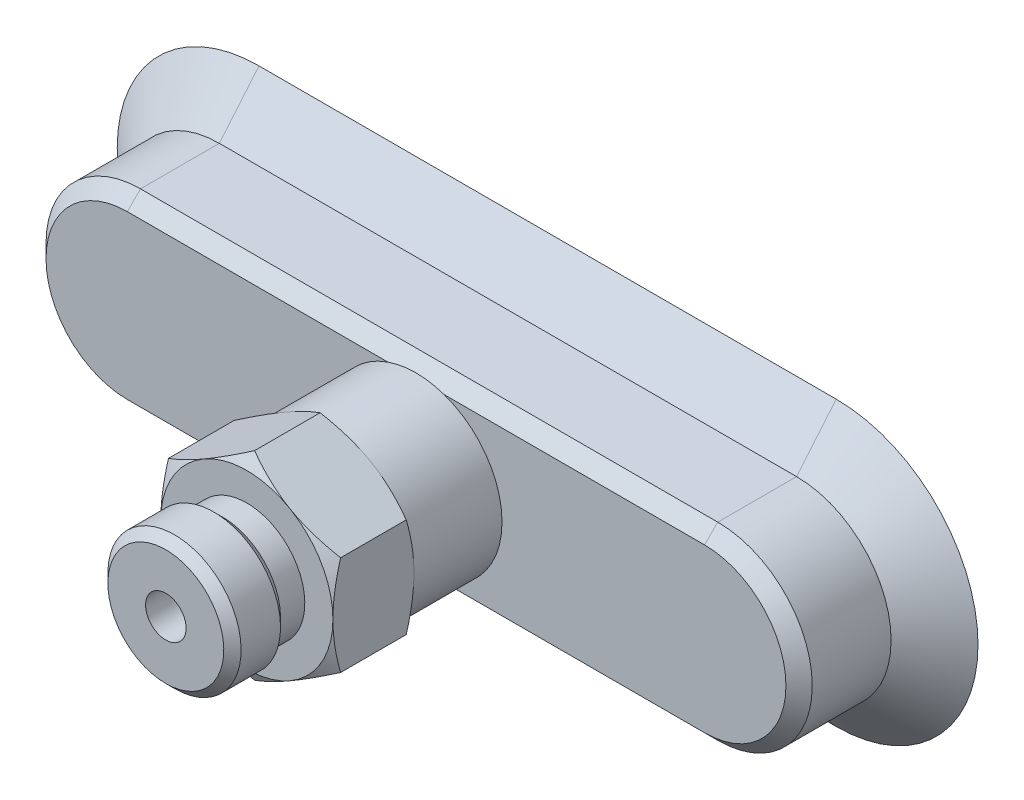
ISO-10303-21;
HEADER;
FILE_DESCRIPTION(('STEP AP214'),'2;1');
FILE_NAME('part.step','',(''),(''),'','','');
FILE_SCHEMA(('AUTOMOTIVE_DESIGN { 1 0 10303 214 1 1 1 1 }'));
ENDSEC;
DATA;
#1=APPLICATION_CONTEXT('core data for automotive mechanical design processes');
#2=APPLICATION_PROTOCOL_DEFINITION('international standard','automotive_design',2000,#1);
#3=PRODUCT_CONTEXT('',#1,'mechanical');
#4=PRODUCT('Part','Part','',(#3));
#5=PRODUCT_RELATED_PRODUCT_CATEGORY('part','',(#4));
#6=PRODUCT_DEFINITION_FORMATION('','',#4);
#7=PRODUCT_DEFINITION_CONTEXT('part definition',#1,'design');
#8=PRODUCT_DEFINITION('design','',#6,#7);
#9=PRODUCT_DEFINITION_SHAPE('','',#8);
#10=(LENGTH_UNIT() NAMED_UNIT(*) SI_UNIT(.MILLI.,.METRE.));
#11=(NAMED_UNIT(*) PLANE_ANGLE_UNIT() SI_UNIT($,.RADIAN.));
#12=(NAMED_UNIT(*) SI_UNIT($,.STERADIAN.) SOLID_ANGLE_UNIT());
#13=UNCERTAINTY_MEASURE_WITH_UNIT(LENGTH_MEASURE(1.E-05),#10,'distance_accuracy_value','');
#14=(GEOMETRIC_REPRESENTATION_CONTEXT(3) GLOBAL_UNCERTAINTY_ASSIGNED_CONTEXT((#13)) GLOBAL_UNIT_ASSIGNED_CONTEXT((#10,
#11,#12)) REPRESENTATION_CONTEXT('',''));
#15=CARTESIAN_POINT('',(0.,0.,0.));
#16=DIRECTION('',(0.,0.,1.));
#17=DIRECTION('',(1.,0.,0.));
#18=AXIS2_PLACEMENT_3D('',#15,#16,#17);
#19=CARTESIAN_POINT('',(26.725,2.79999999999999,1.21428571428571));
#20=DIRECTION('',(0.,1.,0.));
#21=DIRECTION('',(-1.,0.,0.));
#22=AXIS2_PLACEMENT_3D('',#19,#20,#21);
#23=PLANE('',#22);
#24=DIRECTION('',(-1.,0.,0.));
#25=VECTOR('',#24,1.);
#26=CARTESIAN_POINT('',(26.725,2.79999999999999,1.21428571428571));
#27=LINE('',#26,#25);
#28=CARTESIAN_POINT('',(-8.9,2.8,1.21428571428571));
#29=VERTEX_POINT('',#28);
#30=CARTESIAN_POINT('',(-13.9,2.8,1.21428571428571));
#31=VERTEX_POINT('',#30);
#32=EDGE_CURVE('E851',#29,#31,#27,.T.);
#33=ORIENTED_EDGE('',*,*,#32,.T.);
#34=DIRECTION('',(0.,0.,1.));
#35=VECTOR('',#34,1.);
#36=CARTESIAN_POINT('',(-13.9,2.8,1.21428571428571));
#37=LINE('',#36,#35);
#38=CARTESIAN_POINT('',(-13.9,2.8,3.71428571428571));
#39=VERTEX_POINT('',#38);
#40=EDGE_CURVE('E1127',#31,#39,#37,.T.);
#41=ORIENTED_EDGE('',*,*,#40,.T.);
#42=DIRECTION('',(-1.,0.,0.));
#43=VECTOR('',#42,1.);
#44=CARTESIAN_POINT('',(26.725,2.79999999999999,3.71428571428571));
#45=LINE('',#44,#43);
#46=CARTESIAN_POINT('',(-8.9,2.8,3.71428571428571));
#47=VERTEX_POINT('',#46);
#48=EDGE_CURVE('E1317',#47,#39,#45,.T.);
#49=ORIENTED_EDGE('',*,*,#48,.F.);
#50=DIRECTION('',(0.,0.,1.));
#51=VECTOR('',#50,1.);
#52=CARTESIAN_POINT('',(-8.9,2.8,1.21428571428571));
#53=LINE('',#52,#51);
#54=EDGE_CURVE('E853',#29,#47,#53,.T.);
#55=ORIENTED_EDGE('',*,*,#54,.F.);
#56=EDGE_LOOP('',(#33,#41,#49,#55));
#57=FACE_BOUND('',#56,.T.);
#58=ADVANCED_FACE('F15',(#57),#23,.T.);
#59=CARTESIAN_POINT('',(26.7365931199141,3.91999999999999,1.21428571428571));
#60=DIRECTION('',(0.,1.,0.));
#61=DIRECTION('',(-1.,0.,0.));
#62=AXIS2_PLACEMENT_3D('',#59,#60,#61);
#63=PLANE('',#62);
#64=DIRECTION('',(0.,0.,-1.));
#65=VECTOR('',#64,1.);
#66=CARTESIAN_POINT('',(-13.635083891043,3.92,1.21428571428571));
#67=LINE('',#66,#65);
#68=CARTESIAN_POINT('',(-13.635083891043,3.92,3.71428571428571));
#69=VERTEX_POINT('',#68);
#70=CARTESIAN_POINT('',(-13.635083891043,3.92,1.21428571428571));
#71=VERTEX_POINT('',#70);
#72=EDGE_CURVE('E1028',#69,#71,#67,.T.);
#73=ORIENTED_EDGE('',*,*,#72,.T.);
#74=DIRECTION('',(-1.,0.,0.));
#75=VECTOR('',#74,1.);
#76=CARTESIAN_POINT('',(26.7365931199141,3.91999999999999,1.21428571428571));
#77=LINE('',#76,#75);
#78=CARTESIAN_POINT('',(-9.16491610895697,3.92,1.21428571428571));
#79=VERTEX_POINT('',#78);
#80=EDGE_CURVE('E1095',#79,#71,#77,.T.);
#81=ORIENTED_EDGE('',*,*,#80,.F.);
#82=DIRECTION('',(0.,0.,1.));
#83=VECTOR('',#82,1.);
#84=CARTESIAN_POINT('',(-9.16491610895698,3.92,1.21428571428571));
#85=LINE('',#84,#83);
#86=CARTESIAN_POINT('',(-9.16491610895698,3.92,3.71428571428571));
#87=VERTEX_POINT('',#86);
#88=EDGE_CURVE('E1024',#79,#87,#85,.T.);
#89=ORIENTED_EDGE('',*,*,#88,.T.);
#90=DIRECTION('',(-1.,0.,0.));
#91=VECTOR('',#90,1.);
#92=CARTESIAN_POINT('',(26.7365931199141,3.91999999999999,3.71428571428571));
#93=LINE('',#92,#91);
#94=EDGE_CURVE('E828',#87,#69,#93,.T.);
#95=ORIENTED_EDGE('',*,*,#94,.T.);
#96=EDGE_LOOP('',(#73,#81,#89,#95));
#97=FACE_BOUND('',#96,.T.);
#98=ADVANCED_FACE('F2697',(#97),#63,.F.);
#99=CARTESIAN_POINT('',(-26.725,-2.79999999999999,1.21428571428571));
#100=DIRECTION('',(0.,-1.,0.));
#101=DIRECTION('',(0.,0.,-1.));
#102=AXIS2_PLACEMENT_3D('',#99,#100,#101);
#103=PLANE('',#102);
#104=DIRECTION('',(1.,0.,0.));
#105=VECTOR('',#104,1.);
#106=CARTESIAN_POINT('',(-26.725,-2.79999999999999,3.71428571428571));
#107=LINE('',#106,#105);
#108=CARTESIAN_POINT('',(-13.9,-2.8,3.71428571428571));
#109=VERTEX_POINT('',#108);
#110=CARTESIAN_POINT('',(-8.9,-2.8,3.71428571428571));
#111=VERTEX_POINT('',#110);
#112=EDGE_CURVE('E1402',#109,#111,#107,.T.);
#113=ORIENTED_EDGE('',*,*,#112,.F.);
#114=DIRECTION('',(0.,0.,1.));
#115=VECTOR('',#114,1.);
#116=CARTESIAN_POINT('',(-13.9,-2.8,1.21428571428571));
#117=LINE('',#116,#115);
#118=CARTESIAN_POINT('',(-13.9,-2.8,1.21428571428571));
#119=VERTEX_POINT('',#118);
#120=EDGE_CURVE('E852',#119,#109,#117,.T.);
#121=ORIENTED_EDGE('',*,*,#120,.F.);
#122=DIRECTION('',(1.,0.,0.));
#123=VECTOR('',#122,1.);
#124=CARTESIAN_POINT('',(-26.725,-2.79999999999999,1.21428571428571));
#125=LINE('',#124,#123);
#126=CARTESIAN_POINT('',(-8.9,-2.8,1.21428571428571));
#127=VERTEX_POINT('',#126);
#128=EDGE_CURVE('E1158',#119,#127,#125,.T.);
#129=ORIENTED_EDGE('',*,*,#128,.T.);
#130=DIRECTION('',(0.,0.,1.));
#131=VECTOR('',#130,1.);
#132=CARTESIAN_POINT('',(-8.9,-2.8,1.21428571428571));
#133=LINE('',#132,#131);
#134=EDGE_CURVE('E1191',#127,#111,#133,.T.);
#135=ORIENTED_EDGE('',*,*,#134,.T.);
#136=EDGE_LOOP('',(#113,#121,#129,#135));
#137=FACE_BOUND('',#136,.T.);
#138=ADVANCED_FACE('F2800',(#137),#103,.T.);
#139=CARTESIAN_POINT('',(-26.7365931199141,-3.91999999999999,1.21428571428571));
#140=DIRECTION('',(0.,-1.,0.));
#141=DIRECTION('',(0.,0.,-1.));
#142=AXIS2_PLACEMENT_3D('',#139,#140,#141);
#143=PLANE('',#142);
#144=DIRECTION('',(0.,0.,-1.));
#145=VECTOR('',#144,1.);
#146=CARTESIAN_POINT('',(-9.16491610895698,-3.92,1.21428571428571));
#147=LINE('',#146,#145);
#148=CARTESIAN_POINT('',(-9.16491610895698,-3.92,3.71428571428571));
#149=VERTEX_POINT('',#148);
#150=CARTESIAN_POINT('',(-9.16491610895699,-3.92,1.21428571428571));
#151=VERTEX_POINT('',#150);
#152=EDGE_CURVE('E1096',#149,#151,#147,.T.);
#153=ORIENTED_EDGE('',*,*,#152,.T.);
#154=DIRECTION('',(1.,0.,0.));
#155=VECTOR('',#154,1.);
#156=CARTESIAN_POINT('',(-26.7365931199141,-3.91999999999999,1.21428571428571));
#157=LINE('',#156,#155);
#158=CARTESIAN_POINT('',(-13.635083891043,-3.92,1.21428571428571));
#159=VERTEX_POINT('',#158);
#160=EDGE_CURVE('E1323',#159,#151,#157,.T.);
#161=ORIENTED_EDGE('',*,*,#160,.F.);
#162=DIRECTION('',(0.,0.,1.));
#163=VECTOR('',#162,1.);
#164=CARTESIAN_POINT('',(-13.635083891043,-3.92,1.21428571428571));
#165=LINE('',#164,#163);
#166=CARTESIAN_POINT('',(-13.635083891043,-3.92,3.71428571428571));
#167=VERTEX_POINT('',#166);
#168=EDGE_CURVE('E1092',#159,#167,#165,.T.);
#169=ORIENTED_EDGE('',*,*,#168,.T.);
#170=DIRECTION('',(1.,0.,0.));
#171=VECTOR('',#170,1.);
#172=CARTESIAN_POINT('',(-26.7365931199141,-3.91999999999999,3.71428571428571));
#173=LINE('',#172,#171);
#174=EDGE_CURVE('E1051',#167,#149,#173,.T.);
#175=ORIENTED_EDGE('',*,*,#174,.T.);
#176=EDGE_LOOP('',(#153,#161,#169,#175));
#177=FACE_BOUND('',#176,.T.);
#178=ADVANCED_FACE('F4465',(#177),#143,.F.);
#179=CARTESIAN_POINT('',(-26.725,1.68000000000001,1.21428571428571));
#180=DIRECTION('',(0.,-1.,0.));
#181=DIRECTION('',(0.,0.,-1.));
#182=AXIS2_PLACEMENT_3D('',#179,#180,#181);
#183=PLANE('',#182);
#184=DIRECTION('',(1.,0.,0.));
#185=VECTOR('',#184,1.);
#186=CARTESIAN_POINT('',(-26.725,1.68000000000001,3.71428571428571));
#187=LINE('',#186,#185);
#188=CARTESIAN_POINT('',(-13.9,1.68,3.71428571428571));
#189=VERTEX_POINT('',#188);
#190=CARTESIAN_POINT('',(-8.9,1.68,3.71428571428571));
#191=VERTEX_POINT('',#190);
#192=EDGE_CURVE('E1367',#189,#191,#187,.T.);
#193=ORIENTED_EDGE('',*,*,#192,.F.);
#194=DIRECTION('',(0.,0.,1.));
#195=VECTOR('',#194,1.);
#196=CARTESIAN_POINT('',(-13.9,1.68,1.21428571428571));
#197=LINE('',#196,#195);
#198=CARTESIAN_POINT('',(-13.9,1.68,1.21428571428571));
#199=VERTEX_POINT('',#198);
#200=EDGE_CURVE('E836',#199,#189,#197,.T.);
#201=ORIENTED_EDGE('',*,*,#200,.F.);
#202=DIRECTION('',(1.,0.,0.));
#203=VECTOR('',#202,1.);
#204=CARTESIAN_POINT('',(-26.725,1.68000000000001,1.21428571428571));
#205=LINE('',#204,#203);
#206=CARTESIAN_POINT('',(-8.9,1.68,1.21428571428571));
#207=VERTEX_POINT('',#206);
#208=EDGE_CURVE('E847',#199,#207,#205,.T.);
#209=ORIENTED_EDGE('',*,*,#208,.T.);
#210=DIRECTION('',(0.,0.,-1.));
#211=VECTOR('',#210,1.);
#212=CARTESIAN_POINT('',(-8.9,1.68,1.21428571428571));
#213=LINE('',#212,#211);
#214=EDGE_CURVE('E950',#191,#207,#213,.T.);
#215=ORIENTED_EDGE('',*,*,#214,.F.);
#216=EDGE_LOOP('',(#193,#201,#209,#215));
#217=FACE_BOUND('',#216,.T.);
#218=ADVANCED_FACE('F1762',(#217),#183,.T.);
#219=CARTESIAN_POINT('',(26.725,0.559999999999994,1.21428571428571));
#220=DIRECTION('',(0.,1.,0.));
#221=DIRECTION('',(-1.,0.,0.));
#222=AXIS2_PLACEMENT_3D('',#219,#220,#221);
#223=PLANE('',#222);
#224=DIRECTION('',(-1.,0.,0.));
#225=VECTOR('',#224,1.);
#226=CARTESIAN_POINT('',(26.725,0.559999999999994,1.21428571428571));
#227=LINE('',#226,#225);
#228=CARTESIAN_POINT('',(-8.9,0.560000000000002,1.21428571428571));
#229=VERTEX_POINT('',#228);
#230=CARTESIAN_POINT('',(-13.9,0.560000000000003,1.21428571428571));
#231=VERTEX_POINT('',#230);
#232=EDGE_CURVE('E1015',#229,#231,#227,.T.);
#233=ORIENTED_EDGE('',*,*,#232,.T.);
#234=DIRECTION('',(0.,0.,-1.));
#235=VECTOR('',#234,1.);
#236=CARTESIAN_POINT('',(-13.9,0.560000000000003,1.21428571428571));
#237=LINE('',#236,#235);
#238=CARTESIAN_POINT('',(-13.9,0.560000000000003,3.71428571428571));
#239=VERTEX_POINT('',#238);
#240=EDGE_CURVE('E1074',#239,#231,#237,.T.);
#241=ORIENTED_EDGE('',*,*,#240,.F.);
#242=DIRECTION('',(-1.,0.,0.));
#243=VECTOR('',#242,1.);
#244=CARTESIAN_POINT('',(26.725,0.559999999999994,3.71428571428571));
#245=LINE('',#244,#243);
#246=CARTESIAN_POINT('',(-8.9,0.560000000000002,3.71428571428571));
#247=VERTEX_POINT('',#246);
#248=EDGE_CURVE('E1255',#247,#239,#245,.T.);
#249=ORIENTED_EDGE('',*,*,#248,.F.);
#250=DIRECTION('',(0.,0.,1.));
#251=VECTOR('',#250,1.);
#252=CARTESIAN_POINT('',(-8.9,0.560000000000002,1.21428571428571));
#253=LINE('',#252,#251);
#254=EDGE_CURVE('E927',#229,#247,#253,.T.);
#255=ORIENTED_EDGE('',*,*,#254,.F.);
#256=EDGE_LOOP('',(#233,#241,#249,#255));
#257=FACE_BOUND('',#256,.T.);
#258=ADVANCED_FACE('F2856',(#257),#223,.T.);
#259=CARTESIAN_POINT('',(-26.725,-0.559999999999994,1.21428571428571));
#260=DIRECTION('',(0.,-1.,0.));
#261=DIRECTION('',(0.,0.,-1.));
#262=AXIS2_PLACEMENT_3D('',#259,#260,#261);
#263=PLANE('',#262);
#264=DIRECTION('',(1.,0.,0.));
#265=VECTOR('',#264,1.);
#266=CARTESIAN_POINT('',(-26.725,-0.559999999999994,3.71428571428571));
#267=LINE('',#266,#265);
#268=CARTESIAN_POINT('',(-13.9,-0.559999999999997,3.71428571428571));
#269=VERTEX_POINT('',#268);
#270=CARTESIAN_POINT('',(-8.9,-0.559999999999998,3.71428571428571));
#271=VERTEX_POINT('',#270);
#272=EDGE_CURVE('E969',#269,#271,#267,.T.);
#273=ORIENTED_EDGE('',*,*,#272,.F.);
#274=DIRECTION('',(0.,0.,1.));
#275=VECTOR('',#274,1.);
#276=CARTESIAN_POINT('',(-13.9,-0.559999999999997,1.21428571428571));
#277=LINE('',#276,#275);
#278=CARTESIAN_POINT('',(-13.9,-0.559999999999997,1.21428571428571));
#279=VERTEX_POINT('',#278);
#280=EDGE_CURVE('E1075',#279,#269,#277,.T.);
#281=ORIENTED_EDGE('',*,*,#280,.F.);
#282=DIRECTION('',(1.,0.,0.));
#283=VECTOR('',#282,1.);
#284=CARTESIAN_POINT('',(-26.725,-0.559999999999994,1.21428571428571));
#285=LINE('',#284,#283);
#286=CARTESIAN_POINT('',(-8.9,-0.559999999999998,1.21428571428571));
#287=VERTEX_POINT('',#286);
#288=EDGE_CURVE('E1019',#279,#287,#285,.T.);
#289=ORIENTED_EDGE('',*,*,#288,.T.);
#290=DIRECTION('',(0.,0.,-1.));
#291=VECTOR('',#290,1.);
#292=CARTESIAN_POINT('',(-8.9,-0.559999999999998,1.21428571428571));
#293=LINE('',#292,#291);
#294=EDGE_CURVE('E928',#271,#287,#293,.T.);
#295=ORIENTED_EDGE('',*,*,#294,.F.);
#296=EDGE_LOOP('',(#273,#281,#289,#295));
#297=FACE_BOUND('',#296,.T.);
#298=ADVANCED_FACE('F2859',(#297),#263,.T.);
#299=CARTESIAN_POINT('',(26.725,-1.68000000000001,1.21428571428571));
#300=DIRECTION('',(0.,1.,0.));
#301=DIRECTION('',(-1.,0.,0.));
#302=AXIS2_PLACEMENT_3D('',#299,#300,#301);
#303=PLANE('',#302);
#304=DIRECTION('',(-1.,0.,0.));
#305=VECTOR('',#304,1.);
#306=CARTESIAN_POINT('',(26.725,-1.68000000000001,1.21428571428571));
#307=LINE('',#306,#305);
#308=CARTESIAN_POINT('',(-8.9,-1.68,1.21428571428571));
#309=VERTEX_POINT('',#308);
#310=CARTESIAN_POINT('',(-13.9,-1.68,1.21428571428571));
#311=VERTEX_POINT('',#310);
#312=EDGE_CURVE('E1154',#309,#311,#307,.T.);
#313=ORIENTED_EDGE('',*,*,#312,.T.);
#314=DIRECTION('',(0.,0.,-1.));
#315=VECTOR('',#314,1.);
#316=CARTESIAN_POINT('',(-13.9,-1.68,1.21428571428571));
#317=LINE('',#316,#315);
#318=CARTESIAN_POINT('',(-13.9,-1.68,3.71428571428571));
#319=VERTEX_POINT('',#318);
#320=EDGE_CURVE('E1105',#319,#311,#317,.T.);
#321=ORIENTED_EDGE('',*,*,#320,.F.);
#322=DIRECTION('',(-1.,0.,0.));
#323=VECTOR('',#322,1.);
#324=CARTESIAN_POINT('',(26.725,-1.68000000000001,3.71428571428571));
#325=LINE('',#324,#323);
#326=CARTESIAN_POINT('',(-8.9,-1.68,3.71428571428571));
#327=VERTEX_POINT('',#326);
#328=EDGE_CURVE('E1344',#327,#319,#325,.T.);
#329=ORIENTED_EDGE('',*,*,#328,.F.);
#330=DIRECTION('',(0.,0.,1.));
#331=VECTOR('',#330,1.);
#332=CARTESIAN_POINT('',(-8.9,-1.68,1.21428571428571));
#333=LINE('',#332,#331);
#334=EDGE_CURVE('E975',#309,#327,#333,.T.);
#335=ORIENTED_EDGE('',*,*,#334,.F.);
#336=EDGE_LOOP('',(#313,#321,#329,#335));
#337=FACE_BOUND('',#336,.T.);
#338=ADVANCED_FACE('F4426',(#337),#303,.T.);
#339=CARTESIAN_POINT('',(26.7365931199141,3.91999999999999,1.21428571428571));
#340=DIRECTION('',(0.,1.,0.));
#341=DIRECTION('',(-1.,0.,0.));
#342=AXIS2_PLACEMENT_3D('',#339,#340,#341);
#343=PLANE('',#342);
#344=DIRECTION('',(0.,0.,-1.));
#345=VECTOR('',#344,1.);
#346=CARTESIAN_POINT('',(-26.460083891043,3.92000000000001,1.21428571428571));
#347=LINE('',#346,#345);
#348=CARTESIAN_POINT('',(-26.460083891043,3.92000000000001,3.71428571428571));
#349=VERTEX_POINT('',#348);
#350=CARTESIAN_POINT('',(-26.460083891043,3.92000000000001,1.21428571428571));
#351=VERTEX_POINT('',#350);
#352=EDGE_CURVE('E1362',#349,#351,#347,.T.);
#353=ORIENTED_EDGE('',*,*,#352,.T.);
#354=DIRECTION('',(-1.,0.,0.));
#355=VECTOR('',#354,1.);
#356=CARTESIAN_POINT('',(26.7365931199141,3.91999999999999,1.21428571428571));
#357=LINE('',#356,#355);
#358=CARTESIAN_POINT('',(-21.989916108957,3.92000000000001,1.21428571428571));
#359=VERTEX_POINT('',#358);
#360=EDGE_CURVE('E1318',#359,#351,#357,.T.);
#361=ORIENTED_EDGE('',*,*,#360,.F.);
#362=DIRECTION('',(0.,0.,1.));
#363=VECTOR('',#362,1.);
#364=CARTESIAN_POINT('',(-21.989916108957,3.92000000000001,1.21428571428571));
#365=LINE('',#364,#363);
#366=CARTESIAN_POINT('',(-21.989916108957,3.92000000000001,3.71428571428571));
#367=VERTEX_POINT('',#366);
#368=EDGE_CURVE('E1153',#359,#367,#365,.T.);
#369=ORIENTED_EDGE('',*,*,#368,.T.);
#370=DIRECTION('',(-1.,0.,0.));
#371=VECTOR('',#370,1.);
#372=CARTESIAN_POINT('',(26.7365931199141,3.91999999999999,3.71428571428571));
#373=LINE('',#372,#371);
#374=EDGE_CURVE('E1203',#367,#349,#373,.T.);
#375=ORIENTED_EDGE('',*,*,#374,.T.);
#376=EDGE_LOOP('',(#353,#361,#369,#375));
#377=FACE_BOUND('',#376,.T.);
#378=ADVANCED_FACE('F2855',(#377),#343,.F.);
#379=CARTESIAN_POINT('',(26.725,2.79999999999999,1.21428571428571));
#380=DIRECTION('',(0.,1.,0.));
#381=DIRECTION('',(-1.,0.,0.));
#382=AXIS2_PLACEMENT_3D('',#379,#380,#381);
#383=PLANE('',#382);
#384=DIRECTION('',(-1.,0.,0.));
#385=VECTOR('',#384,1.);
#386=CARTESIAN_POINT('',(26.725,2.79999999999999,1.21428571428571));
#387=LINE('',#386,#385);
#388=CARTESIAN_POINT('',(-21.725,2.80000000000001,1.21428571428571));
#389=VERTEX_POINT('',#388);
#390=CARTESIAN_POINT('',(-26.725,2.80000000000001,1.21428571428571));
#391=VERTEX_POINT('',#390);
#392=EDGE_CURVE('E910',#389,#391,#387,.T.);
#393=ORIENTED_EDGE('',*,*,#392,.T.);
#394=DIRECTION('',(0.,0.,1.));
#395=VECTOR('',#394,1.);
#396=CARTESIAN_POINT('',(-26.725,2.80000000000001,1.21428571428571));
#397=LINE('',#396,#395);
#398=CARTESIAN_POINT('',(-26.725,2.80000000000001,3.71428571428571));
#399=VERTEX_POINT('',#398);
#400=EDGE_CURVE('E1196',#391,#399,#397,.T.);
#401=ORIENTED_EDGE('',*,*,#400,.T.);
#402=DIRECTION('',(-1.,0.,0.));
#403=VECTOR('',#402,1.);
#404=CARTESIAN_POINT('',(26.725,2.79999999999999,3.71428571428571));
#405=LINE('',#404,#403);
#406=CARTESIAN_POINT('',(-21.725,2.80000000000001,3.71428571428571));
#407=VERTEX_POINT('',#406);
#408=EDGE_CURVE('E1408',#407,#399,#405,.T.);
#409=ORIENTED_EDGE('',*,*,#408,.F.);
#410=DIRECTION('',(0.,0.,1.));
#411=VECTOR('',#410,1.);
#412=CARTESIAN_POINT('',(-21.725,2.80000000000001,1.21428571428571));
#413=LINE('',#412,#411);
#414=EDGE_CURVE('E1245',#389,#407,#413,.T.);
#415=ORIENTED_EDGE('',*,*,#414,.F.);
#416=EDGE_LOOP('',(#393,#401,#409,#415));
#417=FACE_BOUND('',#416,.T.);
#418=ADVANCED_FACE('F2721',(#417),#383,.T.);
#419=CARTESIAN_POINT('',(-26.725,-2.79999999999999,1.21428571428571));
#420=DIRECTION('',(0.,-1.,0.));
#421=DIRECTION('',(0.,0.,-1.));
#422=AXIS2_PLACEMENT_3D('',#419,#420,#421);
#423=PLANE('',#422);
#424=DIRECTION('',(1.,0.,0.));
#425=VECTOR('',#424,1.);
#426=CARTESIAN_POINT('',(-26.725,-2.79999999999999,3.71428571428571));
#427=LINE('',#426,#425);
#428=CARTESIAN_POINT('',(-26.725,-2.79999999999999,3.71428571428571));
#429=VERTEX_POINT('',#428);
#430=CARTESIAN_POINT('',(-21.725,-2.8,3.71428571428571));
#431=VERTEX_POINT('',#430);
#432=EDGE_CURVE('E1087',#429,#431,#427,.T.);
#433=ORIENTED_EDGE('',*,*,#432,.F.);
#434=DIRECTION('',(0.,0.,1.));
#435=VECTOR('',#434,1.);
#436=CARTESIAN_POINT('',(-26.725,-2.79999999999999,1.21428571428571));
#437=LINE('',#436,#435);
#438=CARTESIAN_POINT('',(-26.725,-2.79999999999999,1.21428571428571));
#439=VERTEX_POINT('',#438);
#440=EDGE_CURVE('E1348',#439,#429,#437,.T.);
#441=ORIENTED_EDGE('',*,*,#440,.F.);
#442=DIRECTION('',(1.,0.,0.));
#443=VECTOR('',#442,1.);
#444=CARTESIAN_POINT('',(-26.725,-2.79999999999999,1.21428571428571));
#445=LINE('',#444,#443);
#446=CARTESIAN_POINT('',(-21.725,-2.8,1.21428571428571));
#447=VERTEX_POINT('',#446);
#448=EDGE_CURVE('E906',#439,#447,#445,.T.);
#449=ORIENTED_EDGE('',*,*,#448,.T.);
#450=DIRECTION('',(0.,0.,1.));
#451=VECTOR('',#450,1.);
#452=CARTESIAN_POINT('',(-21.725,-2.8,1.21428571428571));
#453=LINE('',#452,#451);
#454=EDGE_CURVE('E1272',#447,#431,#453,.T.);
#455=ORIENTED_EDGE('',*,*,#454,.T.);
#456=EDGE_LOOP('',(#433,#441,#449,#455));
#457=FACE_BOUND('',#456,.T.);
#458=ADVANCED_FACE('F2854',(#457),#423,.T.);
#459=CARTESIAN_POINT('',(-26.7365931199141,-3.91999999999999,1.21428571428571));
#460=DIRECTION('',(0.,-1.,0.));
#461=DIRECTION('',(0.,0.,-1.));
#462=AXIS2_PLACEMENT_3D('',#459,#460,#461);
#463=PLANE('',#462);
#464=DIRECTION('',(0.,0.,-1.));
#465=VECTOR('',#464,1.);
#466=CARTESIAN_POINT('',(-21.989916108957,-3.92,1.21428571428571));
#467=LINE('',#466,#465);
#468=CARTESIAN_POINT('',(-21.989916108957,-3.92,3.71428571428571));
#469=VERTEX_POINT('',#468);
#470=CARTESIAN_POINT('',(-21.989916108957,-3.92,1.21428571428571));
#471=VERTEX_POINT('',#470);
#472=EDGE_CURVE('E1152',#469,#471,#467,.T.);
#473=ORIENTED_EDGE('',*,*,#472,.T.);
#474=DIRECTION('',(1.,0.,0.));
#475=VECTOR('',#474,1.);
#476=CARTESIAN_POINT('',(-26.7365931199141,-3.91999999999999,1.21428571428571));
#477=LINE('',#476,#475);
#478=CARTESIAN_POINT('',(-26.460083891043,-3.91999999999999,1.21428571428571));
#479=VERTEX_POINT('',#478);
#480=EDGE_CURVE('E921',#479,#471,#477,.T.);
#481=ORIENTED_EDGE('',*,*,#480,.F.);
#482=DIRECTION('',(0.,0.,1.));
#483=VECTOR('',#482,1.);
#484=CARTESIAN_POINT('',(-26.460083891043,-3.91999999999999,1.21428571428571));
#485=LINE('',#484,#483);
#486=CARTESIAN_POINT('',(-26.460083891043,-3.91999999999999,3.71428571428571));
#487=VERTEX_POINT('',#486);
#488=EDGE_CURVE('E1226',#479,#487,#485,.T.);
#489=ORIENTED_EDGE('',*,*,#488,.T.);
#490=DIRECTION('',(1.,0.,0.));
#491=VECTOR('',#490,1.);
#492=CARTESIAN_POINT('',(-26.7365931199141,-3.91999999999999,3.71428571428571));
#493=LINE('',#492,#491);
#494=EDGE_CURVE('E1039',#487,#469,#493,.T.);
#495=ORIENTED_EDGE('',*,*,#494,.T.);
#496=EDGE_LOOP('',(#473,#481,#489,#495));
#497=FACE_BOUND('',#496,.T.);
#498=ADVANCED_FACE('F2825',(#497),#463,.F.);
#499=CARTESIAN_POINT('',(-26.725,1.68000000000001,1.21428571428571));
#500=DIRECTION('',(0.,-1.,0.));
#501=DIRECTION('',(0.,0.,-1.));
#502=AXIS2_PLACEMENT_3D('',#499,#500,#501);
#503=PLANE('',#502);
#504=DIRECTION('',(1.,0.,0.));
#505=VECTOR('',#504,1.);
#506=CARTESIAN_POINT('',(-26.725,1.68000000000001,3.71428571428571));
#507=LINE('',#506,#505);
#508=CARTESIAN_POINT('',(-26.725,1.68000000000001,3.71428571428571));
#509=VERTEX_POINT('',#508);
#510=CARTESIAN_POINT('',(-21.725,1.68000000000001,3.71428571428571));
#511=VERTEX_POINT('',#510);
#512=EDGE_CURVE('E1405',#509,#511,#507,.T.);
#513=ORIENTED_EDGE('',*,*,#512,.F.);
#514=DIRECTION('',(0.,0.,1.));
#515=VECTOR('',#514,1.);
#516=CARTESIAN_POINT('',(-26.725,1.68000000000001,1.21428571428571));
#517=LINE('',#516,#515);
#518=CARTESIAN_POINT('',(-26.725,1.68000000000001,1.21428571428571));
#519=VERTEX_POINT('',#518);
#520=EDGE_CURVE('E1271',#519,#509,#517,.T.);
#521=ORIENTED_EDGE('',*,*,#520,.F.);
#522=DIRECTION('',(1.,0.,0.));
#523=VECTOR('',#522,1.);
#524=CARTESIAN_POINT('',(-26.725,1.68000000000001,1.21428571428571));
#525=LINE('',#524,#523);
#526=CARTESIAN_POINT('',(-21.725,1.68000000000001,1.21428571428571));
#527=VERTEX_POINT('',#526);
#528=EDGE_CURVE('E1345',#519,#527,#525,.T.);
#529=ORIENTED_EDGE('',*,*,#528,.T.);
#530=DIRECTION('',(0.,0.,-1.));
#531=VECTOR('',#530,1.);
#532=CARTESIAN_POINT('',(-21.725,1.68000000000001,1.21428571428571));
#533=LINE('',#532,#531);
#534=EDGE_CURVE('E1392',#511,#527,#533,.T.);
#535=ORIENTED_EDGE('',*,*,#534,.F.);
#536=EDGE_LOOP('',(#513,#521,#529,#535));
#537=FACE_BOUND('',#536,.T.);
#538=ADVANCED_FACE('F2725',(#537),#503,.T.);
#539=CARTESIAN_POINT('',(26.725,0.559999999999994,1.21428571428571));
#540=DIRECTION('',(0.,1.,0.));
#541=DIRECTION('',(-1.,0.,0.));
#542=AXIS2_PLACEMENT_3D('',#539,#540,#541);
#543=PLANE('',#542);
#544=DIRECTION('',(-1.,0.,0.));
#545=VECTOR('',#544,1.);
#546=CARTESIAN_POINT('',(26.725,0.559999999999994,1.21428571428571));
#547=LINE('',#546,#545);
#548=CARTESIAN_POINT('',(-21.725,0.560000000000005,1.21428571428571));
#549=VERTEX_POINT('',#548);
#550=CARTESIAN_POINT('',(-26.725,0.560000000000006,1.21428571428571));
#551=VERTEX_POINT('',#550);
#552=EDGE_CURVE('E922',#549,#551,#547,.T.);
#553=ORIENTED_EDGE('',*,*,#552,.T.);
#554=DIRECTION('',(0.,0.,1.));
#555=VECTOR('',#554,1.);
#556=CARTESIAN_POINT('',(-26.725,0.560000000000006,1.21428571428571));
#557=LINE('',#556,#555);
#558=CARTESIAN_POINT('',(-26.725,0.560000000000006,3.71428571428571));
#559=VERTEX_POINT('',#558);
#560=EDGE_CURVE('E980',#551,#559,#557,.T.);
#561=ORIENTED_EDGE('',*,*,#560,.T.);
#562=DIRECTION('',(-1.,0.,0.));
#563=VECTOR('',#562,1.);
#564=CARTESIAN_POINT('',(26.725,0.559999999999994,3.71428571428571));
#565=LINE('',#564,#563);
#566=CARTESIAN_POINT('',(-21.725,0.560000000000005,3.71428571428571));
#567=VERTEX_POINT('',#566);
#568=EDGE_CURVE('E1091',#567,#559,#565,.T.);
#569=ORIENTED_EDGE('',*,*,#568,.F.);
#570=DIRECTION('',(0.,0.,1.));
#571=VECTOR('',#570,1.);
#572=CARTESIAN_POINT('',(-21.725,0.560000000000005,1.21428571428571));
#573=LINE('',#572,#571);
#574=EDGE_CURVE('E1106',#549,#567,#573,.T.);
#575=ORIENTED_EDGE('',*,*,#574,.F.);
#576=EDGE_LOOP('',(#553,#561,#569,#575));
#577=FACE_BOUND('',#576,.T.);
#578=ADVANCED_FACE('F2824',(#577),#543,.T.);
#579=CARTESIAN_POINT('',(-26.725,-0.559999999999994,1.21428571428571));
#580=DIRECTION('',(0.,-1.,0.));
#581=DIRECTION('',(0.,0.,-1.));
#582=AXIS2_PLACEMENT_3D('',#579,#580,#581);
#583=PLANE('',#582);
#584=DIRECTION('',(1.,0.,0.));
#585=VECTOR('',#584,1.);
#586=CARTESIAN_POINT('',(-26.725,-0.559999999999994,3.71428571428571));
#587=LINE('',#586,#585);
#588=CARTESIAN_POINT('',(-26.725,-0.559999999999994,3.71428571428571));
#589=VERTEX_POINT('',#588);
#590=CARTESIAN_POINT('',(-21.725,-0.559999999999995,3.71428571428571));
#591=VERTEX_POINT('',#590);
#592=EDGE_CURVE('E1116',#589,#591,#587,.T.);
#593=ORIENTED_EDGE('',*,*,#592,.F.);
#594=DIRECTION('',(0.,0.,1.));
#595=VECTOR('',#594,1.);
#596=CARTESIAN_POINT('',(-26.725,-0.559999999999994,1.21428571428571));
#597=LINE('',#596,#595);
#598=CARTESIAN_POINT('',(-26.725,-0.559999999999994,1.21428571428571));
#599=VERTEX_POINT('',#598);
#600=EDGE_CURVE('E981',#599,#589,#597,.T.);
#601=ORIENTED_EDGE('',*,*,#600,.F.);
#602=DIRECTION('',(1.,0.,0.));
#603=VECTOR('',#602,1.);
#604=CARTESIAN_POINT('',(-26.725,-0.559999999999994,1.21428571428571));
#605=LINE('',#604,#603);
#606=CARTESIAN_POINT('',(-21.725,-0.559999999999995,1.21428571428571));
#607=VERTEX_POINT('',#606);
#608=EDGE_CURVE('E1123',#599,#607,#605,.T.);
#609=ORIENTED_EDGE('',*,*,#608,.T.);
#610=DIRECTION('',(0.,0.,-1.));
#611=VECTOR('',#610,1.);
#612=CARTESIAN_POINT('',(-21.725,-0.559999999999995,1.21428571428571));
#613=LINE('',#612,#611);
#614=EDGE_CURVE('E1244',#591,#607,#613,.T.);
#615=ORIENTED_EDGE('',*,*,#614,.F.);
#616=EDGE_LOOP('',(#593,#601,#609,#615));
#617=FACE_BOUND('',#616,.T.);
#618=ADVANCED_FACE('F2820',(#617),#583,.T.);
#619=CARTESIAN_POINT('',(26.725,-1.68000000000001,1.21428571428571));
#620=DIRECTION('',(0.,1.,0.));
#621=DIRECTION('',(-1.,0.,0.));
#622=AXIS2_PLACEMENT_3D('',#619,#620,#621);
#623=PLANE('',#622);
#624=DIRECTION('',(-1.,0.,0.));
#625=VECTOR('',#624,1.);
#626=CARTESIAN_POINT('',(26.725,-1.68000000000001,1.21428571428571));
#627=LINE('',#626,#625);
#628=CARTESIAN_POINT('',(-21.725,-1.68,1.21428571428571));
#629=VERTEX_POINT('',#628);
#630=CARTESIAN_POINT('',(-26.725,-1.67999999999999,1.21428571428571));
#631=VERTEX_POINT('',#630);
#632=EDGE_CURVE('E909',#629,#631,#627,.T.);
#633=ORIENTED_EDGE('',*,*,#632,.T.);
#634=DIRECTION('',(0.,0.,1.));
#635=VECTOR('',#634,1.);
#636=CARTESIAN_POINT('',(-26.725,-1.67999999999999,1.21428571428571));
#637=LINE('',#636,#635);
#638=CARTESIAN_POINT('',(-26.725,-1.67999999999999,3.71428571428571));
#639=VERTEX_POINT('',#638);
#640=EDGE_CURVE('E1481',#631,#639,#637,.T.);
#641=ORIENTED_EDGE('',*,*,#640,.T.);
#642=DIRECTION('',(-1.,0.,0.));
#643=VECTOR('',#642,1.);
#644=CARTESIAN_POINT('',(26.725,-1.68000000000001,3.71428571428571));
#645=LINE('',#644,#643);
#646=CARTESIAN_POINT('',(-21.725,-1.68,3.71428571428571));
#647=VERTEX_POINT('',#646);
#648=EDGE_CURVE('E1090',#647,#639,#645,.T.);
#649=ORIENTED_EDGE('',*,*,#648,.F.);
#650=DIRECTION('',(0.,0.,1.));
#651=VECTOR('',#650,1.);
#652=CARTESIAN_POINT('',(-21.725,-1.68,1.21428571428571));
#653=LINE('',#652,#651);
#654=EDGE_CURVE('E2195',#629,#647,#653,.T.);
#655=ORIENTED_EDGE('',*,*,#654,.F.);
#656=EDGE_LOOP('',(#633,#641,#649,#655));
#657=FACE_BOUND('',#656,.T.);
#658=ADVANCED_FACE('F2811',(#657),#623,.T.);
#659=CARTESIAN_POINT('',(26.7365931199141,3.91999999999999,1.21428571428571));
#660=DIRECTION('',(0.,1.,0.));
#661=DIRECTION('',(-1.,0.,0.));
#662=AXIS2_PLACEMENT_3D('',#659,#660,#661);
#663=PLANE('',#662);
#664=DIRECTION('',(0.,0.,-1.));
#665=VECTOR('',#664,1.);
#666=CARTESIAN_POINT('',(9.16491610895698,3.92,1.21428571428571));
#667=LINE('',#666,#665);
#668=CARTESIAN_POINT('',(9.16491610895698,3.92,3.71428571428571));
#669=VERTEX_POINT('',#668);
#670=CARTESIAN_POINT('',(9.16491610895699,3.92,1.21428571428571));
#671=VERTEX_POINT('',#670);
#672=EDGE_CURVE('E1038',#669,#671,#667,.T.);
#673=ORIENTED_EDGE('',*,*,#672,.T.);
#674=DIRECTION('',(-1.,0.,0.));
#675=VECTOR('',#674,1.);
#676=CARTESIAN_POINT('',(26.7365931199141,3.91999999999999,1.21428571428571));
#677=LINE('',#676,#675);
#678=CARTESIAN_POINT('',(13.635083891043,3.92,1.21428571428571));
#679=VERTEX_POINT('',#678);
#680=EDGE_CURVE('E987',#679,#671,#677,.T.);
#681=ORIENTED_EDGE('',*,*,#680,.F.);
#682=DIRECTION('',(0.,0.,1.));
#683=VECTOR('',#682,1.);
#684=CARTESIAN_POINT('',(13.635083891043,3.92,1.21428571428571));
#685=LINE('',#684,#683);
#686=CARTESIAN_POINT('',(13.635083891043,3.92,3.71428571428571));
#687=VERTEX_POINT('',#686);
#688=EDGE_CURVE('E1034',#679,#687,#685,.T.);
#689=ORIENTED_EDGE('',*,*,#688,.T.);
#690=DIRECTION('',(-1.,0.,0.));
#691=VECTOR('',#690,1.);
#692=CARTESIAN_POINT('',(26.7365931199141,3.91999999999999,3.71428571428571));
#693=LINE('',#692,#691);
#694=EDGE_CURVE('E960',#687,#669,#693,.T.);
#695=ORIENTED_EDGE('',*,*,#694,.T.);
#696=EDGE_LOOP('',(#673,#681,#689,#695));
#697=FACE_BOUND('',#696,.T.);
#698=ADVANCED_FACE('F2808',(#697),#663,.F.);
#699=CARTESIAN_POINT('',(26.725,2.79999999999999,1.21428571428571));
#700=DIRECTION('',(0.,1.,0.));
#701=DIRECTION('',(-1.,0.,0.));
#702=AXIS2_PLACEMENT_3D('',#699,#700,#701);
#703=PLANE('',#702);
#704=DIRECTION('',(-1.,0.,0.));
#705=VECTOR('',#704,1.);
#706=CARTESIAN_POINT('',(26.725,2.79999999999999,1.21428571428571));
#707=LINE('',#706,#705);
#708=CARTESIAN_POINT('',(13.9,2.8,1.21428571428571));
#709=VERTEX_POINT('',#708);
#710=CARTESIAN_POINT('',(8.9,2.8,1.21428571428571));
#711=VERTEX_POINT('',#710);
#712=EDGE_CURVE('E1309',#709,#711,#707,.T.);
#713=ORIENTED_EDGE('',*,*,#712,.T.);
#714=DIRECTION('',(0.,0.,1.));
#715=VECTOR('',#714,1.);
#716=CARTESIAN_POINT('',(8.9,2.8,1.21428571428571));
#717=LINE('',#716,#715);
#718=CARTESIAN_POINT('',(8.9,2.8,3.71428571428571));
#719=VERTEX_POINT('',#718);
#720=EDGE_CURVE('E859',#711,#719,#717,.T.);
#721=ORIENTED_EDGE('',*,*,#720,.T.);
#722=DIRECTION('',(-1.,0.,0.));
#723=VECTOR('',#722,1.);
#724=CARTESIAN_POINT('',(26.725,2.79999999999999,3.71428571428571));
#725=LINE('',#724,#723);
#726=CARTESIAN_POINT('',(13.9,2.8,3.71428571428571));
#727=VERTEX_POINT('',#726);
#728=EDGE_CURVE('E986',#727,#719,#725,.T.);
#729=ORIENTED_EDGE('',*,*,#728,.F.);
#730=DIRECTION('',(0.,0.,1.));
#731=VECTOR('',#730,1.);
#732=CARTESIAN_POINT('',(13.9,2.8,1.21428571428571));
#733=LINE('',#732,#731);
#734=EDGE_CURVE('E935',#709,#727,#733,.T.);
#735=ORIENTED_EDGE('',*,*,#734,.F.);
#736=EDGE_LOOP('',(#713,#721,#729,#735));
#737=FACE_BOUND('',#736,.T.);
#738=ADVANCED_FACE('F2764',(#737),#703,.T.);
#739=CARTESIAN_POINT('',(-26.725,-2.79999999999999,1.21428571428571));
#740=DIRECTION('',(0.,-1.,0.));
#741=DIRECTION('',(0.,0.,-1.));
#742=AXIS2_PLACEMENT_3D('',#739,#740,#741);
#743=PLANE('',#742);
#744=DIRECTION('',(1.,0.,0.));
#745=VECTOR('',#744,1.);
#746=CARTESIAN_POINT('',(-26.725,-2.79999999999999,3.71428571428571));
#747=LINE('',#746,#745);
#748=CARTESIAN_POINT('',(8.9,-2.8,3.71428571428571));
#749=VERTEX_POINT('',#748);
#750=CARTESIAN_POINT('',(13.9,-2.8,3.71428571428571));
#751=VERTEX_POINT('',#750);
#752=EDGE_CURVE('E1340',#749,#751,#747,.T.);
#753=ORIENTED_EDGE('',*,*,#752,.F.);
#754=DIRECTION('',(0.,0.,1.));
#755=VECTOR('',#754,1.);
#756=CARTESIAN_POINT('',(8.9,-2.8,1.21428571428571));
#757=LINE('',#756,#755);
#758=CARTESIAN_POINT('',(8.9,-2.8,1.21428571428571));
#759=VERTEX_POINT('',#758);
#760=EDGE_CURVE('E1641',#759,#749,#757,.T.);
#761=ORIENTED_EDGE('',*,*,#760,.F.);
#762=DIRECTION('',(1.,0.,0.));
#763=VECTOR('',#762,1.);
#764=CARTESIAN_POINT('',(-26.725,-2.79999999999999,1.21428571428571));
#765=LINE('',#764,#763);
#766=CARTESIAN_POINT('',(13.9,-2.8,1.21428571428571));
#767=VERTEX_POINT('',#766);
#768=EDGE_CURVE('E1313',#759,#767,#765,.T.);
#769=ORIENTED_EDGE('',*,*,#768,.T.);
#770=DIRECTION('',(0.,0.,1.));
#771=VECTOR('',#770,1.);
#772=CARTESIAN_POINT('',(13.9,-2.8,1.21428571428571));
#773=LINE('',#772,#771);
#774=EDGE_CURVE('E1179',#767,#751,#773,.T.);
#775=ORIENTED_EDGE('',*,*,#774,.T.);
#776=EDGE_LOOP('',(#753,#761,#769,#775));
#777=FACE_BOUND('',#776,.T.);
#778=ADVANCED_FACE('F4320',(#777),#743,.T.);
#779=CARTESIAN_POINT('',(-26.7365931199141,-3.91999999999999,1.21428571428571));
#780=DIRECTION('',(0.,-1.,0.));
#781=DIRECTION('',(0.,0.,-1.));
#782=AXIS2_PLACEMENT_3D('',#779,#780,#781);
#783=PLANE('',#782);
#784=DIRECTION('',(0.,0.,-1.));
#785=VECTOR('',#784,1.);
#786=CARTESIAN_POINT('',(13.635083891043,-3.92,1.21428571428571));
#787=LINE('',#786,#785);
#788=CARTESIAN_POINT('',(13.635083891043,-3.92,3.71428571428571));
#789=VERTEX_POINT('',#788);
#790=CARTESIAN_POINT('',(13.635083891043,-3.92,1.21428571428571));
#791=VERTEX_POINT('',#790);
#792=EDGE_CURVE('E1100',#789,#791,#787,.T.);
#793=ORIENTED_EDGE('',*,*,#792,.T.);
#794=DIRECTION('',(1.,0.,0.));
#795=VECTOR('',#794,1.);
#796=CARTESIAN_POINT('',(-26.7365931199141,-3.91999999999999,1.21428571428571));
#797=LINE('',#796,#795);
#798=CARTESIAN_POINT('',(9.16491610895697,-3.92,1.21428571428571));
#799=VERTEX_POINT('',#798);
#800=EDGE_CURVE('E1013',#799,#791,#797,.T.);
#801=ORIENTED_EDGE('',*,*,#800,.F.);
#802=DIRECTION('',(0.,0.,1.));
#803=VECTOR('',#802,1.);
#804=CARTESIAN_POINT('',(9.16491610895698,-3.92,1.21428571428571));
#805=LINE('',#804,#803);
#806=CARTESIAN_POINT('',(9.16491610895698,-3.92,3.71428571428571));
#807=VERTEX_POINT('',#806);
#808=EDGE_CURVE('E992',#799,#807,#805,.T.);
#809=ORIENTED_EDGE('',*,*,#808,.T.);
#810=DIRECTION('',(1.,0.,0.));
#811=VECTOR('',#810,1.);
#812=CARTESIAN_POINT('',(-26.7365931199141,-3.91999999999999,3.71428571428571));
#813=LINE('',#812,#811);
#814=EDGE_CURVE('E830',#807,#789,#813,.T.);
#815=ORIENTED_EDGE('',*,*,#814,.T.);
#816=EDGE_LOOP('',(#793,#801,#809,#815));
#817=FACE_BOUND('',#816,.T.);
#818=ADVANCED_FACE('F4309',(#817),#783,.F.);
#819=CARTESIAN_POINT('',(-26.725,1.68000000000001,1.21428571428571));
#820=DIRECTION('',(0.,-1.,0.));
#821=DIRECTION('',(0.,0.,-1.));
#822=AXIS2_PLACEMENT_3D('',#819,#820,#821);
#823=PLANE('',#822);
#824=DIRECTION('',(1.,0.,0.));
#825=VECTOR('',#824,1.);
#826=CARTESIAN_POINT('',(-26.725,1.68000000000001,3.71428571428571));
#827=LINE('',#826,#825);
#828=CARTESIAN_POINT('',(8.9,1.68,3.71428571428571));
#829=VERTEX_POINT('',#828);
#830=CARTESIAN_POINT('',(13.9,1.68,3.71428571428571));
#831=VERTEX_POINT('',#830);
#832=EDGE_CURVE('E1264',#829,#831,#827,.T.);
#833=ORIENTED_EDGE('',*,*,#832,.F.);
#834=DIRECTION('',(0.,0.,1.));
#835=VECTOR('',#834,1.);
#836=CARTESIAN_POINT('',(8.9,1.68,1.21428571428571));
#837=LINE('',#836,#835);
#838=CARTESIAN_POINT('',(8.9,1.68,1.21428571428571));
#839=VERTEX_POINT('',#838);
#840=EDGE_CURVE('E1082',#839,#829,#837,.T.);
#841=ORIENTED_EDGE('',*,*,#840,.F.);
#842=DIRECTION('',(1.,0.,0.));
#843=VECTOR('',#842,1.);
#844=CARTESIAN_POINT('',(-26.725,1.68000000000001,1.21428571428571));
#845=LINE('',#844,#843);
#846=CARTESIAN_POINT('',(13.9,1.68,1.21428571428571));
#847=VERTEX_POINT('',#846);
#848=EDGE_CURVE('E1314',#839,#847,#845,.T.);
#849=ORIENTED_EDGE('',*,*,#848,.T.);
#850=DIRECTION('',(0.,0.,-1.));
#851=VECTOR('',#850,1.);
#852=CARTESIAN_POINT('',(13.9,1.68,1.21428571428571));
#853=LINE('',#852,#851);
#854=EDGE_CURVE('E941',#831,#847,#853,.T.);
#855=ORIENTED_EDGE('',*,*,#854,.F.);
#856=EDGE_LOOP('',(#833,#841,#849,#855));
#857=FACE_BOUND('',#856,.T.);
#858=ADVANCED_FACE('F2774',(#857),#823,.T.);
#859=CARTESIAN_POINT('',(26.725,0.559999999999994,1.21428571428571));
#860=DIRECTION('',(0.,1.,0.));
#861=DIRECTION('',(-1.,0.,0.));
#862=AXIS2_PLACEMENT_3D('',#859,#860,#861);
#863=PLANE('',#862);
#864=DIRECTION('',(-1.,0.,0.));
#865=VECTOR('',#864,1.);
#866=CARTESIAN_POINT('',(26.725,0.559999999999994,1.21428571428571));
#867=LINE('',#866,#865);
#868=CARTESIAN_POINT('',(13.9,0.559999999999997,1.21428571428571));
#869=VERTEX_POINT('',#868);
#870=CARTESIAN_POINT('',(8.9,0.559999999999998,1.21428571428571));
#871=VERTEX_POINT('',#870);
#872=EDGE_CURVE('E1014',#869,#871,#867,.T.);
#873=ORIENTED_EDGE('',*,*,#872,.T.);
#874=DIRECTION('',(0.,0.,-1.));
#875=VECTOR('',#874,1.);
#876=CARTESIAN_POINT('',(8.9,0.559999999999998,1.21428571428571));
#877=LINE('',#876,#875);
#878=CARTESIAN_POINT('',(8.9,0.559999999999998,3.71428571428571));
#879=VERTEX_POINT('',#878);
#880=EDGE_CURVE('E1185',#879,#871,#877,.T.);
#881=ORIENTED_EDGE('',*,*,#880,.F.);
#882=DIRECTION('',(-1.,0.,0.));
#883=VECTOR('',#882,1.);
#884=CARTESIAN_POINT('',(26.725,0.559999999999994,3.71428571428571));
#885=LINE('',#884,#883);
#886=CARTESIAN_POINT('',(13.9,0.559999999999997,3.71428571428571));
#887=VERTEX_POINT('',#886);
#888=EDGE_CURVE('E875',#887,#879,#885,.T.);
#889=ORIENTED_EDGE('',*,*,#888,.F.);
#890=DIRECTION('',(0.,0.,1.));
#891=VECTOR('',#890,1.);
#892=CARTESIAN_POINT('',(13.9,0.559999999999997,1.21428571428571));
#893=LINE('',#892,#891);
#894=EDGE_CURVE('E933',#869,#887,#893,.T.);
#895=ORIENTED_EDGE('',*,*,#894,.F.);
#896=EDGE_LOOP('',(#873,#881,#889,#895));
#897=FACE_BOUND('',#896,.T.);
#898=ADVANCED_FACE('F2064',(#897),#863,.T.);
#899=CARTESIAN_POINT('',(-26.725,-0.559999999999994,1.21428571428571));
#900=DIRECTION('',(0.,-1.,0.));
#901=DIRECTION('',(0.,0.,-1.));
#902=AXIS2_PLACEMENT_3D('',#899,#900,#901);
#903=PLANE('',#902);
#904=DIRECTION('',(1.,0.,0.));
#905=VECTOR('',#904,1.);
#906=CARTESIAN_POINT('',(-26.725,-0.559999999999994,3.71428571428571));
#907=LINE('',#906,#905);
#908=CARTESIAN_POINT('',(8.9,-0.560000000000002,3.71428571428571));
#909=VERTEX_POINT('',#908);
#910=CARTESIAN_POINT('',(13.9,-0.560000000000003,3.71428571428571));
#911=VERTEX_POINT('',#910);
#912=EDGE_CURVE('E1254',#909,#911,#907,.T.);
#913=ORIENTED_EDGE('',*,*,#912,.F.);
#914=DIRECTION('',(0.,0.,1.));
#915=VECTOR('',#914,1.);
#916=CARTESIAN_POINT('',(8.9,-0.560000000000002,1.21428571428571));
#917=LINE('',#916,#915);
#918=CARTESIAN_POINT('',(8.9,-0.560000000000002,1.21428571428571));
#919=VERTEX_POINT('',#918);
#920=EDGE_CURVE('E1529',#919,#909,#917,.T.);
#921=ORIENTED_EDGE('',*,*,#920,.F.);
#922=DIRECTION('',(1.,0.,0.));
#923=VECTOR('',#922,1.);
#924=CARTESIAN_POINT('',(-26.725,-0.559999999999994,1.21428571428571));
#925=LINE('',#924,#923);
#926=CARTESIAN_POINT('',(13.9,-0.560000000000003,1.21428571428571));
#927=VERTEX_POINT('',#926);
#928=EDGE_CURVE('E1337',#919,#927,#925,.T.);
#929=ORIENTED_EDGE('',*,*,#928,.T.);
#930=DIRECTION('',(0.,0.,-1.));
#931=VECTOR('',#930,1.);
#932=CARTESIAN_POINT('',(13.9,-0.560000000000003,1.21428571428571));
#933=LINE('',#932,#931);
#934=EDGE_CURVE('E934',#911,#927,#933,.T.);
#935=ORIENTED_EDGE('',*,*,#934,.F.);
#936=EDGE_LOOP('',(#913,#921,#929,#935));
#937=FACE_BOUND('',#936,.T.);
#938=ADVANCED_FACE('F4278',(#937),#903,.T.);
#939=CARTESIAN_POINT('',(26.725,-1.68000000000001,1.21428571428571));
#940=DIRECTION('',(0.,1.,0.));
#941=DIRECTION('',(-1.,0.,0.));
#942=AXIS2_PLACEMENT_3D('',#939,#940,#941);
#943=PLANE('',#942);
#944=DIRECTION('',(-1.,0.,0.));
#945=VECTOR('',#944,1.);
#946=CARTESIAN_POINT('',(26.725,-1.68000000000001,1.21428571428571));
#947=LINE('',#946,#945);
#948=CARTESIAN_POINT('',(13.9,-1.68,1.21428571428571));
#949=VERTEX_POINT('',#948);
#950=CARTESIAN_POINT('',(8.9,-1.68,1.21428571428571));
#951=VERTEX_POINT('',#950);
#952=EDGE_CURVE('E1450',#949,#951,#947,.T.);
#953=ORIENTED_EDGE('',*,*,#952,.T.);
#954=DIRECTION('',(0.,0.,-1.));
#955=VECTOR('',#954,1.);
#956=CARTESIAN_POINT('',(8.9,-1.68,1.21428571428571));
#957=LINE('',#956,#955);
#958=CARTESIAN_POINT('',(8.9,-1.68,3.71428571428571));
#959=VERTEX_POINT('',#958);
#960=EDGE_CURVE('E1184',#959,#951,#957,.T.);
#961=ORIENTED_EDGE('',*,*,#960,.F.);
#962=DIRECTION('',(-1.,0.,0.));
#963=VECTOR('',#962,1.);
#964=CARTESIAN_POINT('',(26.725,-1.68000000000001,3.71428571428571));
#965=LINE('',#964,#963);
#966=CARTESIAN_POINT('',(13.9,-1.68,3.71428571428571));
#967=VERTEX_POINT('',#966);
#968=EDGE_CURVE('E1343',#967,#959,#965,.T.);
#969=ORIENTED_EDGE('',*,*,#968,.F.);
#970=DIRECTION('',(0.,0.,1.));
#971=VECTOR('',#970,1.);
#972=CARTESIAN_POINT('',(13.9,-1.68,1.21428571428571));
#973=LINE('',#972,#971);
#974=EDGE_CURVE('E1220',#949,#967,#973,.T.);
#975=ORIENTED_EDGE('',*,*,#974,.F.);
#976=EDGE_LOOP('',(#953,#961,#969,#975));
#977=FACE_BOUND('',#976,.T.);
#978=ADVANCED_FACE('F3000',(#977),#943,.T.);
#979=CARTESIAN_POINT('',(26.7365931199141,3.91999999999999,1.21428571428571));
#980=DIRECTION('',(0.,1.,0.));
#981=DIRECTION('',(-1.,0.,0.));
#982=AXIS2_PLACEMENT_3D('',#979,#980,#981);
#983=PLANE('',#982);
#984=DIRECTION('',(0.,0.,-1.));
#985=VECTOR('',#984,1.);
#986=CARTESIAN_POINT('',(21.989916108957,3.92,1.21428571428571));
#987=LINE('',#986,#985);
#988=CARTESIAN_POINT('',(21.989916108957,3.92,3.71428571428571));
#989=VERTEX_POINT('',#988);
#990=CARTESIAN_POINT('',(21.989916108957,3.92,1.21428571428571));
#991=VERTEX_POINT('',#990);
#992=EDGE_CURVE('E991',#989,#991,#987,.T.);
#993=ORIENTED_EDGE('',*,*,#992,.T.);
#994=DIRECTION('',(-1.,0.,0.));
#995=VECTOR('',#994,1.);
#996=CARTESIAN_POINT('',(24.225,3.92,1.21428571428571));
#997=LINE('',#996,#995);
#998=CARTESIAN_POINT('',(26.460083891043,3.91999999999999,1.21428571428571));
#999=VERTEX_POINT('',#998);
#1000=EDGE_CURVE('E10',#999,#991,#997,.T.);
#1001=ORIENTED_EDGE('',*,*,#1000,.F.);
#1002=DIRECTION('',(0.,0.,1.));
#1003=VECTOR('',#1002,1.);
#1004=CARTESIAN_POINT('',(26.460083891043,3.91999999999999,1.21428571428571));
#1005=LINE('',#1004,#1003);
#1006=CARTESIAN_POINT('',(26.460083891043,3.91999999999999,3.71428571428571));
#1007=VERTEX_POINT('',#1006);
#1008=EDGE_CURVE('E887',#999,#1007,#1005,.T.);
#1009=ORIENTED_EDGE('',*,*,#1008,.T.);
#1010=DIRECTION('',(-1.,0.,0.));
#1011=VECTOR('',#1010,1.);
#1012=CARTESIAN_POINT('',(26.7365931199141,3.91999999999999,3.71428571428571));
#1013=LINE('',#1012,#1011);
#1014=EDGE_CURVE('E869',#1007,#989,#1013,.T.);
#1015=ORIENTED_EDGE('',*,*,#1014,.T.);
#1016=EDGE_LOOP('',(#993,#1001,#1009,#1015));
#1017=FACE_BOUND('',#1016,.T.);
#1018=ADVANCED_FACE('F4256',(#1017),#983,.F.);
#1019=CARTESIAN_POINT('',(26.725,2.79999999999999,1.21428571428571));
#1020=DIRECTION('',(0.,1.,0.));
#1021=DIRECTION('',(-1.,0.,0.));
#1022=AXIS2_PLACEMENT_3D('',#1019,#1020,#1021);
#1023=PLANE('',#1022);
#1024=DIRECTION('',(-1.,0.,0.));
#1025=VECTOR('',#1024,1.);
#1026=CARTESIAN_POINT('',(26.725,2.79999999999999,3.71428571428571));
#1027=LINE('',#1026,#1025);
#1028=CARTESIAN_POINT('',(26.725,2.79999999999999,3.71428571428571));
#1029=VERTEX_POINT('',#1028);
#1030=CARTESIAN_POINT('',(21.725,2.8,3.71428571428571));
#1031=VERTEX_POINT('',#1030);
#1032=EDGE_CURVE('E985',#1029,#1031,#1027,.T.);
#1033=ORIENTED_EDGE('',*,*,#1032,.F.);
#1034=DIRECTION('',(0.,0.,1.));
#1035=VECTOR('',#1034,1.);
#1036=CARTESIAN_POINT('',(26.725,2.79999999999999,1.21428571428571));
#1037=LINE('',#1036,#1035);
#1038=CARTESIAN_POINT('',(26.725,2.79999999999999,1.21428571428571));
#1039=VERTEX_POINT('',#1038);
#1040=EDGE_CURVE('E1482',#1039,#1029,#1037,.T.);
#1041=ORIENTED_EDGE('',*,*,#1040,.F.);
#1042=DIRECTION('',(-1.,0.,0.));
#1043=VECTOR('',#1042,1.);
#1044=CARTESIAN_POINT('',(26.725,2.79999999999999,1.21428571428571));
#1045=LINE('',#1044,#1043);
#1046=CARTESIAN_POINT('',(21.725,2.8,1.21428571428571));
#1047=VERTEX_POINT('',#1046);
#1048=EDGE_CURVE('E1132',#1039,#1047,#1045,.T.);
#1049=ORIENTED_EDGE('',*,*,#1048,.T.);
#1050=DIRECTION('',(0.,0.,1.));
#1051=VECTOR('',#1050,1.);
#1052=CARTESIAN_POINT('',(21.725,2.8,1.21428571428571));
#1053=LINE('',#1052,#1051);
#1054=EDGE_CURVE('E1276',#1047,#1031,#1053,.T.);
#1055=ORIENTED_EDGE('',*,*,#1054,.T.);
#1056=EDGE_LOOP('',(#1033,#1041,#1049,#1055));
#1057=FACE_BOUND('',#1056,.T.);
#1058=ADVANCED_FACE('F4245',(#1057),#1023,.T.);
#1059=CARTESIAN_POINT('',(-26.725,-2.79999999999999,1.21428571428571));
#1060=DIRECTION('',(0.,-1.,0.));
#1061=DIRECTION('',(0.,0.,-1.));
#1062=AXIS2_PLACEMENT_3D('',#1059,#1060,#1061);
#1063=PLANE('',#1062);
#1064=DIRECTION('',(1.,0.,0.));
#1065=VECTOR('',#1064,1.);
#1066=CARTESIAN_POINT('',(24.225,-2.80000000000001,1.21428571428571));
#1067=LINE('',#1066,#1065);
#1068=CARTESIAN_POINT('',(21.725,-2.80000000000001,1.21428571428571));
#1069=VERTEX_POINT('',#1068);
#1070=CARTESIAN_POINT('',(26.725,-2.80000000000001,1.21428571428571));
#1071=VERTEX_POINT('',#1070);
#1072=EDGE_CURVE('E1128',#1069,#1071,#1067,.T.);
#1073=ORIENTED_EDGE('',*,*,#1072,.T.);
#1074=DIRECTION('',(0.,0.,1.));
#1075=VECTOR('',#1074,1.);
#1076=CARTESIAN_POINT('',(26.725,-2.80000000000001,1.21428571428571));
#1077=LINE('',#1076,#1075);
#1078=CARTESIAN_POINT('',(26.725,-2.80000000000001,3.71428571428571));
#1079=VERTEX_POINT('',#1078);
#1080=EDGE_CURVE('E961',#1071,#1079,#1077,.T.);
#1081=ORIENTED_EDGE('',*,*,#1080,.T.);
#1082=DIRECTION('',(1.,0.,0.));
#1083=VECTOR('',#1082,1.);
#1084=CARTESIAN_POINT('',(-26.725,-2.79999999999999,3.71428571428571));
#1085=LINE('',#1084,#1083);
#1086=CARTESIAN_POINT('',(21.725,-2.80000000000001,3.71428571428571));
#1087=VERTEX_POINT('',#1086);
#1088=EDGE_CURVE('E970',#1087,#1079,#1085,.T.);
#1089=ORIENTED_EDGE('',*,*,#1088,.F.);
#1090=DIRECTION('',(0.,0.,1.));
#1091=VECTOR('',#1090,1.);
#1092=CARTESIAN_POINT('',(21.725,-2.80000000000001,1.21428571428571));
#1093=LINE('',#1092,#1091);
#1094=EDGE_CURVE('E1159',#1069,#1087,#1093,.T.);
#1095=ORIENTED_EDGE('',*,*,#1094,.F.);
#1096=EDGE_LOOP('',(#1073,#1081,#1089,#1095));
#1097=FACE_BOUND('',#1096,.T.);
#1098=ADVANCED_FACE('F4233',(#1097),#1063,.T.);
#1099=CARTESIAN_POINT('',(-26.7365931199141,-3.91999999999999,1.21428571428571));
#1100=DIRECTION('',(0.,-1.,0.));
#1101=DIRECTION('',(0.,0.,-1.));
#1102=AXIS2_PLACEMENT_3D('',#1099,#1100,#1101);
#1103=PLANE('',#1102);
#1104=DIRECTION('',(0.,0.,-1.));
#1105=VECTOR('',#1104,1.);
#1106=CARTESIAN_POINT('',(26.460083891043,-3.92000000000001,1.21428571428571));
#1107=LINE('',#1106,#1105);
#1108=CARTESIAN_POINT('',(26.460083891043,-3.92000000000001,3.71428571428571));
#1109=VERTEX_POINT('',#1108);
#1110=CARTESIAN_POINT('',(26.460083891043,-3.92000000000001,1.21428571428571));
#1111=VERTEX_POINT('',#1110);
#1112=EDGE_CURVE('E886',#1109,#1111,#1107,.T.);
#1113=ORIENTED_EDGE('',*,*,#1112,.T.);
#1114=DIRECTION('',(1.,0.,0.));
#1115=VECTOR('',#1114,1.);
#1116=CARTESIAN_POINT('',(24.225,-3.92000000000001,1.21428571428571));
#1117=LINE('',#1116,#1115);
#1118=CARTESIAN_POINT('',(21.989916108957,-3.92000000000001,1.21428571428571));
#1119=VERTEX_POINT('',#1118);
#1120=EDGE_CURVE('E1169',#1119,#1111,#1117,.T.);
#1121=ORIENTED_EDGE('',*,*,#1120,.F.);
#1122=DIRECTION('',(0.,0.,1.));
#1123=VECTOR('',#1122,1.);
#1124=CARTESIAN_POINT('',(21.989916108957,-3.92000000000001,1.21428571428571));
#1125=LINE('',#1124,#1123);
#1126=CARTESIAN_POINT('',(21.989916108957,-3.92000000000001,3.71428571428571));
#1127=VERTEX_POINT('',#1126);
#1128=EDGE_CURVE('E28',#1119,#1127,#1125,.T.);
#1129=ORIENTED_EDGE('',*,*,#1128,.T.);
#1130=DIRECTION('',(1.,0.,0.));
#1131=VECTOR('',#1130,1.);
#1132=CARTESIAN_POINT('',(-26.7365931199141,-3.91999999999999,3.71428571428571));
#1133=LINE('',#1132,#1131);
#1134=EDGE_CURVE('E1368',#1127,#1109,#1133,.T.);
#1135=ORIENTED_EDGE('',*,*,#1134,.T.);
#1136=EDGE_LOOP('',(#1113,#1121,#1129,#1135));
#1137=FACE_BOUND('',#1136,.T.);
#1138=ADVANCED_FACE('F4222',(#1137),#1103,.F.);
#1139=CARTESIAN_POINT('',(-26.725,1.68000000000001,1.21428571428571));
#1140=DIRECTION('',(0.,-1.,0.));
#1141=DIRECTION('',(0.,0.,-1.));
#1142=AXIS2_PLACEMENT_3D('',#1139,#1140,#1141);
#1143=PLANE('',#1142);
#1144=DIRECTION('',(1.,0.,0.));
#1145=VECTOR('',#1144,1.);
#1146=CARTESIAN_POINT('',(24.225,1.68,1.21428571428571));
#1147=LINE('',#1146,#1145);
#1148=CARTESIAN_POINT('',(21.725,1.68,1.21428571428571));
#1149=VERTEX_POINT('',#1148);
#1150=CARTESIAN_POINT('',(26.725,1.67999999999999,1.21428571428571));
#1151=VERTEX_POINT('',#1150);
#1152=EDGE_CURVE('E1163',#1149,#1151,#1147,.T.);
#1153=ORIENTED_EDGE('',*,*,#1152,.T.);
#1154=DIRECTION('',(0.,0.,1.));
#1155=VECTOR('',#1154,1.);
#1156=CARTESIAN_POINT('',(26.725,1.67999999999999,1.21428571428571));
#1157=LINE('',#1156,#1155);
#1158=CARTESIAN_POINT('',(26.725,1.67999999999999,3.71428571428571));
#1159=VERTEX_POINT('',#1158);
#1160=EDGE_CURVE('E1494',#1151,#1159,#1157,.T.);
#1161=ORIENTED_EDGE('',*,*,#1160,.T.);
#1162=DIRECTION('',(1.,0.,0.));
#1163=VECTOR('',#1162,1.);
#1164=CARTESIAN_POINT('',(-26.725,1.68000000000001,3.71428571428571));
#1165=LINE('',#1164,#1163);
#1166=CARTESIAN_POINT('',(21.725,1.68,3.71428571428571));
#1167=VERTEX_POINT('',#1166);
#1168=EDGE_CURVE('E982',#1167,#1159,#1165,.T.);
#1169=ORIENTED_EDGE('',*,*,#1168,.F.);
#1170=DIRECTION('',(0.,0.,1.));
#1171=VECTOR('',#1170,1.);
#1172=CARTESIAN_POINT('',(21.725,1.68,1.21428571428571));
#1173=LINE('',#1172,#1171);
#1174=EDGE_CURVE('E900',#1149,#1167,#1173,.T.);
#1175=ORIENTED_EDGE('',*,*,#1174,.F.);
#1176=EDGE_LOOP('',(#1153,#1161,#1169,#1175));
#1177=FACE_BOUND('',#1176,.T.);
#1178=ADVANCED_FACE('F1681',(#1177),#1143,.T.);
#1179=CARTESIAN_POINT('',(26.725,0.559999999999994,1.21428571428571));
#1180=DIRECTION('',(0.,1.,0.));
#1181=DIRECTION('',(-1.,0.,0.));
#1182=AXIS2_PLACEMENT_3D('',#1179,#1180,#1181);
#1183=PLANE('',#1182);
#1184=DIRECTION('',(-1.,0.,0.));
#1185=VECTOR('',#1184,1.);
#1186=CARTESIAN_POINT('',(26.725,0.559999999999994,3.71428571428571));
#1187=LINE('',#1186,#1185);
#1188=CARTESIAN_POINT('',(26.725,0.559999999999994,3.71428571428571));
#1189=VERTEX_POINT('',#1188);
#1190=CARTESIAN_POINT('',(21.725,0.559999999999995,3.71428571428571));
#1191=VERTEX_POINT('',#1190);
#1192=EDGE_CURVE('E874',#1189,#1191,#1187,.T.);
#1193=ORIENTED_EDGE('',*,*,#1192,.F.);
#1194=DIRECTION('',(0.,0.,1.));
#1195=VECTOR('',#1194,1.);
#1196=CARTESIAN_POINT('',(26.725,0.559999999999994,1.21428571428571));
#1197=LINE('',#1196,#1195);
#1198=CARTESIAN_POINT('',(26.725,0.559999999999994,1.21428571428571));
#1199=VERTEX_POINT('',#1198);
#1200=EDGE_CURVE('E880',#1199,#1189,#1197,.T.);
#1201=ORIENTED_EDGE('',*,*,#1200,.F.);
#1202=DIRECTION('',(-1.,0.,0.));
#1203=VECTOR('',#1202,1.);
#1204=CARTESIAN_POINT('',(26.725,0.559999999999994,1.21428571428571));
#1205=LINE('',#1204,#1203);
#1206=CARTESIAN_POINT('',(21.725,0.559999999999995,1.21428571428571));
#1207=VERTEX_POINT('',#1206);
#1208=EDGE_CURVE('E993',#1199,#1207,#1205,.T.);
#1209=ORIENTED_EDGE('',*,*,#1208,.T.);
#1210=DIRECTION('',(0.,0.,-1.));
#1211=VECTOR('',#1210,1.);
#1212=CARTESIAN_POINT('',(21.725,0.559999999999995,1.21428571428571));
#1213=LINE('',#1212,#1211);
#1214=EDGE_CURVE('E1292',#1191,#1207,#1213,.T.);
#1215=ORIENTED_EDGE('',*,*,#1214,.F.);
#1216=EDGE_LOOP('',(#1193,#1201,#1209,#1215));
#1217=FACE_BOUND('',#1216,.T.);
#1218=ADVANCED_FACE('F4200',(#1217),#1183,.T.);
#1219=CARTESIAN_POINT('',(-26.725,-0.559999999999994,1.21428571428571));
#1220=DIRECTION('',(0.,-1.,0.));
#1221=DIRECTION('',(0.,0.,-1.));
#1222=AXIS2_PLACEMENT_3D('',#1219,#1220,#1221);
#1223=PLANE('',#1222);
#1224=DIRECTION('',(1.,0.,0.));
#1225=VECTOR('',#1224,1.);
#1226=CARTESIAN_POINT('',(24.225,-0.560000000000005,1.21428571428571));
#1227=LINE('',#1226,#1225);
#1228=CARTESIAN_POINT('',(21.725,-0.560000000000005,1.21428571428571));
#1229=VERTEX_POINT('',#1228);
#1230=CARTESIAN_POINT('',(26.725,-0.560000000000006,1.21428571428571));
#1231=VERTEX_POINT('',#1230);
#1232=EDGE_CURVE('E998',#1229,#1231,#1227,.T.);
#1233=ORIENTED_EDGE('',*,*,#1232,.T.);
#1234=DIRECTION('',(0.,0.,1.));
#1235=VECTOR('',#1234,1.);
#1236=CARTESIAN_POINT('',(26.725,-0.560000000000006,1.21428571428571));
#1237=LINE('',#1236,#1235);
#1238=CARTESIAN_POINT('',(26.725,-0.560000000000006,3.71428571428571));
#1239=VERTEX_POINT('',#1238);
#1240=EDGE_CURVE('E881',#1231,#1239,#1237,.T.);
#1241=ORIENTED_EDGE('',*,*,#1240,.T.);
#1242=DIRECTION('',(1.,0.,0.));
#1243=VECTOR('',#1242,1.);
#1244=CARTESIAN_POINT('',(-26.725,-0.559999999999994,3.71428571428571));
#1245=LINE('',#1244,#1243);
#1246=CARTESIAN_POINT('',(21.725,-0.560000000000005,3.71428571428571));
#1247=VERTEX_POINT('',#1246);
#1248=EDGE_CURVE('E871',#1247,#1239,#1245,.T.);
#1249=ORIENTED_EDGE('',*,*,#1248,.F.);
#1250=DIRECTION('',(0.,0.,1.));
#1251=VECTOR('',#1250,1.);
#1252=CARTESIAN_POINT('',(21.725,-0.560000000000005,1.21428571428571));
#1253=LINE('',#1252,#1251);
#1254=EDGE_CURVE('E1136',#1229,#1247,#1253,.T.);
#1255=ORIENTED_EDGE('',*,*,#1254,.F.);
#1256=EDGE_LOOP('',(#1233,#1241,#1249,#1255));
#1257=FACE_BOUND('',#1256,.T.);
#1258=ADVANCED_FACE('F4188',(#1257),#1223,.T.);
#1259=CARTESIAN_POINT('',(26.725,-1.68000000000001,1.21428571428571));
#1260=DIRECTION('',(0.,1.,0.));
#1261=DIRECTION('',(-1.,0.,0.));
#1262=AXIS2_PLACEMENT_3D('',#1259,#1260,#1261);
#1263=PLANE('',#1262);
#1264=DIRECTION('',(-1.,0.,0.));
#1265=VECTOR('',#1264,1.);
#1266=CARTESIAN_POINT('',(26.725,-1.68000000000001,3.71428571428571));
#1267=LINE('',#1266,#1265);
#1268=CARTESIAN_POINT('',(26.725,-1.68000000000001,3.71428571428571));
#1269=VERTEX_POINT('',#1268);
#1270=CARTESIAN_POINT('',(21.725,-1.68000000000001,3.71428571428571));
#1271=VERTEX_POINT('',#1270);
#1272=EDGE_CURVE('E966',#1269,#1271,#1267,.T.);
#1273=ORIENTED_EDGE('',*,*,#1272,.F.);
#1274=DIRECTION('',(0.,0.,1.));
#1275=VECTOR('',#1274,1.);
#1276=CARTESIAN_POINT('',(26.725,-1.68000000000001,1.21428571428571));
#1277=LINE('',#1276,#1275);
#1278=CARTESIAN_POINT('',(26.725,-1.68000000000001,1.21428571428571));
#1279=VERTEX_POINT('',#1278);
#1280=EDGE_CURVE('E1236',#1279,#1269,#1277,.T.);
#1281=ORIENTED_EDGE('',*,*,#1280,.F.);
#1282=DIRECTION('',(-1.,0.,0.));
#1283=VECTOR('',#1282,1.);
#1284=CARTESIAN_POINT('',(26.725,-1.68000000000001,1.21428571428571));
#1285=LINE('',#1284,#1283);
#1286=CARTESIAN_POINT('',(21.725,-1.68000000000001,1.21428571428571));
#1287=VERTEX_POINT('',#1286);
#1288=EDGE_CURVE('E1131',#1279,#1287,#1285,.T.);
#1289=ORIENTED_EDGE('',*,*,#1288,.T.);
#1290=DIRECTION('',(0.,0.,-1.));
#1291=VECTOR('',#1290,1.);
#1292=CARTESIAN_POINT('',(21.725,-1.68000000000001,1.21428571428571));
#1293=LINE('',#1292,#1291);
#1294=EDGE_CURVE('E1291',#1271,#1287,#1293,.T.);
#1295=ORIENTED_EDGE('',*,*,#1294,.F.);
#1296=EDGE_LOOP('',(#1273,#1281,#1289,#1295));
#1297=FACE_BOUND('',#1296,.T.);
#1298=ADVANCED_FACE('F4176',(#1297),#1263,.T.);
#1299=CARTESIAN_POINT('',(24.225,2.8,1.21428571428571));
#1300=DIRECTION('',(0.,0.,1.));
#1301=DIRECTION('',(-1.,0.,0.));
#1302=AXIS2_PLACEMENT_3D('',#1299,#1300,#1301);
#1303=PLANE('',#1302);
#1304=CARTESIAN_POINT('',(24.225,2.8,1.21428571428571));
#1305=DIRECTION('',(0.,0.,1.));
#1306=DIRECTION('',(-1.,0.,0.));
#1307=AXIS2_PLACEMENT_3D('',#1304,#1305,#1306);
#1308=CIRCLE('',#1307,2.5);
#1309=EDGE_CURVE('E882',#999,#991,#1308,.T.);
#1310=ORIENTED_EDGE('',*,*,#1309,.F.);
#1311=ORIENTED_EDGE('',*,*,#1000,.T.);
#1312=EDGE_LOOP('',(#1310,#1311));
#1313=FACE_BOUND('',#1312,.T.);
#1314=ADVANCED_FACE('F4164',(#1313),#1303,.F.);
#1315=CARTESIAN_POINT('',(24.225,-2.80000000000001,1.21428571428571));
#1316=DIRECTION('',(0.,0.,1.));
#1317=DIRECTION('',(0.,1.,0.));
#1318=AXIS2_PLACEMENT_3D('',#1315,#1316,#1317);
#1319=CYLINDRICAL_SURFACE('',#1318,2.5);
#1320=ORIENTED_EDGE('',*,*,#1112,.F.);
#1321=CARTESIAN_POINT('',(24.225,-2.80000000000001,3.71428571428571));
#1322=DIRECTION('',(0.,0.,1.));
#1323=DIRECTION('',(-1.,0.,0.));
#1324=AXIS2_PLACEMENT_3D('',#1321,#1322,#1323);
#1325=CIRCLE('',#1324,2.5);
#1326=EDGE_CURVE('E1363',#1127,#1109,#1325,.T.);
#1327=ORIENTED_EDGE('',*,*,#1326,.F.);
#1328=ORIENTED_EDGE('',*,*,#1128,.F.);
#1329=CARTESIAN_POINT('',(24.225,-2.80000000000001,1.21428571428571));
#1330=DIRECTION('',(0.,0.,1.));
#1331=DIRECTION('',(-1.,0.,0.));
#1332=AXIS2_PLACEMENT_3D('',#1329,#1330,#1331);
#1333=CIRCLE('',#1332,2.5);
#1334=EDGE_CURVE('E997',#1119,#1111,#1333,.T.);
#1335=ORIENTED_EDGE('',*,*,#1334,.T.);
#1336=EDGE_LOOP('',(#1320,#1327,#1328,#1335));
#1337=FACE_BOUND('',#1336,.T.);
#1338=ADVANCED_FACE('F4153',(#1337),#1319,.T.);
#1339=CARTESIAN_POINT('',(24.225,2.8,1.21428571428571));
#1340=DIRECTION('',(0.,0.,1.));
#1341=DIRECTION('',(0.,1.,0.));
#1342=AXIS2_PLACEMENT_3D('',#1339,#1340,#1341);
#1343=CYLINDRICAL_SURFACE('',#1342,2.5);
#1344=ORIENTED_EDGE('',*,*,#992,.F.);
#1345=CARTESIAN_POINT('',(24.225,2.8,3.71428571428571));
#1346=DIRECTION('',(0.,0.,1.));
#1347=DIRECTION('',(-1.,0.,0.));
#1348=AXIS2_PLACEMENT_3D('',#1345,#1346,#1347);
#1349=CIRCLE('',#1348,2.5);
#1350=EDGE_CURVE('E1052',#1007,#989,#1349,.T.);
#1351=ORIENTED_EDGE('',*,*,#1350,.F.);
#1352=ORIENTED_EDGE('',*,*,#1008,.F.);
#1353=ORIENTED_EDGE('',*,*,#1309,.T.);
#1354=EDGE_LOOP('',(#1344,#1351,#1352,#1353));
#1355=FACE_BOUND('',#1354,.T.);
#1356=ADVANCED_FACE('F743',(#1355),#1343,.T.);
#1357=CARTESIAN_POINT('',(11.4,2.8,1.21428571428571));
#1358=DIRECTION('',(0.,0.,1.));
#1359=DIRECTION('',(-1.,0.,0.));
#1360=AXIS2_PLACEMENT_3D('',#1357,#1358,#1359);
#1361=PLANE('',#1360);
#1362=CARTESIAN_POINT('',(11.4,2.8,1.21428571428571));
#1363=DIRECTION('',(0.,0.,1.));
#1364=DIRECTION('',(-1.,0.,0.));
#1365=AXIS2_PLACEMENT_3D('',#1362,#1363,#1364);
#1366=CIRCLE('',#1365,2.5);
#1367=EDGE_CURVE('E1037',#679,#671,#1366,.T.);
#1368=ORIENTED_EDGE('',*,*,#1367,.F.);
#1369=ORIENTED_EDGE('',*,*,#680,.T.);
#1370=EDGE_LOOP('',(#1368,#1369));
#1371=FACE_BOUND('',#1370,.T.);
#1372=ADVANCED_FACE('F4131',(#1371),#1361,.F.);
#1373=CARTESIAN_POINT('',(11.4,-2.8,1.21428571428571));
#1374=DIRECTION('',(0.,0.,1.));
#1375=DIRECTION('',(0.,1.,0.));
#1376=AXIS2_PLACEMENT_3D('',#1373,#1374,#1375);
#1377=CYLINDRICAL_SURFACE('',#1376,2.5);
#1378=ORIENTED_EDGE('',*,*,#792,.F.);
#1379=CARTESIAN_POINT('',(11.4,-2.8,3.71428571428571));
#1380=DIRECTION('',(0.,0.,1.));
#1381=DIRECTION('',(-1.,0.,0.));
#1382=AXIS2_PLACEMENT_3D('',#1379,#1380,#1381);
#1383=CIRCLE('',#1382,2.5);
#1384=EDGE_CURVE('E833',#807,#789,#1383,.T.);
#1385=ORIENTED_EDGE('',*,*,#1384,.F.);
#1386=ORIENTED_EDGE('',*,*,#808,.F.);
#1387=CARTESIAN_POINT('',(11.4,-2.8,1.21428571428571));
#1388=DIRECTION('',(0.,0.,1.));
#1389=DIRECTION('',(-1.,0.,0.));
#1390=AXIS2_PLACEMENT_3D('',#1387,#1388,#1389);
#1391=CIRCLE('',#1390,2.5);
#1392=EDGE_CURVE('E1009',#799,#791,#1391,.T.);
#1393=ORIENTED_EDGE('',*,*,#1392,.T.);
#1394=EDGE_LOOP('',(#1378,#1385,#1386,#1393));
#1395=FACE_BOUND('',#1394,.T.);
#1396=ADVANCED_FACE('F1951',(#1395),#1377,.T.);
#1397=CARTESIAN_POINT('',(11.4,2.8,1.21428571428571));
#1398=DIRECTION('',(0.,0.,1.));
#1399=DIRECTION('',(0.,1.,0.));
#1400=AXIS2_PLACEMENT_3D('',#1397,#1398,#1399);
#1401=CYLINDRICAL_SURFACE('',#1400,2.5);
#1402=ORIENTED_EDGE('',*,*,#672,.F.);
#1403=CARTESIAN_POINT('',(11.4,2.8,3.71428571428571));
#1404=DIRECTION('',(0.,0.,1.));
#1405=DIRECTION('',(-1.,0.,0.));
#1406=AXIS2_PLACEMENT_3D('',#1403,#1404,#1405);
#1407=CIRCLE('',#1406,2.5);
#1408=EDGE_CURVE('E956',#687,#669,#1407,.T.);
#1409=ORIENTED_EDGE('',*,*,#1408,.F.);
#1410=ORIENTED_EDGE('',*,*,#688,.F.);
#1411=ORIENTED_EDGE('',*,*,#1367,.T.);
#1412=EDGE_LOOP('',(#1402,#1409,#1410,#1411));
#1413=FACE_BOUND('',#1412,.T.);
#1414=ADVANCED_FACE('F1894',(#1413),#1401,.T.);
#1415=CARTESIAN_POINT('',(-24.225,2.80000000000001,1.21428571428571));
#1416=DIRECTION('',(0.,0.,1.));
#1417=DIRECTION('',(-1.,0.,0.));
#1418=AXIS2_PLACEMENT_3D('',#1415,#1416,#1417);
#1419=PLANE('',#1418);
#1420=CARTESIAN_POINT('',(-24.225,2.80000000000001,1.21428571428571));
#1421=DIRECTION('',(0.,0.,1.));
#1422=DIRECTION('',(-1.,0.,0.));
#1423=AXIS2_PLACEMENT_3D('',#1420,#1421,#1422);
#1424=CIRCLE('',#1423,2.5);
#1425=EDGE_CURVE('E1148',#359,#351,#1424,.T.);
#1426=ORIENTED_EDGE('',*,*,#1425,.F.);
#1427=ORIENTED_EDGE('',*,*,#360,.T.);
#1428=EDGE_LOOP('',(#1426,#1427));
#1429=FACE_BOUND('',#1428,.T.);
#1430=ADVANCED_FACE('F4099',(#1429),#1419,.F.);
#1431=CARTESIAN_POINT('',(-24.225,-2.8,1.21428571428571));
#1432=DIRECTION('',(0.,0.,1.));
#1433=DIRECTION('',(0.,1.,0.));
#1434=AXIS2_PLACEMENT_3D('',#1431,#1432,#1433);
#1435=CYLINDRICAL_SURFACE('',#1434,2.5);
#1436=ORIENTED_EDGE('',*,*,#472,.F.);
#1437=CARTESIAN_POINT('',(-24.225,-2.8,3.71428571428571));
#1438=DIRECTION('',(0.,0.,1.));
#1439=DIRECTION('',(-1.,0.,0.));
#1440=AXIS2_PLACEMENT_3D('',#1437,#1438,#1439);
#1441=CIRCLE('',#1440,2.5);
#1442=EDGE_CURVE('E1043',#487,#469,#1441,.T.);
#1443=ORIENTED_EDGE('',*,*,#1442,.F.);
#1444=ORIENTED_EDGE('',*,*,#488,.F.);
#1445=CARTESIAN_POINT('',(-24.225,-2.8,1.21428571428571));
#1446=DIRECTION('',(0.,0.,1.));
#1447=DIRECTION('',(-1.,0.,0.));
#1448=AXIS2_PLACEMENT_3D('',#1445,#1446,#1447);
#1449=CIRCLE('',#1448,2.5);
#1450=EDGE_CURVE('E917',#479,#471,#1449,.T.);
#1451=ORIENTED_EDGE('',*,*,#1450,.T.);
#1452=EDGE_LOOP('',(#1436,#1443,#1444,#1451));
#1453=FACE_BOUND('',#1452,.T.);
#1454=ADVANCED_FACE('F2938',(#1453),#1435,.T.);
#1455=CARTESIAN_POINT('',(-24.225,2.80000000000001,1.21428571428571));
#1456=DIRECTION('',(0.,0.,1.));
#1457=DIRECTION('',(0.,1.,0.));
#1458=AXIS2_PLACEMENT_3D('',#1455,#1456,#1457);
#1459=CYLINDRICAL_SURFACE('',#1458,2.5);
#1460=ORIENTED_EDGE('',*,*,#352,.F.);
#1461=CARTESIAN_POINT('',(-24.225,2.80000000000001,3.71428571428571));
#1462=DIRECTION('',(0.,0.,1.));
#1463=DIRECTION('',(-1.,0.,0.));
#1464=AXIS2_PLACEMENT_3D('',#1461,#1462,#1463);
#1465=CIRCLE('',#1464,2.5);
#1466=EDGE_CURVE('E1044',#367,#349,#1465,.T.);
#1467=ORIENTED_EDGE('',*,*,#1466,.F.);
#1468=ORIENTED_EDGE('',*,*,#368,.F.);
#1469=ORIENTED_EDGE('',*,*,#1425,.T.);
#1470=EDGE_LOOP('',(#1460,#1467,#1468,#1469));
#1471=FACE_BOUND('',#1470,.T.);
#1472=ADVANCED_FACE('F785',(#1471),#1459,.T.);
#1473=CARTESIAN_POINT('',(-11.4,2.8,1.21428571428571));
#1474=DIRECTION('',(0.,0.,1.));
#1475=DIRECTION('',(-1.,0.,0.));
#1476=AXIS2_PLACEMENT_3D('',#1473,#1474,#1475);
#1477=PLANE('',#1476);
#1478=CARTESIAN_POINT('',(-11.4,2.8,1.21428571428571));
#1479=DIRECTION('',(0.,0.,1.));
#1480=DIRECTION('',(-1.,0.,0.));
#1481=AXIS2_PLACEMENT_3D('',#1478,#1479,#1480);
#1482=CIRCLE('',#1481,2.5);
#1483=EDGE_CURVE('E1027',#79,#71,#1482,.T.);
#1484=ORIENTED_EDGE('',*,*,#1483,.F.);
#1485=ORIENTED_EDGE('',*,*,#80,.T.);
#1486=EDGE_LOOP('',(#1484,#1485));
#1487=FACE_BOUND('',#1486,.T.);
#1488=ADVANCED_FACE('F1764',(#1487),#1477,.F.);
#1489=CARTESIAN_POINT('',(-11.4,-2.8,1.21428571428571));
#1490=DIRECTION('',(0.,0.,1.));
#1491=DIRECTION('',(0.,1.,0.));
#1492=AXIS2_PLACEMENT_3D('',#1489,#1490,#1491);
#1493=CYLINDRICAL_SURFACE('',#1492,2.5);
#1494=ORIENTED_EDGE('',*,*,#152,.F.);
#1495=CARTESIAN_POINT('',(-11.4,-2.8,3.71428571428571));
#1496=DIRECTION('',(0.,0.,1.));
#1497=DIRECTION('',(-1.,0.,0.));
#1498=AXIS2_PLACEMENT_3D('',#1495,#1496,#1497);
#1499=CIRCLE('',#1498,2.5);
#1500=EDGE_CURVE('E834',#167,#149,#1499,.T.);
#1501=ORIENTED_EDGE('',*,*,#1500,.F.);
#1502=ORIENTED_EDGE('',*,*,#168,.F.);
#1503=CARTESIAN_POINT('',(-11.4,-2.8,1.21428571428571));
#1504=DIRECTION('',(0.,0.,1.));
#1505=DIRECTION('',(-1.,0.,0.));
#1506=AXIS2_PLACEMENT_3D('',#1503,#1504,#1505);
#1507=CIRCLE('',#1506,2.5);
#1508=EDGE_CURVE('E1018',#159,#151,#1507,.T.);
#1509=ORIENTED_EDGE('',*,*,#1508,.T.);
#1510=EDGE_LOOP('',(#1494,#1501,#1502,#1509));
#1511=FACE_BOUND('',#1510,.T.);
#1512=ADVANCED_FACE('F2833',(#1511),#1493,.T.);
#1513=CARTESIAN_POINT('',(-11.4,2.8,1.21428571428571));
#1514=DIRECTION('',(0.,0.,1.));
#1515=DIRECTION('',(0.,1.,0.));
#1516=AXIS2_PLACEMENT_3D('',#1513,#1514,#1515);
#1517=CYLINDRICAL_SURFACE('',#1516,2.5);
#1518=ORIENTED_EDGE('',*,*,#72,.F.);
#1519=CARTESIAN_POINT('',(-11.4,2.8,3.71428571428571));
#1520=DIRECTION('',(0.,0.,1.));
#1521=DIRECTION('',(-1.,0.,0.));
#1522=AXIS2_PLACEMENT_3D('',#1519,#1520,#1521);
#1523=CIRCLE('',#1522,2.5);
#1524=EDGE_CURVE('E1207',#87,#69,#1523,.T.);
#1525=ORIENTED_EDGE('',*,*,#1524,.F.);
#1526=ORIENTED_EDGE('',*,*,#88,.F.);
#1527=ORIENTED_EDGE('',*,*,#1483,.T.);
#1528=EDGE_LOOP('',(#1518,#1525,#1526,#1527));
#1529=FACE_BOUND('',#1528,.T.);
#1530=ADVANCED_FACE('F2688',(#1529),#1517,.T.);
#1531=CARTESIAN_POINT('',(0.,0.,0.));
#1532=DIRECTION('',(0.,0.,-1.));
#1533=DIRECTION('',(-1.,0.,0.));
#1534=AXIS2_PLACEMENT_3D('',#1531,#1532,#1533);
#1535=CYLINDRICAL_SURFACE('',#1534,1.33333333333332);
#1536=CARTESIAN_POINT('',(0.,0.,17.35));
#1537=DIRECTION('',(0.,0.,-1.));
#1538=DIRECTION('',(-1.,0.,0.));
#1539=AXIS2_PLACEMENT_3D('',#1536,#1537,#1538);
#1540=CIRCLE('',#1539,1.33333333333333);
#1541=CARTESIAN_POINT('',(-1.33333333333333,0.,17.35));
#1542=VERTEX_POINT('',#1541);
#1543=EDGE_CURVE('E1112',#1542,#1542,#1540,.T.);
#1544=ORIENTED_EDGE('',*,*,#1543,.F.);
#1545=EDGE_LOOP('',(#1544));
#1546=FACE_BOUND('',#1545,.T.);
#1547=CARTESIAN_POINT('',(0.,0.,3.71428571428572));
#1548=DIRECTION('',(0.,0.,-1.));
#1549=DIRECTION('',(0.,1.,0.));
#1550=AXIS2_PLACEMENT_3D('',#1547,#1548,#1549);
#1551=CIRCLE('',#1550,1.33333333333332);
#1552=CARTESIAN_POINT('',(0.,1.33333333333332,3.71428571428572));
#1553=VERTEX_POINT('',#1552);
#1554=EDGE_CURVE('E1251',#1553,#1553,#1551,.T.);
#1555=ORIENTED_EDGE('',*,*,#1554,.T.);
#1556=EDGE_LOOP('',(#1555));
#1557=FACE_BOUND('',#1556,.T.);
#1558=ADVANCED_FACE('F17',(#1546,#1557),#1535,.F.);
#1559=CARTESIAN_POINT('',(-2.,0.,17.35));
#1560=DIRECTION('',(0.,0.,1.));
#1561=DIRECTION('',(-1.,0.,0.));
#1562=AXIS2_PLACEMENT_3D('',#1559,#1560,#1561);
#1563=PLANE('',#1562);
#1564=CARTESIAN_POINT('',(0.,0.,17.35));
#1565=DIRECTION('',(0.,0.,-1.));
#1566=DIRECTION('',(0.,-1.,0.));
#1567=AXIS2_PLACEMENT_3D('',#1564,#1565,#1566);
#1568=CIRCLE('',#1567,2.);
#1569=CARTESIAN_POINT('',(0.,-2.,17.35));
#1570=VERTEX_POINT('',#1569);
#1571=EDGE_CURVE('E1115',#1570,#1570,#1568,.T.);
#1572=ORIENTED_EDGE('',*,*,#1571,.F.);
#1573=EDGE_LOOP('',(#1572));
#1574=FACE_BOUND('',#1573,.T.);
#1575=ORIENTED_EDGE('',*,*,#1543,.T.);
#1576=EDGE_LOOP('',(#1575));
#1577=FACE_BOUND('',#1576,.T.);
#1578=ADVANCED_FACE('F4031',(#1574,#1577),#1563,.T.);
#1579=CARTESIAN_POINT('',(0.,0.,17.35));
#1580=DIRECTION('',(0.,0.,-1.));
#1581=DIRECTION('',(0.,-1.,0.));
#1582=AXIS2_PLACEMENT_3D('',#1579,#1580,#1581);
#1583=CYLINDRICAL_SURFACE('',#1582,2.);
#1584=CARTESIAN_POINT('',(0.,0.,37.7));
#1585=DIRECTION('',(0.,0.,-1.));
#1586=DIRECTION('',(0.,-1.,0.));
#1587=AXIS2_PLACEMENT_3D('',#1584,#1585,#1586);
#1588=CIRCLE('',#1587,2.);
#1589=CARTESIAN_POINT('',(0.,-2.,37.7));
#1590=VERTEX_POINT('',#1589);
#1591=EDGE_CURVE('E1168',#1590,#1590,#1588,.T.);
#1592=ORIENTED_EDGE('',*,*,#1591,.F.);
#1593=EDGE_LOOP('',(#1592));
#1594=FACE_BOUND('',#1593,.T.);
#1595=ORIENTED_EDGE('',*,*,#1571,.T.);
#1596=EDGE_LOOP('',(#1595));
#1597=FACE_BOUND('',#1596,.T.);
#1598=ADVANCED_FACE('F1891',(#1594,#1597),#1583,.F.);
#1599=CARTESIAN_POINT('',(0.,0.,29.7));
#1600=DIRECTION('',(0.,0.,-1.));
#1601=DIRECTION('',(0.,-1.,0.));
#1602=AXIS2_PLACEMENT_3D('',#1599,#1600,#1601);
#1603=CONICAL_SURFACE('',#1602,8.5,1.04719755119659);
#1604=CARTESIAN_POINT('',(4.25000000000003,7.36121593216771,29.7));
#1605=CARTESIAN_POINT('',(4.07160732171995,7.46413667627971,29.7000718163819));
#1606=CARTESIAN_POINT('',(3.89319227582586,7.56701281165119,29.6957826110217));
#1607=CARTESIAN_POINT('',(3.53723522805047,7.77236419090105,29.6786479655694));
#1608=CARTESIAN_POINT('',(3.35969219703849,7.87483972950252,29.6658274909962));
#1609=CARTESIAN_POINT('',(3.00378259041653,8.08058583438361,29.6316440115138));
#1610=CARTESIAN_POINT('',(2.82542266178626,8.1838553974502,29.610206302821));
#1611=CARTESIAN_POINT('',(2.46599037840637,8.3919035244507,29.5589395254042));
#1612=CARTESIAN_POINT('',(2.28493455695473,8.49667129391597,29.5289521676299));
#1613=CARTESIAN_POINT('',(1.931312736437,8.70085770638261,29.4629618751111));
#1614=CARTESIAN_POINT('',(1.75871136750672,8.80031526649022,29.4272667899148));
#1615=CARTESIAN_POINT('',(1.41227299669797,8.99999961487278,29.348876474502));
#1616=CARTESIAN_POINT('',(1.23845154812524,9.10021822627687,29.3060918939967));
#1617=CARTESIAN_POINT('',(0.888599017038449,9.30201255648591,29.2135922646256));
#1618=CARTESIAN_POINT('',(0.712592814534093,9.4035755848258,29.1637562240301));
#1619=CARTESIAN_POINT('',(0.357479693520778,9.60854678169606,29.0571721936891));
#1620=CARTESIAN_POINT('',(0.178405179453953,9.71193764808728,29.0002826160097));
#1621=CARTESIAN_POINT('',(0.,9.81495457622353,28.9408106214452));
#1622=B_SPLINE_CURVE_WITH_KNOTS('',3,(#1604,#1605,#1606,#1607,#1608,#1609,#1610,#1611,#1612,
#1613,#1614,#1615,#1616,#1617,#1618,#1619,#1620,#1621),.UNSPECIFIED.,.F.,.F.,(4,2,2,2,2,2,2,2,
4),(0.,0.617807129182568,1.23381423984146,1.85528090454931,2.48909748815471,3.0961233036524,
3.71148028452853,4.33908505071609,4.98237095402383),.UNSPECIFIED.);
#1623=CARTESIAN_POINT('',(4.25,7.36121593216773,29.7));
#1624=VERTEX_POINT('',#1623);
#1625=CARTESIAN_POINT('',(0.,9.81495457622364,28.9408106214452));
#1626=VERTEX_POINT('',#1625);
#1627=EDGE_CURVE('E1906',#1624,#1626,#1622,.T.);
#1628=ORIENTED_EDGE('',*,*,#1627,.T.);
#1629=CARTESIAN_POINT('',(0.,9.81495457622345,28.9408106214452));
#1630=CARTESIAN_POINT('',(-0.178411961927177,9.71193436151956,29.000284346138));
#1631=CARTESIAN_POINT('',(-0.357485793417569,9.60853036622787,29.0571814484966));
#1632=CARTESIAN_POINT('',(-0.712549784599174,9.40354516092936,29.1637751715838));
#1633=CARTESIAN_POINT('',(-0.888507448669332,9.30198167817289,29.2136144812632));
#1634=CARTESIAN_POINT('',(-1.23822149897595,9.1002073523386,29.3061149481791));
#1635=CARTESIAN_POINT('',(-1.41195275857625,9.00000939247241,29.348898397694));
#1636=CARTESIAN_POINT('',(-1.75817302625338,8.80039184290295,29.4272827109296));
#1637=CARTESIAN_POINT('',(-1.93064620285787,8.70098053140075,29.4629743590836));
#1638=CARTESIAN_POINT('',(-2.28407616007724,8.49688119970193,29.5289627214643));
#1639=CARTESIAN_POINT('',(-2.46506926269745,8.39215504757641,29.558949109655));
#1640=CARTESIAN_POINT('',(-2.82447059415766,8.18416783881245,29.6102153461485));
#1641=CARTESIAN_POINT('',(-3.00286236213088,8.08091688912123,29.6316502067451));
#1642=CARTESIAN_POINT('',(-3.35891704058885,7.87516415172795,29.6658323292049));
#1643=CARTESIAN_POINT('',(-3.53657363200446,7.77266329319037,29.6786505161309));
#1644=CARTESIAN_POINT('',(-3.89283003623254,7.56720062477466,29.6957847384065));
#1645=CARTESIAN_POINT('',(-4.07143100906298,7.46423842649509,29.700071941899));
#1646=CARTESIAN_POINT('',(-4.24999999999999,7.36121593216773,29.7));
#1647=B_SPLINE_CURVE_WITH_KNOTS('',3,(#1629,#1630,#1631,#1632,#1633,#1634,#1635,#1636,#1637,
#1638,#1639,#1640,#1641,#1642,#1643,#1644,#1645,#1646),.UNSPECIFIED.,.F.,.F.,(4,2,2,2,2,2,2,2,
4),(0.,0.643309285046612,1.27079477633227,1.88589173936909,2.49251958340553,3.12611214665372,
3.7476318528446,4.36397096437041,4.98238958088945),.UNSPECIFIED.);
#1648=CARTESIAN_POINT('',(-4.25,7.36121593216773,29.7));
#1649=VERTEX_POINT('',#1648);
#1650=EDGE_CURVE('E1876',#1626,#1649,#1647,.T.);
#1651=ORIENTED_EDGE('',*,*,#1650,.T.);
#1652=CARTESIAN_POINT('',(0.,0.,29.7));
#1653=DIRECTION('',(0.,0.,-1.));
#1654=DIRECTION('',(0.,-1.,0.));
#1655=AXIS2_PLACEMENT_3D('',#1652,#1653,#1654);
#1656=CIRCLE('',#1655,8.5);
#1657=EDGE_CURVE('E1358',#1649,#1624,#1656,.T.);
#1658=ORIENTED_EDGE('',*,*,#1657,.T.);
#1659=EDGE_LOOP('',(#1628,#1651,#1658));
#1660=FACE_BOUND('',#1659,.T.);
#1661=ADVANCED_FACE('F1880',(#1660),#1603,.T.);
#1662=CARTESIAN_POINT('',(-5.723295,0.,29.7));
#1663=DIRECTION('',(0.,0.,-1.));
#1664=DIRECTION('',(0.,-1.,0.));
#1665=AXIS2_PLACEMENT_3D('',#1662,#1663,#1664);
#1666=PLANE('',#1665);
#1667=CARTESIAN_POINT('',(0.,0.,29.7));
#1668=DIRECTION('',(0.,0.,-1.));
#1669=DIRECTION('',(0.,-1.,0.));
#1670=AXIS2_PLACEMENT_3D('',#1667,#1668,#1669);
#1671=CIRCLE('',#1670,5.723295);
#1672=CARTESIAN_POINT('',(0.,-5.723295,29.7));
#1673=VERTEX_POINT('',#1672);
#1674=EDGE_CURVE('E803',#1673,#1673,#1671,.T.);
#1675=ORIENTED_EDGE('',*,*,#1674,.T.);
#1676=EDGE_LOOP('',(#1675));
#1677=FACE_BOUND('',#1676,.T.);
#1678=CARTESIAN_POINT('',(0.,0.,29.7));
#1679=DIRECTION('',(0.,0.,-1.));
#1680=DIRECTION('',(0.,-1.,0.));
#1681=AXIS2_PLACEMENT_3D('',#1678,#1679,#1680);
#1682=CIRCLE('',#1681,8.5);
#1683=CARTESIAN_POINT('',(-8.5,0.,29.7));
#1684=VERTEX_POINT('',#1683);
#1685=EDGE_CURVE('E800',#1684,#1649,#1682,.T.);
#1686=ORIENTED_EDGE('',*,*,#1685,.F.);
#1687=CARTESIAN_POINT('',(0.,0.,29.7));
#1688=DIRECTION('',(0.,0.,-1.));
#1689=DIRECTION('',(0.,-1.,0.));
#1690=AXIS2_PLACEMENT_3D('',#1687,#1688,#1689);
#1691=CIRCLE('',#1690,8.5);
#1692=CARTESIAN_POINT('',(-4.25,-7.36121593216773,29.7));
#1693=VERTEX_POINT('',#1692);
#1694=EDGE_CURVE('E1913',#1693,#1684,#1691,.T.);
#1695=ORIENTED_EDGE('',*,*,#1694,.F.);
#1696=CARTESIAN_POINT('',(0.,0.,29.7));
#1697=DIRECTION('',(0.,0.,-1.));
#1698=DIRECTION('',(0.,-1.,0.));
#1699=AXIS2_PLACEMENT_3D('',#1696,#1697,#1698);
#1700=CIRCLE('',#1699,8.5);
#1701=CARTESIAN_POINT('',(4.25,-7.36121593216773,29.7));
#1702=VERTEX_POINT('',#1701);
#1703=EDGE_CURVE('E2403',#1702,#1693,#1700,.T.);
#1704=ORIENTED_EDGE('',*,*,#1703,.F.);
#1705=CARTESIAN_POINT('',(0.,0.,29.7));
#1706=DIRECTION('',(0.,0.,-1.));
#1707=DIRECTION('',(0.,-1.,0.));
#1708=AXIS2_PLACEMENT_3D('',#1705,#1706,#1707);
#1709=CIRCLE('',#1708,8.5);
#1710=CARTESIAN_POINT('',(8.5,0.,29.7));
#1711=VERTEX_POINT('',#1710);
#1712=EDGE_CURVE('E812',#1711,#1702,#1709,.T.);
#1713=ORIENTED_EDGE('',*,*,#1712,.F.);
#1714=CARTESIAN_POINT('',(0.,0.,29.7));
#1715=DIRECTION('',(0.,0.,-1.));
#1716=DIRECTION('',(0.,-1.,0.));
#1717=AXIS2_PLACEMENT_3D('',#1714,#1715,#1716);
#1718=CIRCLE('',#1717,8.5);
#1719=EDGE_CURVE('E802',#1624,#1711,#1718,.T.);
#1720=ORIENTED_EDGE('',*,*,#1719,.F.);
#1721=ORIENTED_EDGE('',*,*,#1657,.F.);
#1722=EDGE_LOOP('',(#1686,#1695,#1704,#1713,#1720,#1721));
#1723=FACE_BOUND('',#1722,.T.);
#1724=ADVANCED_FACE('F1890',(#1677,#1723),#1666,.F.);
#1725=CARTESIAN_POINT('',(0.,0.,29.7));
#1726=DIRECTION('',(0.,0.,-1.));
#1727=DIRECTION('',(0.,-1.,0.));
#1728=AXIS2_PLACEMENT_3D('',#1725,#1726,#1727);
#1729=CONICAL_SURFACE('',#1728,8.5,1.04719755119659);
#1730=CARTESIAN_POINT('',(-8.49999999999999,0.,29.7));
#1731=CARTESIAN_POINT('',(-8.4999351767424,-0.206654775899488,29.7000725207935));
#1732=CARTESIAN_POINT('',(-8.49980161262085,-0.413307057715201,29.6957645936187));
#1733=CARTESIAN_POINT('',(-8.49960727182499,-0.825561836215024,29.6785481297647));
#1734=CARTESIAN_POINT('',(-8.4995462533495,-1.03116553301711,29.6656683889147));
#1735=CARTESIAN_POINT('',(-8.49970470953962,-1.44340501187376,29.6313222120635));
#1736=CARTESIAN_POINT('',(-8.49992656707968,-1.65003476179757,29.6097838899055));
#1737=CARTESIAN_POINT('',(-8.5003412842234,-2.06633240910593,29.5582727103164));
#1738=CARTESIAN_POINT('',(-8.50053349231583,-2.27598075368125,29.5281432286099));
#1739=CARTESIAN_POINT('',(-8.50056138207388,-2.68410973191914,29.4620108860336));
#1740=CARTESIAN_POINT('',(-8.50041359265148,-2.88264709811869,29.4263557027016));
#1741=CARTESIAN_POINT('',(-8.50017845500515,-3.2812423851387,29.348074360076));
#1742=CARTESIAN_POINT('',(-8.50009198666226,-3.48128238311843,29.3053571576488));
#1743=CARTESIAN_POINT('',(-8.49998773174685,-3.88401360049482,29.2130203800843));
#1744=CARTESIAN_POINT('',(-8.49997136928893,-4.08667664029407,29.1632787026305));
#1745=CARTESIAN_POINT('',(-8.49997100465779,-4.49566377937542,29.056910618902));
#1746=CARTESIAN_POINT('',(-8.49998783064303,-4.70195098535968,29.0001420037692));
#1747=CARTESIAN_POINT('',(-8.50000000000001,-4.90747728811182,28.9408106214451));
#1748=B_SPLINE_CURVE_WITH_KNOTS('',3,(#1730,#1731,#1732,#1733,#1734,#1735,#1736,#1737,#1738,
#1739,#1740,#1741,#1742,#1743,#1744,#1745,#1746,#1747),.UNSPECIFIED.,.F.,.F.,(4,2,2,2,2,2,2,2,
4),(0.,0.619912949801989,1.23775382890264,1.86083378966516,2.49609177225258,3.10112321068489,
3.71466946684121,4.34062177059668,4.98239123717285),.UNSPECIFIED.);
#1749=CARTESIAN_POINT('',(-8.5,-4.90747728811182,28.9408106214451));
#1750=VERTEX_POINT('',#1749);
#1751=EDGE_CURVE('E668',#1684,#1750,#1748,.T.);
#1752=ORIENTED_EDGE('',*,*,#1751,.T.);
#1753=CARTESIAN_POINT('',(-8.49999999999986,-4.90747728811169,28.9408106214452));
#1754=CARTESIAN_POINT('',(-8.32157589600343,-5.01047647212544,29.0002843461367));
#1755=CARTESIAN_POINT('',(-8.1424884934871,-5.1138569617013,29.0571814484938));
#1756=CARTESIAN_POINT('',(-7.78743410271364,-5.31885879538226,29.1637751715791));
#1757=CARTESIAN_POINT('',(-7.61149871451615,-5.42046086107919,29.2136144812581));
#1758=CARTESIAN_POINT('',(-7.26189999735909,-5.62243494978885,29.3061149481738));
#1759=CARTESIAN_POINT('',(-7.08826038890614,-5.72279165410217,29.3488983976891));
#1760=CARTESIAN_POINT('',(-6.7422763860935,-5.92281842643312,29.4272827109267));
#1761=CARTESIAN_POINT('',(-6.56994707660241,-6.02247892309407,29.4629743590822));
#1762=CARTESIAN_POINT('',(-6.21647689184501,-6.22650857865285,29.5289627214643));
#1763=CARTESIAN_POINT('',(-6.03528483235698,-6.33089012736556,29.5589491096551));
#1764=CARTESIAN_POINT('',(-5.67546196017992,-6.5381472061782,29.6102153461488));
#1765=CARTESIAN_POINT('',(-5.49684813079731,-6.64101353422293,29.6316502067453));
#1766=CARTESIAN_POINT('',(-5.14063369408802,-6.84648956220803,29.665832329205));
#1767=CARTESIAN_POINT('',(-4.96303705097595,-6.94909425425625,29.6786505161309));
#1768=CARTESIAN_POINT('',(-4.6069729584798,-7.15489001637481,29.6957847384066));
#1769=CARTESIAN_POINT('',(-4.4285045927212,-7.25808189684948,29.700071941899));
#1770=CARTESIAN_POINT('',(-4.25,-7.36121593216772,29.7));
#1771=B_SPLINE_CURVE_WITH_KNOTS('',3,(#1753,#1754,#1755,#1756,#1757,#1758,#1759,#1760,#1761,
#1762,#1763,#1764,#1765,#1766,#1767,#1768,#1769,#1770),.UNSPECIFIED.,.F.,.F.,(4,2,2,2,2,2,2,2,
4),(0.,0.643309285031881,1.27079477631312,1.8858917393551,2.49251958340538,3.12611214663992,
3.74763185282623,4.36397096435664,4.98238958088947),.UNSPECIFIED.);
#1772=EDGE_CURVE('E669',#1750,#1693,#1771,.T.);
#1773=ORIENTED_EDGE('',*,*,#1772,.T.);
#1774=ORIENTED_EDGE('',*,*,#1694,.T.);
#1775=EDGE_LOOP('',(#1752,#1773,#1774));
#1776=FACE_BOUND('',#1775,.T.);
#1777=ADVANCED_FACE('F2010',(#1776),#1729,.T.);
#1778=CARTESIAN_POINT('',(0.,0.,29.7));
#1779=DIRECTION('',(0.,0.,-1.));
#1780=DIRECTION('',(0.,-1.,0.));
#1781=AXIS2_PLACEMENT_3D('',#1778,#1779,#1780);
#1782=CONICAL_SURFACE('',#1781,8.5,1.04719755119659);
#1783=ORIENTED_EDGE('',*,*,#1703,.T.);
#1784=CARTESIAN_POINT('',(-4.24999999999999,-7.36121593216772,29.7));
#1785=CARTESIAN_POINT('',(-4.0716073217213,-7.46413667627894,29.7000718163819));
#1786=CARTESIAN_POINT('',(-3.89319227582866,-7.56701281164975,29.6957826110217));
#1787=CARTESIAN_POINT('',(-3.53723522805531,-7.77236419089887,29.6786479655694));
#1788=CARTESIAN_POINT('',(-3.35969219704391,-7.87483972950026,29.6658274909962));
#1789=CARTESIAN_POINT('',(-3.00378259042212,-8.08058583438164,29.6316440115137));
#1790=CARTESIAN_POINT('',(-2.82542266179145,-8.18385539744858,29.6102063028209));
#1791=CARTESIAN_POINT('',(-2.46599037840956,-8.39190352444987,29.5589395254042));
#1792=CARTESIAN_POINT('',(-2.2849345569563,-8.49667129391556,29.5289521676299));
#1793=CARTESIAN_POINT('',(-1.93131273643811,-8.70085770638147,29.4629618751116));
#1794=CARTESIAN_POINT('',(-1.75871136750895,-8.80031526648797,29.4272667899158));
#1795=CARTESIAN_POINT('',(-1.41227299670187,-8.99999961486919,29.3488764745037));
#1796=CARTESIAN_POINT('',(-1.23845154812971,-9.10021822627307,29.3060918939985));
#1797=CARTESIAN_POINT('',(-0.888599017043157,-9.30201255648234,29.2135922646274));
#1798=CARTESIAN_POINT('',(-0.712592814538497,-9.40357558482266,29.1637562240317));
#1799=CARTESIAN_POINT('',(-0.357479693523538,-9.60854678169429,29.05717219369));
#1800=CARTESIAN_POINT('',(-0.178405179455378,-9.71193764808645,29.0002826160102));
#1801=CARTESIAN_POINT('',(0.,-9.81495457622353,28.9408106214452));
#1802=B_SPLINE_CURVE_WITH_KNOTS('',3,(#1784,#1785,#1786,#1787,#1788,#1789,#1790,#1791,#1792,
#1793,#1794,#1795,#1796,#1797,#1798,#1799,#1800,#1801),.UNSPECIFIED.,.F.,.F.,(4,2,2,2,2,2,2,2,
4),(0.,0.617807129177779,1.23381423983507,1.85528090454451,2.48909748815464,3.09612330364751,
3.71148028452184,4.33908505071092,4.98237095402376),.UNSPECIFIED.);
#1803=CARTESIAN_POINT('',(0.,-9.81495457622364,28.9408106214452));
#1804=VERTEX_POINT('',#1803);
#1805=EDGE_CURVE('E2028',#1693,#1804,#1802,.T.);
#1806=ORIENTED_EDGE('',*,*,#1805,.T.);
#1807=CARTESIAN_POINT('',(0.,-9.81495457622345,28.9408106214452));
#1808=CARTESIAN_POINT('',(0.178411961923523,-9.71193436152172,29.0002843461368));
#1809=CARTESIAN_POINT('',(0.357485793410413,-9.60853036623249,29.057181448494));
#1810=CARTESIAN_POINT('',(0.712549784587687,-9.40354516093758,29.1637751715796));
#1811=CARTESIAN_POINT('',(0.888507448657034,-9.30198167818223,29.2136144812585));
#1812=CARTESIAN_POINT('',(1.23822149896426,-9.10020735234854,29.3061149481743));
#1813=CARTESIAN_POINT('',(1.41195275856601,-9.00000939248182,29.3488983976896));
#1814=CARTESIAN_POINT('',(1.75817302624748,-8.80039184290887,29.427282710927));
#1815=CARTESIAN_POINT('',(1.93064620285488,-8.70098053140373,29.4629743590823));
#1816=CARTESIAN_POINT('',(2.284076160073,-8.49688119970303,29.5289627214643));
#1817=CARTESIAN_POINT('',(2.465069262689,-8.39215504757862,29.5589491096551));
#1818=CARTESIAN_POINT('',(2.82447059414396,-8.18416783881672,29.6102153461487));
#1819=CARTESIAN_POINT('',(3.00286236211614,-8.08091688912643,29.6316502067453));
#1820=CARTESIAN_POINT('',(3.35891704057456,-7.8751641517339,29.665832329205));
#1821=CARTESIAN_POINT('',(3.53657363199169,-7.77266329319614,29.6786505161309));
#1822=CARTESIAN_POINT('',(3.89283003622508,-7.56720062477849,29.6957847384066));
#1823=CARTESIAN_POINT('',(4.07143100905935,-7.46423842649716,29.700071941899));
#1824=CARTESIAN_POINT('',(4.24999999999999,-7.36121593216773,29.7));
#1825=B_SPLINE_CURVE_WITH_KNOTS('',3,(#1807,#1808,#1809,#1810,#1811,#1812,#1813,#1814,#1815,
#1816,#1817,#1818,#1819,#1820,#1821,#1822,#1823,#1824),.UNSPECIFIED.,.F.,.F.,(4,2,2,2,2,2,2,2,
4),(0.,0.643309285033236,1.27079477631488,1.88589173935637,2.49251958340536,3.12611214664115,
3.74763185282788,4.36397096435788,4.98238958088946),.UNSPECIFIED.);
#1826=EDGE_CURVE('E1971',#1804,#1702,#1825,.T.);
#1827=ORIENTED_EDGE('',*,*,#1826,.T.);
#1828=EDGE_LOOP('',(#1783,#1806,#1827));
#1829=FACE_BOUND('',#1828,.T.);
#1830=ADVANCED_FACE('F1950',(#1829),#1782,.T.);
#1831=CARTESIAN_POINT('',(0.,0.,29.7));
#1832=DIRECTION('',(0.,0.,-1.));
#1833=DIRECTION('',(0.,-1.,0.));
#1834=AXIS2_PLACEMENT_3D('',#1831,#1832,#1833);
#1835=CONICAL_SURFACE('',#1834,8.5,1.04719755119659);
#1836=ORIENTED_EDGE('',*,*,#1712,.T.);
#1837=CARTESIAN_POINT('',(4.24999999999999,-7.36121593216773,29.7));
#1838=CARTESIAN_POINT('',(4.42832831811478,-7.25818371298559,29.7000718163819));
#1839=CARTESIAN_POINT('',(4.60662918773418,-7.15510981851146,29.6957826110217));
#1840=CARTESIAN_POINT('',(4.96244722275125,-6.94951766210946,29.6786479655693));
#1841=CARTESIAN_POINT('',(5.13996515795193,-6.84699865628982,29.6658274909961));
#1842=CARTESIAN_POINT('',(5.49610131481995,-6.64164494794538,29.6316440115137));
#1843=CARTESIAN_POINT('',(5.67471534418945,-6.53881550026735,29.6102063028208));
#1844=CARTESIAN_POINT('',(6.03460644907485,-6.33156207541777,29.5589395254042));
#1845=CARTESIAN_POINT('',(6.21586590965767,-6.22714701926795,29.5289521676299));
#1846=CARTESIAN_POINT('',(6.5695074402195,-6.02299474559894,29.462961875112));
#1847=CARTESIAN_POINT('',(6.7419408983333,-5.92324635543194,29.4272667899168));
#1848=CARTESIAN_POINT('',(7.0880918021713,-5.72306409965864,29.3488764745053));
#1849=CARTESIAN_POINT('',(7.26179438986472,-5.62263961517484,29.3060918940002));
#1850=CARTESIAN_POINT('',(7.61147967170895,-5.42055560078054,29.213592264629));
#1851=CARTESIAN_POINT('',(7.78743893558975,-5.31891127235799,29.1637562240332));
#1852=CARTESIAN_POINT('',(8.14250575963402,-5.113859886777,29.0571721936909));
#1853=CARTESIAN_POINT('',(8.32158213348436,-5.01047224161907,29.0002826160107));
#1854=CARTESIAN_POINT('',(8.4999999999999,-4.90747728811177,28.9408106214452));
#1855=B_SPLINE_CURVE_WITH_KNOTS('',3,(#1837,#1838,#1839,#1840,#1841,#1842,#1843,#1844,#1845,
#1846,#1847,#1848,#1849,#1850,#1851,#1852,#1853,#1854),.UNSPECIFIED.,.F.,.F.,(4,2,2,2,2,2,2,2,
4),(0.,0.617807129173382,1.2338142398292,1.85528090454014,2.48909748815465,3.09612330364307,
3.71148028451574,4.33908505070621,4.98237095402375),.UNSPECIFIED.);
#1856=CARTESIAN_POINT('',(8.5,-4.90747728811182,28.9408106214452));
#1857=VERTEX_POINT('',#1856);
#1858=EDGE_CURVE('E1969',#1702,#1857,#1855,.T.);
#1859=ORIENTED_EDGE('',*,*,#1858,.T.);
#1860=CARTESIAN_POINT('',(8.49999999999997,-4.90747728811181,28.9408106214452));
#1861=CARTESIAN_POINT('',(8.49998803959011,-4.70191543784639,29.0001521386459));
#1862=CARTESIAN_POINT('',(8.49996968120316,-4.49559264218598,29.0569308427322));
#1863=CARTESIAN_POINT('',(8.49996443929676,-4.08653726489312,29.1633175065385));
#1864=CARTESIAN_POINT('',(8.49997679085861,-3.88384159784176,29.2130677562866));
#1865=CARTESIAN_POINT('',(8.50007144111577,-3.48104775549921,29.3054197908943));
#1866=CARTESIAN_POINT('',(8.50015234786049,-3.28097778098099,29.3481437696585));
#1867=CARTESIAN_POINT('',(8.50037240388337,-2.88232509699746,29.4264382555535));
#1868=CARTESIAN_POINT('',(8.50051072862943,-2.68376032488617,29.4620998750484));
#1869=CARTESIAN_POINT('',(8.50047010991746,-2.27568420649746,29.5282218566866));
#1870=CARTESIAN_POINT('',(8.50027515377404,-2.06611672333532,29.5583381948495));
#1871=CARTESIAN_POINT('',(8.49986672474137,-1.6499469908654,29.6098268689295));
#1872=CARTESIAN_POINT('',(8.49965367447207,-1.44336413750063,29.6313545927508));
#1873=CARTESIAN_POINT('',(8.49951430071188,-1.03118619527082,29.6656851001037));
#1874=CARTESIAN_POINT('',(8.49958562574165,-0.825597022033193,29.6785584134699));
#1875=CARTESIAN_POINT('',(8.49979592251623,-0.413340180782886,29.6957671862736));
#1876=CARTESIAN_POINT('',(8.49993513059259,-0.206671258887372,29.7000725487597));
#1877=CARTESIAN_POINT('',(8.5,0.,29.7));
#1878=B_SPLINE_CURVE_WITH_KNOTS('',3,(#1860,#1861,#1862,#1863,#1864,#1865,#1866,#1867,#1868,
#1869,#1870,#1871,#1872,#1873,#1874,#1875,#1876,#1877),.UNSPECIFIED.,.F.,.F.,(4,2,2,2,2,2,2,2,
4),(0.,0.641880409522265,1.26793388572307,1.88157234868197,2.4866880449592,3.12170024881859,
3.74463687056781,4.36243320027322,4.98239588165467),.UNSPECIFIED.);
#1879=EDGE_CURVE('E1918',#1857,#1711,#1878,.T.);
#1880=ORIENTED_EDGE('',*,*,#1879,.T.);
#1881=EDGE_LOOP('',(#1836,#1859,#1880));
#1882=FACE_BOUND('',#1881,.T.);
#1883=ADVANCED_FACE('F1678',(#1882),#1835,.T.);
#1884=CARTESIAN_POINT('',(0.,0.,29.7));
#1885=DIRECTION('',(0.,0.,-1.));
#1886=DIRECTION('',(0.,-1.,0.));
#1887=AXIS2_PLACEMENT_3D('',#1884,#1885,#1886);
#1888=CONICAL_SURFACE('',#1887,8.5,1.04719755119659);
#1889=ORIENTED_EDGE('',*,*,#1719,.T.);
#1890=CARTESIAN_POINT('',(8.5,0.,29.7));
#1891=CARTESIAN_POINT('',(8.4999351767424,0.206654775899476,29.7000725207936));
#1892=CARTESIAN_POINT('',(8.49980161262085,0.41330705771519,29.6957645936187));
#1893=CARTESIAN_POINT('',(8.49960727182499,0.825561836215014,29.6785481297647));
#1894=CARTESIAN_POINT('',(8.49954625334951,1.0311655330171,29.6656683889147));
#1895=CARTESIAN_POINT('',(8.49970470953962,1.44340501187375,29.6313222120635));
#1896=CARTESIAN_POINT('',(8.49992656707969,1.65003476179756,29.6097838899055));
#1897=CARTESIAN_POINT('',(8.5003412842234,2.06633240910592,29.5582727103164));
#1898=CARTESIAN_POINT('',(8.50053349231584,2.27598075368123,29.5281432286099));
#1899=CARTESIAN_POINT('',(8.50056138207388,2.68410973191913,29.4620108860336));
#1900=CARTESIAN_POINT('',(8.50041359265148,2.88264709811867,29.4263557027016));
#1901=CARTESIAN_POINT('',(8.50017845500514,3.28124238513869,29.3480743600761));
#1902=CARTESIAN_POINT('',(8.50009198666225,3.48128238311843,29.3053571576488));
#1903=CARTESIAN_POINT('',(8.49998773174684,3.88401360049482,29.2130203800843));
#1904=CARTESIAN_POINT('',(8.49997136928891,4.08667664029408,29.1632787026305));
#1905=CARTESIAN_POINT('',(8.49997100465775,4.49566377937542,29.056910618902));
#1906=CARTESIAN_POINT('',(8.49998783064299,4.70195098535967,29.0001420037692));
#1907=CARTESIAN_POINT('',(8.49999999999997,4.90747728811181,28.9408106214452));
#1908=B_SPLINE_CURVE_WITH_KNOTS('',3,(#1890,#1891,#1892,#1893,#1894,#1895,#1896,#1897,#1898,
#1899,#1900,#1901,#1902,#1903,#1904,#1905,#1906,#1907),.UNSPECIFIED.,.F.,.F.,(4,2,2,2,2,2,2,2,
4),(0.,0.61991294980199,1.23775382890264,1.86083378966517,2.49609177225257,3.1011232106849,
3.71466946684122,4.34062177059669,4.98239123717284),.UNSPECIFIED.);
#1909=CARTESIAN_POINT('',(8.5,4.90747728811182,28.9408106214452));
#1910=VERTEX_POINT('',#1909);
#1911=EDGE_CURVE('E1700',#1711,#1910,#1908,.T.);
#1912=ORIENTED_EDGE('',*,*,#1911,.T.);
#1913=CARTESIAN_POINT('',(8.49999999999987,4.90747728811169,28.9408106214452));
#1914=CARTESIAN_POINT('',(8.32157589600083,5.01047647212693,29.0002843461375));
#1915=CARTESIAN_POINT('',(8.14248849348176,5.11385696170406,29.0571814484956));
#1916=CARTESIAN_POINT('',(7.78743410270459,5.31885879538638,29.1637751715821));
#1917=CARTESIAN_POINT('',(7.61149871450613,5.42046086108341,29.2136144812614));
#1918=CARTESIAN_POINT('',(7.26189999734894,5.62243494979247,29.3061149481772));
#1919=CARTESIAN_POINT('',(7.08826038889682,5.72279165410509,29.3488983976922));
#1920=CARTESIAN_POINT('',(6.74227638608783,5.92281842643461,29.4272827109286));
#1921=CARTESIAN_POINT('',(6.56994707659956,6.02247892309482,29.4629743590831));
#1922=CARTESIAN_POINT('',(6.21647689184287,6.22650857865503,29.5289627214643));
#1923=CARTESIAN_POINT('',(6.0352848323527,6.33089012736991,29.5589491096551));
#1924=CARTESIAN_POINT('',(5.67546196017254,6.53814720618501,29.6102153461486));
#1925=CARTESIAN_POINT('',(5.496848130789,6.64101353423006,29.6316502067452));
#1926=CARTESIAN_POINT('',(5.14063369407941,6.84648956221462,29.665832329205));
#1927=CARTESIAN_POINT('',(4.96303705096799,6.94909425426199,29.6786505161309));
#1928=CARTESIAN_POINT('',(4.60697295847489,7.15489001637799,29.6957847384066));
#1929=CARTESIAN_POINT('',(4.4285045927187,7.25808189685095,29.700071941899));
#1930=CARTESIAN_POINT('',(4.25000000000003,7.36121593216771,29.7));
#1931=B_SPLINE_CURVE_WITH_KNOTS('',3,(#1913,#1914,#1915,#1916,#1917,#1918,#1919,#1920,#1921,
#1922,#1923,#1924,#1925,#1926,#1927,#1928,#1929,#1930),.UNSPECIFIED.,.F.,.F.,(4,2,2,2,2,2,2,2,
4),(0.,0.643309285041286,1.27079477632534,1.88589173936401,2.49251958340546,3.12611214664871,
3.74763185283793,4.3639709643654,4.98238958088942),.UNSPECIFIED.);
#1932=EDGE_CURVE('E1457',#1910,#1624,#1931,.T.);
#1933=ORIENTED_EDGE('',*,*,#1932,.T.);
#1934=EDGE_LOOP('',(#1889,#1912,#1933));
#1935=FACE_BOUND('',#1934,.T.);
#1936=ADVANCED_FACE('F784',(#1935),#1888,.T.);
#1937=CARTESIAN_POINT('',(0.,0.,29.7));
#1938=DIRECTION('',(0.,0.,-1.));
#1939=DIRECTION('',(0.,-1.,0.));
#1940=AXIS2_PLACEMENT_3D('',#1937,#1938,#1939);
#1941=CONICAL_SURFACE('',#1940,8.5,1.04719755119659);
#1942=CARTESIAN_POINT('',(-4.24999999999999,7.36121593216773,29.7));
#1943=CARTESIAN_POINT('',(-4.42832831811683,7.25818371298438,29.7000718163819));
#1944=CARTESIAN_POINT('',(-4.60662918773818,7.15510981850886,29.6957826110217));
#1945=CARTESIAN_POINT('',(-4.96244722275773,6.94951766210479,29.6786479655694));
#1946=CARTESIAN_POINT('',(-5.13996515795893,6.84699865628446,29.6658274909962));
#1947=CARTESIAN_POINT('',(-5.4961013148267,6.64164494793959,29.6316440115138));
#1948=CARTESIAN_POINT('',(-5.67471534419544,6.53881550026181,29.6102063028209));
#1949=CARTESIAN_POINT('',(-6.03460644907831,6.33156207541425,29.5589395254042));
#1950=CARTESIAN_POINT('',(-6.21586590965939,6.22714701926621,29.5289521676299));
#1951=CARTESIAN_POINT('',(-6.5695074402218,6.02299474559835,29.4629618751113));
#1952=CARTESIAN_POINT('',(-6.7419408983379,5.92324635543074,29.4272667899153));
#1953=CARTESIAN_POINT('',(-7.08809180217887,5.72306409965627,29.3488764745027));
#1954=CARTESIAN_POINT('',(-7.26179438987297,5.62263961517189,29.3060918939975));
#1955=CARTESIAN_POINT('',(-7.6114796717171,5.42055560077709,29.2135922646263));
#1956=CARTESIAN_POINT('',(-7.78743893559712,5.31891127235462,29.1637562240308));
#1957=CARTESIAN_POINT('',(-8.14250575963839,5.11385988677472,29.0571721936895));
#1958=CARTESIAN_POINT('',(-8.32158213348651,5.01047224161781,29.0002826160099));
#1959=CARTESIAN_POINT('',(-8.49999999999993,4.90747728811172,28.9408106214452));
#1960=B_SPLINE_CURVE_WITH_KNOTS('',3,(#1942,#1943,#1944,#1945,#1946,#1947,#1948,#1949,#1950,
#1951,#1952,#1953,#1954,#1955,#1956,#1957,#1958,#1959),.UNSPECIFIED.,.F.,.F.,(4,2,2,2,2,2,2,2,
4),(0.,0.617807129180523,1.23381423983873,1.85528090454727,2.48909748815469,3.09612330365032,
3.71148028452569,4.33908505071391,4.98237095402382),.UNSPECIFIED.);
#1961=CARTESIAN_POINT('',(-8.5,4.90747728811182,28.9408106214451));
#1962=VERTEX_POINT('',#1961);
#1963=EDGE_CURVE('E798',#1649,#1962,#1960,.T.);
#1964=ORIENTED_EDGE('',*,*,#1963,.T.);
#1965=CARTESIAN_POINT('',(-8.50000000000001,4.90747728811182,28.9408106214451));
#1966=CARTESIAN_POINT('',(-8.49998803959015,4.70191543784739,29.0001521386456));
#1967=CARTESIAN_POINT('',(-8.49996968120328,4.49559264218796,29.0569308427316));
#1968=CARTESIAN_POINT('',(-8.4999644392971,4.08653726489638,29.1633175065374));
#1969=CARTESIAN_POINT('',(-8.49997679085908,3.88384159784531,29.2130677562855));
#1970=CARTESIAN_POINT('',(-8.50007144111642,3.48104775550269,29.3054197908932));
#1971=CARTESIAN_POINT('',(-8.5001523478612,3.28097778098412,29.3481437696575));
#1972=CARTESIAN_POINT('',(-8.50037240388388,2.88232509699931,29.4264382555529));
#1973=CARTESIAN_POINT('',(-8.50051072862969,2.68376032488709,29.4620998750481));
#1974=CARTESIAN_POINT('',(-8.5004701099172,2.27568420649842,29.5282218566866));
#1975=CARTESIAN_POINT('',(-8.5002751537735,2.06611672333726,29.5583381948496));
#1976=CARTESIAN_POINT('',(-8.49986672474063,1.64994699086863,29.6098268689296));
#1977=CARTESIAN_POINT('',(-8.49965367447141,1.44336413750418,29.6313545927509));
#1978=CARTESIAN_POINT('',(-8.49951430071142,1.03118619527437,29.6656851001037));
#1979=CARTESIAN_POINT('',(-8.49958562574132,0.825597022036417,29.6785584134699));
#1980=CARTESIAN_POINT('',(-8.49979592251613,0.413340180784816,29.6957671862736));
#1981=CARTESIAN_POINT('',(-8.49993513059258,0.20667125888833,29.7000725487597));
#1982=CARTESIAN_POINT('',(-8.49999999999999,0.,29.7));
#1983=B_SPLINE_CURVE_WITH_KNOTS('',3,(#1965,#1966,#1967,#1968,#1969,#1970,#1971,#1972,#1973,
#1974,#1975,#1976,#1977,#1978,#1979,#1980,#1981,#1982),.UNSPECIFIED.,.F.,.F.,(4,2,2,2,2,2,2,2,
4),(0.,0.641880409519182,1.26793388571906,1.88157234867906,2.4866880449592,3.12170024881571,
3.74463687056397,4.36243320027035,4.98239588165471),.UNSPECIFIED.);
#1984=EDGE_CURVE('E663',#1962,#1684,#1983,.T.);
#1985=ORIENTED_EDGE('',*,*,#1984,.T.);
#1986=ORIENTED_EDGE('',*,*,#1685,.T.);
#1987=EDGE_LOOP('',(#1964,#1985,#1986));
#1988=FACE_BOUND('',#1987,.T.);
#1989=ADVANCED_FACE('F773',(#1988),#1941,.T.);
#1990=CARTESIAN_POINT('',(0.,0.,13.));
#1991=DIRECTION('',(0.,0.,-1.));
#1992=DIRECTION('',(0.,-1.,0.));
#1993=AXIS2_PLACEMENT_3D('',#1990,#1991,#1992);
#1994=CYLINDRICAL_SURFACE('',#1993,5.723295);
#1995=CARTESIAN_POINT('',(0.,0.,32.100795));
#1996=DIRECTION('',(0.,0.,-1.));
#1997=DIRECTION('',(0.,-1.,0.));
#1998=AXIS2_PLACEMENT_3D('',#1995,#1996,#1997);
#1999=CIRCLE('',#1998,5.723295);
#2000=CARTESIAN_POINT('',(0.,-5.723295,32.100795));
#2001=VERTEX_POINT('',#2000);
#2002=EDGE_CURVE('E816',#2001,#2001,#1999,.T.);
#2003=ORIENTED_EDGE('',*,*,#2002,.T.);
#2004=EDGE_LOOP('',(#2003));
#2005=FACE_BOUND('',#2004,.T.);
#2006=ORIENTED_EDGE('',*,*,#1674,.F.);
#2007=EDGE_LOOP('',(#2006));
#2008=FACE_BOUND('',#2007,.T.);
#2009=ADVANCED_FACE('F783',(#2005,#2008),#1994,.T.);
#2010=CARTESIAN_POINT('',(0.,0.,32.956));
#2011=DIRECTION('',(0.,0.,1.));
#2012=DIRECTION('',(0.,1.,0.));
#2013=AXIS2_PLACEMENT_3D('',#2010,#2011,#2012);
#2014=CONICAL_SURFACE('',#2013,6.5785,0.785398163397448);
#2015=CARTESIAN_POINT('',(0.,0.,32.956));
#2016=DIRECTION('',(0.,0.,-1.));
#2017=DIRECTION('',(0.,-1.,0.));
#2018=AXIS2_PLACEMENT_3D('',#2015,#2016,#2017);
#2019=CIRCLE('',#2018,6.5785);
#2020=CARTESIAN_POINT('',(0.,-6.5785,32.956));
#2021=VERTEX_POINT('',#2020);
#2022=EDGE_CURVE('E824',#2021,#2021,#2019,.T.);
#2023=ORIENTED_EDGE('',*,*,#2022,.T.);
#2024=EDGE_LOOP('',(#2023));
#2025=FACE_BOUND('',#2024,.T.);
#2026=ORIENTED_EDGE('',*,*,#2002,.F.);
#2027=EDGE_LOOP('',(#2026));
#2028=FACE_BOUND('',#2027,.T.);
#2029=ADVANCED_FACE('F1823',(#2025,#2028),#2014,.T.);
#2030=CARTESIAN_POINT('',(0.,0.,13.));
#2031=DIRECTION('',(0.,0.,-1.));
#2032=DIRECTION('',(0.,-1.,0.));
#2033=AXIS2_PLACEMENT_3D('',#2030,#2031,#2032);
#2034=CYLINDRICAL_SURFACE('',#2033,6.5785);
#2035=CARTESIAN_POINT('',(0.,0.,36.844));
#2036=DIRECTION('',(0.,0.,-1.));
#2037=DIRECTION('',(0.,-1.,0.));
#2038=AXIS2_PLACEMENT_3D('',#2035,#2036,#2037);
#2039=CIRCLE('',#2038,6.5785);
#2040=CARTESIAN_POINT('',(0.,-6.5785,36.844));
#2041=VERTEX_POINT('',#2040);
#2042=EDGE_CURVE('E1165',#2041,#2041,#2039,.T.);
#2043=ORIENTED_EDGE('',*,*,#2042,.T.);
#2044=EDGE_LOOP('',(#2043));
#2045=FACE_BOUND('',#2044,.T.);
#2046=ORIENTED_EDGE('',*,*,#2022,.F.);
#2047=EDGE_LOOP('',(#2046));
#2048=FACE_BOUND('',#2047,.T.);
#2049=ADVANCED_FACE('F2839',(#2045,#2048),#2034,.T.);
#2050=CARTESIAN_POINT('',(0.,0.,37.7));
#2051=DIRECTION('',(0.,0.,-1.));
#2052=DIRECTION('',(0.,-1.,0.));
#2053=AXIS2_PLACEMENT_3D('',#2050,#2051,#2052);
#2054=CONICAL_SURFACE('',#2053,5.7225,0.78539816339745);
#2055=CARTESIAN_POINT('',(0.,0.,37.7));
#2056=DIRECTION('',(0.,0.,-1.));
#2057=DIRECTION('',(0.,-1.,0.));
#2058=AXIS2_PLACEMENT_3D('',#2055,#2056,#2057);
#2059=CIRCLE('',#2058,5.7225);
#2060=CARTESIAN_POINT('',(0.,-5.7225,37.7));
#2061=VERTEX_POINT('',#2060);
#2062=EDGE_CURVE('E1453',#2061,#2061,#2059,.T.);
#2063=ORIENTED_EDGE('',*,*,#2062,.T.);
#2064=EDGE_LOOP('',(#2063));
#2065=FACE_BOUND('',#2064,.T.);
#2066=ORIENTED_EDGE('',*,*,#2042,.F.);
#2067=EDGE_LOOP('',(#2066));
#2068=FACE_BOUND('',#2067,.T.);
#2069=ADVANCED_FACE('F2011',(#2065,#2068),#2054,.T.);
#2070=CARTESIAN_POINT('',(0.,0.,37.7));
#2071=DIRECTION('',(0.,0.,-1.));
#2072=DIRECTION('',(0.,-1.,0.));
#2073=AXIS2_PLACEMENT_3D('',#2070,#2071,#2072);
#2074=PLANE('',#2073);
#2075=ORIENTED_EDGE('',*,*,#1591,.T.);
#2076=EDGE_LOOP('',(#2075));
#2077=FACE_BOUND('',#2076,.T.);
#2078=ORIENTED_EDGE('',*,*,#2062,.F.);
#2079=EDGE_LOOP('',(#2078));
#2080=FACE_BOUND('',#2079,.T.);
#2081=ADVANCED_FACE('F1845',(#2077,#2080),#2074,.F.);
#2082=CARTESIAN_POINT('',(8.5,4.90747728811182,29.7));
#2083=DIRECTION('',(-0.5,-0.866025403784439,0.));
#2084=DIRECTION('',(0.,0.,-1.));
#2085=AXIS2_PLACEMENT_3D('',#2082,#2083,#2084);
#2086=PLANE('',#2085);
#2087=DIRECTION('',(0.,0.,-1.));
#2088=VECTOR('',#2087,1.);
#2089=CARTESIAN_POINT('',(8.5,4.90747728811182,29.7));
#2090=LINE('',#2089,#2088);
#2091=CARTESIAN_POINT('',(8.5,4.90747728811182,22.4591893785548));
#2092=VERTEX_POINT('',#2091);
#2093=EDGE_CURVE('E1782',#1910,#2092,#2090,.T.);
#2094=ORIENTED_EDGE('',*,*,#2093,.T.);
#2095=CARTESIAN_POINT('',(4.24999999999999,7.36121593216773,21.7));
#2096=CARTESIAN_POINT('',(4.42832831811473,7.25818371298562,21.6999281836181));
#2097=CARTESIAN_POINT('',(4.60662918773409,7.15510981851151,21.7042173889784));
#2098=CARTESIAN_POINT('',(4.9624472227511,6.94951766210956,21.7213520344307));
#2099=CARTESIAN_POINT('',(5.13996515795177,6.84699865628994,21.7341725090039));
#2100=CARTESIAN_POINT('',(5.4961013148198,6.6416449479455,21.7683559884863));
#2101=CARTESIAN_POINT('',(5.67471534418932,6.53881550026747,21.7897936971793));
#2102=CARTESIAN_POINT('',(6.03460644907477,6.33156207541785,21.8410604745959));
#2103=CARTESIAN_POINT('',(6.21586590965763,6.22714701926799,21.8710478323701));
#2104=CARTESIAN_POINT('',(6.56950744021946,6.02299474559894,21.937038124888));
#2105=CARTESIAN_POINT('',(6.74194089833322,5.92324635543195,21.9727332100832));
#2106=CARTESIAN_POINT('',(7.08809180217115,5.72306409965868,22.0511235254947));
#2107=CARTESIAN_POINT('',(7.26179438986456,5.62263961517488,22.0939081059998));
#2108=CARTESIAN_POINT('',(7.6114796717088,5.42055560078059,22.1864077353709));
#2109=CARTESIAN_POINT('',(7.78743893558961,5.31891127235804,22.2362437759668));
#2110=CARTESIAN_POINT('',(8.14250575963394,5.11385988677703,22.3428278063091));
#2111=CARTESIAN_POINT('',(8.32158213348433,5.01047224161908,22.3997173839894));
#2112=CARTESIAN_POINT('',(8.49999999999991,4.90747728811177,22.4591893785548));
#2113=B_SPLINE_CURVE_WITH_KNOTS('',3,(#2095,#2096,#2097,#2098,#2099,#2100,#2101,#2102,#2103,
#2104,#2105,#2106,#2107,#2108,#2109,#2110,#2111,#2112),.UNSPECIFIED.,.F.,.F.,(4,2,2,2,2,2,2,2,
4),(0.,0.617807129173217,1.23381423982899,1.85528090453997,2.48909748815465,3.09612330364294,
3.71148028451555,4.33908505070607,4.98237095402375),.UNSPECIFIED.);
#2114=CARTESIAN_POINT('',(4.25,7.36121593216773,21.7));
#2115=VERTEX_POINT('',#2114);
#2116=EDGE_CURVE('E1173',#2115,#2092,#2113,.T.);
#2117=ORIENTED_EDGE('',*,*,#2116,.F.);
#2118=CARTESIAN_POINT('',(0.,9.81495457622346,22.4591893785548));
#2119=CARTESIAN_POINT('',(0.178411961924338,9.71193436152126,22.399715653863));
#2120=CARTESIAN_POINT('',(0.357485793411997,9.60853036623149,22.3428185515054));
#2121=CARTESIAN_POINT('',(0.712549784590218,9.4035451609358,22.2362248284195));
#2122=CARTESIAN_POINT('',(0.88850744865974,9.3019816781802,22.1863855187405));
#2123=CARTESIAN_POINT('',(1.23822149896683,9.10020735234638,22.0938850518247));
#2124=CARTESIAN_POINT('',(1.41195275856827,9.00000939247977,22.0511016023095));
#2125=CARTESIAN_POINT('',(1.75817302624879,8.80039184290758,21.9727172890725));
#2126=CARTESIAN_POINT('',(1.93064620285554,8.70098053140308,21.9370256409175));
#2127=CARTESIAN_POINT('',(2.2840761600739,8.49688119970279,21.8710372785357));
#2128=CARTESIAN_POINT('',(2.46506926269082,8.39215504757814,21.8410508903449));
#2129=CARTESIAN_POINT('',(2.82447059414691,8.1841678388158,21.7897846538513));
#2130=CARTESIAN_POINT('',(3.00286236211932,8.08091688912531,21.7683497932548));
#2131=CARTESIAN_POINT('',(3.35891704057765,7.87516415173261,21.734167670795));
#2132=CARTESIAN_POINT('',(3.53657363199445,7.77266329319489,21.7213494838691));
#2133=CARTESIAN_POINT('',(3.89283003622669,7.56720062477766,21.7042152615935));
#2134=CARTESIAN_POINT('',(4.07143100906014,7.46423842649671,21.699928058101));
#2135=CARTESIAN_POINT('',(4.24999999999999,7.36121593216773,21.7));
#2136=B_SPLINE_CURVE_WITH_KNOTS('',3,(#2118,#2119,#2120,#2121,#2122,#2123,#2124,#2125,#2126,
#2127,#2128,#2129,#2130,#2131,#2132,#2133,#2134,#2135),.UNSPECIFIED.,.F.,.F.,(4,2,2,2,2,2,2,2,
4),(0.,0.643309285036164,1.27079477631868,1.88589173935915,2.49251958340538,3.12611214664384,
3.74763185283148,4.36397096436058,4.98238958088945),.UNSPECIFIED.);
#2137=CARTESIAN_POINT('',(0.,9.81495457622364,22.4591893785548));
#2138=VERTEX_POINT('',#2137);
#2139=EDGE_CURVE('E1780',#2138,#2115,#2136,.T.);
#2140=ORIENTED_EDGE('',*,*,#2139,.F.);
#2141=DIRECTION('',(0.,0.,-1.));
#2142=VECTOR('',#2141,1.);
#2143=CARTESIAN_POINT('',(0.,9.81495457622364,29.7));
#2144=LINE('',#2143,#2142);
#2145=EDGE_CURVE('E1862',#1626,#2138,#2144,.T.);
#2146=ORIENTED_EDGE('',*,*,#2145,.F.);
#2147=ORIENTED_EDGE('',*,*,#1627,.F.);
#2148=ORIENTED_EDGE('',*,*,#1932,.F.);
#2149=EDGE_LOOP('',(#2094,#2117,#2140,#2146,#2147,#2148));
#2150=FACE_BOUND('',#2149,.T.);
#2151=ADVANCED_FACE('F740',(#2150),#2086,.F.);
#2152=CARTESIAN_POINT('',(0.,9.81495457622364,29.7));
#2153=DIRECTION('',(0.5,-0.866025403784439,0.));
#2154=DIRECTION('',(0.866025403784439,0.5,0.));
#2155=AXIS2_PLACEMENT_3D('',#2152,#2153,#2154);
#2156=PLANE('',#2155);
#2157=ORIENTED_EDGE('',*,*,#2145,.T.);
#2158=CARTESIAN_POINT('',(-4.24999999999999,7.36121593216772,21.7));
#2159=CARTESIAN_POINT('',(-4.0716073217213,7.46413667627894,21.6999281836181));
#2160=CARTESIAN_POINT('',(-3.89319227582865,7.56701281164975,21.7042173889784));
#2161=CARTESIAN_POINT('',(-3.53723522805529,7.77236419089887,21.7213520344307));
#2162=CARTESIAN_POINT('',(-3.35969219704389,7.87483972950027,21.7341725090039));
#2163=CARTESIAN_POINT('',(-3.00378259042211,8.08058583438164,21.7683559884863));
#2164=CARTESIAN_POINT('',(-2.82542266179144,8.18385539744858,21.7897936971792));
#2165=CARTESIAN_POINT('',(-2.46599037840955,8.39190352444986,21.8410604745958));
#2166=CARTESIAN_POINT('',(-2.2849345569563,8.49667129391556,21.8710478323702));
#2167=CARTESIAN_POINT('',(-1.93131273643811,8.70085770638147,21.9370381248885));
#2168=CARTESIAN_POINT('',(-1.75871136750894,8.80031526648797,21.9727332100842));
#2169=CARTESIAN_POINT('',(-1.41227299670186,8.99999961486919,22.0511235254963));
#2170=CARTESIAN_POINT('',(-1.2384515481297,9.10021822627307,22.0939081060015));
#2171=CARTESIAN_POINT('',(-0.888599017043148,9.30201255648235,22.1864077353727));
#2172=CARTESIAN_POINT('',(-0.712592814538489,9.40357558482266,22.2362437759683));
#2173=CARTESIAN_POINT('',(-0.357479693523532,9.6085467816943,22.34282780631));
#2174=CARTESIAN_POINT('',(-0.178405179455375,9.71193764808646,22.3997173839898));
#2175=CARTESIAN_POINT('',(0.,9.81495457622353,22.4591893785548));
#2176=B_SPLINE_CURVE_WITH_KNOTS('',3,(#2158,#2159,#2160,#2161,#2162,#2163,#2164,#2165,#2166,
#2167,#2168,#2169,#2170,#2171,#2172,#2173,#2174,#2175),.UNSPECIFIED.,.F.,.F.,(4,2,2,2,2,2,2,2,
4),(0.,0.61780712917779,1.23381423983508,1.85528090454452,2.48909748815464,3.09612330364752,
3.71148028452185,4.33908505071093,4.98237095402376),.UNSPECIFIED.);
#2177=CARTESIAN_POINT('',(-4.25,7.36121593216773,21.7));
#2178=VERTEX_POINT('',#2177);
#2179=EDGE_CURVE('E676',#2178,#2138,#2176,.T.);
#2180=ORIENTED_EDGE('',*,*,#2179,.F.);
#2181=CARTESIAN_POINT('',(-8.49999999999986,4.90747728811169,22.4591893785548));
#2182=CARTESIAN_POINT('',(-8.32157589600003,5.01047647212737,22.3997156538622));
#2183=CARTESIAN_POINT('',(-8.14248849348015,5.11385696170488,22.3428185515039));
#2184=CARTESIAN_POINT('',(-7.78743410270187,5.31885879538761,22.236224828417));
#2185=CARTESIAN_POINT('',(-7.61149871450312,5.42046086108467,22.1863855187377));
#2186=CARTESIAN_POINT('',(-7.26189999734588,5.62243494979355,22.0938850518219));
#2187=CARTESIAN_POINT('',(-7.08826038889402,5.72279165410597,22.0511016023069));
#2188=CARTESIAN_POINT('',(-6.74227638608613,5.92281842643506,21.9727172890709));
#2189=CARTESIAN_POINT('',(-6.5699470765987,6.02247892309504,21.9370256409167));
#2190=CARTESIAN_POINT('',(-6.21647689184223,6.22650857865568,21.8710372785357));
#2191=CARTESIAN_POINT('',(-6.0352848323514,6.33089012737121,21.841050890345));
#2192=CARTESIAN_POINT('',(-5.67546196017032,6.53814720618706,21.7897846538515));
#2193=CARTESIAN_POINT('',(-5.49684813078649,6.6410135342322,21.7683497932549));
#2194=CARTESIAN_POINT('',(-5.14063369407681,6.8464895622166,21.7341676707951));
#2195=CARTESIAN_POINT('',(-4.96303705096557,6.94909425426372,21.7213494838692));
#2196=CARTESIAN_POINT('',(-4.60697295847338,7.15489001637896,21.7042152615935));
#2197=CARTESIAN_POINT('',(-4.42850459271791,7.25808189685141,21.699928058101));
#2198=CARTESIAN_POINT('',(-4.25,7.36121593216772,21.7));
#2199=B_SPLINE_CURVE_WITH_KNOTS('',3,(#2181,#2182,#2183,#2184,#2185,#2186,#2187,#2188,#2189,
#2190,#2191,#2192,#2193,#2194,#2195,#2196,#2197,#2198),.UNSPECIFIED.,.F.,.F.,(4,2,2,2,2,2,2,2,
4),(0.,0.643309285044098,1.27079477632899,1.88589173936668,2.49251958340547,3.12611214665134,
3.74763185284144,4.36397096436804,4.98238958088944),.UNSPECIFIED.);
#2200=CARTESIAN_POINT('',(-8.5,4.90747728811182,22.4591893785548));
#2201=VERTEX_POINT('',#2200);
#2202=EDGE_CURVE('E672',#2201,#2178,#2199,.T.);
#2203=ORIENTED_EDGE('',*,*,#2202,.F.);
#2204=DIRECTION('',(0.,0.,-1.));
#2205=VECTOR('',#2204,1.);
#2206=CARTESIAN_POINT('',(-8.5,4.90747728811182,29.7));
#2207=LINE('',#2206,#2205);
#2208=EDGE_CURVE('E653',#1962,#2201,#2207,.T.);
#2209=ORIENTED_EDGE('',*,*,#2208,.F.);
#2210=ORIENTED_EDGE('',*,*,#1963,.F.);
#2211=ORIENTED_EDGE('',*,*,#1650,.F.);
#2212=EDGE_LOOP('',(#2157,#2180,#2203,#2209,#2210,#2211));
#2213=FACE_BOUND('',#2212,.T.);
#2214=ADVANCED_FACE('F674',(#2213),#2156,.F.);
#2215=CARTESIAN_POINT('',(-8.5,4.90747728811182,29.7));
#2216=DIRECTION('',(1.,0.,0.));
#2217=DIRECTION('',(0.,1.,0.));
#2218=AXIS2_PLACEMENT_3D('',#2215,#2216,#2217);
#2219=PLANE('',#2218);
#2220=ORIENTED_EDGE('',*,*,#2208,.T.);
#2221=CARTESIAN_POINT('',(-8.49999999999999,0.,21.7));
#2222=CARTESIAN_POINT('',(-8.49993517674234,0.206654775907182,21.6999274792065));
#2223=CARTESIAN_POINT('',(-8.49980161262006,0.413307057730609,21.7042354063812));
#2224=CARTESIAN_POINT('',(-8.49960727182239,0.825561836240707,21.7214518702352));
#2225=CARTESIAN_POINT('',(-8.49954625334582,1.03116553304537,21.7343316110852));
#2226=CARTESIAN_POINT('',(-8.49970470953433,1.44340501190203,21.7686777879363));
#2227=CARTESIAN_POINT('',(-8.49992656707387,1.65003476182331,21.7902161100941));
#2228=CARTESIAN_POINT('',(-8.50034128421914,2.06633240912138,21.8417272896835));
#2229=CARTESIAN_POINT('',(-8.50053349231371,2.27598075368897,21.8718567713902));
#2230=CARTESIAN_POINT('',(-8.50056138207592,2.6841097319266,21.9379891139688));
#2231=CARTESIAN_POINT('',(-8.50041359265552,2.88264709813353,21.9736442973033));
#2232=CARTESIAN_POINT('',(-8.50017845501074,3.28124238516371,22.0519256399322));
#2233=CARTESIAN_POINT('',(-8.50009198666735,3.48128238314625,22.09464284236));
#2234=CARTESIAN_POINT('',(-8.49998773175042,3.88401360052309,22.1869796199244));
#2235=CARTESIAN_POINT('',(-8.49997136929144,4.08667664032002,22.2367212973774));
#2236=CARTESIAN_POINT('',(-8.49997100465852,4.49566377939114,22.3430893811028));
#2237=CARTESIAN_POINT('',(-8.49998783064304,4.70195098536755,22.3998579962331));
#2238=CARTESIAN_POINT('',(-8.49999999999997,4.9074772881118,22.4591893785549));
#2239=B_SPLINE_CURVE_WITH_KNOTS('',3,(#2221,#2222,#2223,#2224,#2225,#2226,#2227,#2228,#2229,
#2230,#2231,#2232,#2233,#2234,#2235,#2236,#2237,#2238),.UNSPECIFIED.,.F.,.F.,(4,2,2,2,2,2,2,2,
4),(0.,0.619912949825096,1.23775382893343,1.8608337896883,2.49609177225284,3.10112321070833,
3.71466946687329,4.34062177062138,4.9823912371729),.UNSPECIFIED.);
#2240=CARTESIAN_POINT('',(-8.5,0.,21.7));
#2241=VERTEX_POINT('',#2240);
#2242=EDGE_CURVE('E658',#2241,#2201,#2239,.T.);
#2243=ORIENTED_EDGE('',*,*,#2242,.F.);
#2244=CARTESIAN_POINT('',(-8.49999999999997,-4.9074772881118,22.4591893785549));
#2245=CARTESIAN_POINT('',(-8.49998803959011,-4.70191543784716,22.3998478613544));
#2246=CARTESIAN_POINT('',(-8.49996968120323,-4.49559264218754,22.3430691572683));
#2247=CARTESIAN_POINT('',(-8.499964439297,-4.0865372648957,22.2366824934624));
#2248=CARTESIAN_POINT('',(-8.49997679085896,-3.88384159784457,22.1869322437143));
#2249=CARTESIAN_POINT('',(-8.50007144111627,-3.48104775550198,22.0945802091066));
#2250=CARTESIAN_POINT('',(-8.50015234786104,-3.28097778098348,22.0518562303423));
#2251=CARTESIAN_POINT('',(-8.50037240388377,-2.88232509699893,21.9735617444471));
#2252=CARTESIAN_POINT('',(-8.50051072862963,-2.68376032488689,21.9379001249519));
#2253=CARTESIAN_POINT('',(-8.50047010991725,-2.27568420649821,21.8717781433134));
#2254=CARTESIAN_POINT('',(-8.50027515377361,-2.06611672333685,21.8416618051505));
#2255=CARTESIAN_POINT('',(-8.49986672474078,-1.64994699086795,21.7901731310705));
#2256=CARTESIAN_POINT('',(-8.49965367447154,-1.44336413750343,21.7686454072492));
#2257=CARTESIAN_POINT('',(-8.49951430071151,-1.03118619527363,21.7343148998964));
#2258=CARTESIAN_POINT('',(-8.49958562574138,-0.825597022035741,21.7214415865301));
#2259=CARTESIAN_POINT('',(-8.49979592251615,-0.41334018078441,21.7042328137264));
#2260=CARTESIAN_POINT('',(-8.49993513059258,-0.206671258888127,21.6999274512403));
#2261=CARTESIAN_POINT('',(-8.49999999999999,0.,21.7));
#2262=B_SPLINE_CURVE_WITH_KNOTS('',3,(#2244,#2245,#2246,#2247,#2248,#2249,#2250,#2251,#2252,
#2253,#2254,#2255,#2256,#2257,#2258,#2259,#2260,#2261),.UNSPECIFIED.,.F.,.F.,(4,2,2,2,2,2,2,2,
4),(0.,0.641880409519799,1.26793388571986,1.88157234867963,2.48668804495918,3.12170024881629,
3.74463687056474,4.36243320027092,4.98239588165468),.UNSPECIFIED.);
#2263=CARTESIAN_POINT('',(-8.5,-4.90747728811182,22.4591893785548));
#2264=VERTEX_POINT('',#2263);
#2265=EDGE_CURVE('E727',#2264,#2241,#2262,.T.);
#2266=ORIENTED_EDGE('',*,*,#2265,.F.);
#2267=DIRECTION('',(0.,0.,-1.));
#2268=VECTOR('',#2267,1.);
#2269=CARTESIAN_POINT('',(-8.5,-4.90747728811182,29.7));
#2270=LINE('',#2269,#2268);
#2271=EDGE_CURVE('E1979',#1750,#2264,#2270,.T.);
#2272=ORIENTED_EDGE('',*,*,#2271,.F.);
#2273=ORIENTED_EDGE('',*,*,#1751,.F.);
#2274=ORIENTED_EDGE('',*,*,#1984,.F.);
#2275=EDGE_LOOP('',(#2220,#2243,#2266,#2272,#2273,#2274));
#2276=FACE_BOUND('',#2275,.T.);
#2277=ADVANCED_FACE('F655',(#2276),#2219,.F.);
#2278=CARTESIAN_POINT('',(-8.5,-4.90747728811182,29.7));
#2279=DIRECTION('',(0.5,0.866025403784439,0.));
#2280=DIRECTION('',(0.,0.,1.));
#2281=AXIS2_PLACEMENT_3D('',#2278,#2279,#2280);
#2282=PLANE('',#2281);
#2283=ORIENTED_EDGE('',*,*,#2271,.T.);
#2284=CARTESIAN_POINT('',(-4.24999999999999,-7.36121593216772,21.7));
#2285=CARTESIAN_POINT('',(-4.4283283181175,-7.25818371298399,21.6999281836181));
#2286=CARTESIAN_POINT('',(-4.6066291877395,-7.15510981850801,21.7042173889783));
#2287=CARTESIAN_POINT('',(-4.96244722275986,-6.94951766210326,21.7213520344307));
#2288=CARTESIAN_POINT('',(-5.13996515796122,-6.8469986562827,21.7341725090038));
#2289=CARTESIAN_POINT('',(-5.49610131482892,-6.64164494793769,21.7683559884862));
#2290=CARTESIAN_POINT('',(-5.6747153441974,-6.53881550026,21.7897936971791));
#2291=CARTESIAN_POINT('',(-6.03460644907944,-6.3315620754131,21.8410604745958));
#2292=CARTESIAN_POINT('',(-6.21586590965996,-6.22714701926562,21.8710478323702));
#2293=CARTESIAN_POINT('',(-6.56950744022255,-6.02299474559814,21.937038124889));
#2294=CARTESIAN_POINT('',(-6.74194089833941,-5.92324635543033,21.9727332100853));
#2295=CARTESIAN_POINT('',(-7.08809180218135,-5.72306409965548,22.0511235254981));
#2296=CARTESIAN_POINT('',(-7.26179438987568,-5.62263961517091,22.0939081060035));
#2297=CARTESIAN_POINT('',(-7.61147967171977,-5.42055560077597,22.1864077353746));
#2298=CARTESIAN_POINT('',(-7.78743893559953,-5.31891127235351,22.23624377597));
#2299=CARTESIAN_POINT('',(-8.14250575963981,-5.11385988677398,22.342827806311));
#2300=CARTESIAN_POINT('',(-8.3215821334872,-5.01047224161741,22.3997173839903));
#2301=CARTESIAN_POINT('',(-8.49999999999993,-4.90747728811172,22.4591893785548));
#2302=B_SPLINE_CURVE_WITH_KNOTS('',3,(#2284,#2285,#2286,#2287,#2288,#2289,#2290,#2291,#2292,
#2293,#2294,#2295,#2296,#2297,#2298,#2299,#2300,#2301),.UNSPECIFIED.,.F.,.F.,(4,2,2,2,2,2,2,2,
4),(0.,0.617807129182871,1.23381423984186,1.85528090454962,2.48909748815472,3.09612330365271,
3.71148028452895,4.33908505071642,4.98237095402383),.UNSPECIFIED.);
#2303=CARTESIAN_POINT('',(-4.25,-7.36121593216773,21.7));
#2304=VERTEX_POINT('',#2303);
#2305=EDGE_CURVE('E2413',#2304,#2264,#2302,.T.);
#2306=ORIENTED_EDGE('',*,*,#2305,.F.);
#2307=CARTESIAN_POINT('',(0.,-9.81495457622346,22.4591893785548));
#2308=CARTESIAN_POINT('',(-0.178411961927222,-9.71193436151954,22.399715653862));
#2309=CARTESIAN_POINT('',(-0.357485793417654,-9.60853036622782,22.3428185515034));
#2310=CARTESIAN_POINT('',(-0.712549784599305,-9.40354516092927,22.2362248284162));
#2311=CARTESIAN_POINT('',(-0.88850744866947,-9.30198167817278,22.1863855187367));
#2312=CARTESIAN_POINT('',(-1.23822149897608,-9.10020735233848,22.0938850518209));
#2313=CARTESIAN_POINT('',(-1.41195275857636,-9.0000093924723,22.051101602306));
#2314=CARTESIAN_POINT('',(-1.75817302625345,-8.80039184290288,21.9727172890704));
#2315=CARTESIAN_POINT('',(-1.9306462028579,-8.70098053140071,21.9370256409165));
#2316=CARTESIAN_POINT('',(-2.28407616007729,-8.49688119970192,21.8710372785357));
#2317=CARTESIAN_POINT('',(-2.46506926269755,-8.39215504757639,21.841050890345));
#2318=CARTESIAN_POINT('',(-2.82447059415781,-8.1841678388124,21.7897846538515));
#2319=CARTESIAN_POINT('',(-3.00286236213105,-8.08091688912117,21.7683497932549));
#2320=CARTESIAN_POINT('',(-3.35891704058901,-7.87516415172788,21.7341676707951));
#2321=CARTESIAN_POINT('',(-3.53657363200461,-7.77266329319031,21.7213494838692));
#2322=CARTESIAN_POINT('',(-3.89283003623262,-7.56720062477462,21.7042152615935));
#2323=CARTESIAN_POINT('',(-4.07143100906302,-7.46423842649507,21.699928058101));
#2324=CARTESIAN_POINT('',(-4.24999999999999,-7.36121593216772,21.7));
#2325=B_SPLINE_CURVE_WITH_KNOTS('',3,(#2307,#2308,#2309,#2310,#2311,#2312,#2313,#2314,#2315,
#2316,#2317,#2318,#2319,#2320,#2321,#2322,#2323,#2324),.UNSPECIFIED.,.F.,.F.,(4,2,2,2,2,2,2,2,
4),(0.,0.643309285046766,1.27079477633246,1.88589173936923,2.49251958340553,3.12611214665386,
3.74763185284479,4.36397096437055,4.98238958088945),.UNSPECIFIED.);
#2326=CARTESIAN_POINT('',(0.,-9.81495457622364,22.4591893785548));
#2327=VERTEX_POINT('',#2326);
#2328=EDGE_CURVE('E2464',#2327,#2304,#2325,.T.);
#2329=ORIENTED_EDGE('',*,*,#2328,.F.);
#2330=DIRECTION('',(0.,0.,-1.));
#2331=VECTOR('',#2330,1.);
#2332=CARTESIAN_POINT('',(0.,-9.81495457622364,29.7));
#2333=LINE('',#2332,#2331);
#2334=EDGE_CURVE('E1975',#1804,#2327,#2333,.T.);
#2335=ORIENTED_EDGE('',*,*,#2334,.F.);
#2336=ORIENTED_EDGE('',*,*,#1805,.F.);
#2337=ORIENTED_EDGE('',*,*,#1772,.F.);
#2338=EDGE_LOOP('',(#2283,#2306,#2329,#2335,#2336,#2337));
#2339=FACE_BOUND('',#2338,.T.);
#2340=ADVANCED_FACE('F2029',(#2339),#2282,.F.);
#2341=CARTESIAN_POINT('',(0.,-9.81495457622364,29.7));
#2342=DIRECTION('',(-0.5,0.866025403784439,0.));
#2343=DIRECTION('',(0.,0.,-1.));
#2344=AXIS2_PLACEMENT_3D('',#2341,#2342,#2343);
#2345=PLANE('',#2344);
#2346=ORIENTED_EDGE('',*,*,#2334,.T.);
#2347=CARTESIAN_POINT('',(4.25000000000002,-7.36121593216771,21.7));
#2348=CARTESIAN_POINT('',(4.07160732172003,-7.46413667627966,21.6999281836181));
#2349=CARTESIAN_POINT('',(3.89319227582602,-7.5670128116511,21.7042173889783));
#2350=CARTESIAN_POINT('',(3.53723522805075,-7.77236419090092,21.7213520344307));
#2351=CARTESIAN_POINT('',(3.35969219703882,-7.87483972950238,21.7341725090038));
#2352=CARTESIAN_POINT('',(3.00378259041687,-8.08058583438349,21.7683559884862));
#2353=CARTESIAN_POINT('',(2.82542266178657,-8.1838553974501,21.7897936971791));
#2354=CARTESIAN_POINT('',(2.46599037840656,-8.39190352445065,21.8410604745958));
#2355=CARTESIAN_POINT('',(2.28493455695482,-8.49667129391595,21.8710478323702));
#2356=CARTESIAN_POINT('',(1.93131273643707,-8.70085770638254,21.9370381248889));
#2357=CARTESIAN_POINT('',(1.75871136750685,-8.80031526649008,21.9727332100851));
#2358=CARTESIAN_POINT('',(1.41227299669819,-8.99999961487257,22.0511235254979));
#2359=CARTESIAN_POINT('',(1.2384515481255,-9.10021822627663,22.0939081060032));
#2360=CARTESIAN_POINT('',(0.888599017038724,-9.30201255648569,22.1864077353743));
#2361=CARTESIAN_POINT('',(0.712592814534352,-9.40357558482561,22.2362437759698));
#2362=CARTESIAN_POINT('',(0.357479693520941,-9.60854678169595,22.3428278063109));
#2363=CARTESIAN_POINT('',(0.178405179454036,-9.71193764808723,22.3997173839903));
#2364=CARTESIAN_POINT('',(0.,-9.81495457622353,22.4591893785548));
#2365=B_SPLINE_CURVE_WITH_KNOTS('',3,(#2347,#2348,#2349,#2350,#2351,#2352,#2353,#2354,#2355,
#2356,#2357,#2358,#2359,#2360,#2361,#2362,#2363,#2364),.UNSPECIFIED.,.F.,.F.,(4,2,2,2,2,2,2,2,
4),(0.,0.61780712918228,1.23381423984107,1.85528090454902,2.48909748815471,3.0961233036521,
3.71148028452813,4.33908505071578,4.98237095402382),.UNSPECIFIED.);
#2366=CARTESIAN_POINT('',(4.25,-7.36121593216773,21.7));
#2367=VERTEX_POINT('',#2366);
#2368=EDGE_CURVE('E2141',#2367,#2327,#2365,.T.);
#2369=ORIENTED_EDGE('',*,*,#2368,.F.);
#2370=CARTESIAN_POINT('',(8.49999999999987,-4.9074772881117,22.4591893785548));
#2371=CARTESIAN_POINT('',(8.32157589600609,-5.01047647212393,22.3997156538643));
#2372=CARTESIAN_POINT('',(8.14248849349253,-5.11385696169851,22.3428185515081));
#2373=CARTESIAN_POINT('',(7.78743410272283,-5.3188587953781,22.2362248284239));
#2374=CARTESIAN_POINT('',(7.61149871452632,-5.42046086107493,22.1863855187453));
#2375=CARTESIAN_POINT('',(7.26189999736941,-5.62243494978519,22.0938850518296));
#2376=CARTESIAN_POINT('',(7.08826038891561,-5.72279165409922,22.0511016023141));
#2377=CARTESIAN_POINT('',(6.74227638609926,-5.92281842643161,21.9727172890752));
#2378=CARTESIAN_POINT('',(6.5699470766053,-6.02247892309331,21.9370256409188));
#2379=CARTESIAN_POINT('',(6.21647689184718,-6.22650857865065,21.8710372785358));
#2380=CARTESIAN_POINT('',(6.03528483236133,-6.33089012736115,21.8410508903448));
#2381=CARTESIAN_POINT('',(5.67546196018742,-6.53814720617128,21.7897846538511));
#2382=CARTESIAN_POINT('',(5.49684813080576,-6.6410135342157,21.7683497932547));
#2383=CARTESIAN_POINT('',(5.14063369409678,-6.84648956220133,21.7341676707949));
#2384=CARTESIAN_POINT('',(4.96303705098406,-6.94909425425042,21.7213494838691));
#2385=CARTESIAN_POINT('',(4.60697295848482,-7.15489001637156,21.7042152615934));
#2386=CARTESIAN_POINT('',(4.42850459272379,-7.25808189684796,21.699928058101));
#2387=CARTESIAN_POINT('',(4.25000000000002,-7.36121593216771,21.7));
#2388=B_SPLINE_CURVE_WITH_KNOTS('',3,(#2370,#2371,#2372,#2373,#2374,#2375,#2376,#2377,#2378,
#2379,#2380,#2381,#2382,#2383,#2384,#2385,#2386,#2387),.UNSPECIFIED.,.F.,.F.,(4,2,2,2,2,2,2,2,
4),(0.,0.643309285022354,1.27079477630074,1.88589173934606,2.49251958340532,3.12611214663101,
3.74763185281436,4.36397096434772,4.98238958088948),.UNSPECIFIED.);
#2389=CARTESIAN_POINT('',(8.5,-4.90747728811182,22.4591893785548));
#2390=VERTEX_POINT('',#2389);
#2391=EDGE_CURVE('E2142',#2390,#2367,#2388,.T.);
#2392=ORIENTED_EDGE('',*,*,#2391,.F.);
#2393=DIRECTION('',(0.,0.,-1.));
#2394=VECTOR('',#2393,1.);
#2395=CARTESIAN_POINT('',(8.5,-4.90747728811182,29.7));
#2396=LINE('',#2395,#2394);
#2397=EDGE_CURVE('E1916',#1857,#2390,#2396,.T.);
#2398=ORIENTED_EDGE('',*,*,#2397,.F.);
#2399=ORIENTED_EDGE('',*,*,#1858,.F.);
#2400=ORIENTED_EDGE('',*,*,#1826,.F.);
#2401=EDGE_LOOP('',(#2346,#2369,#2392,#2398,#2399,#2400));
#2402=FACE_BOUND('',#2401,.T.);
#2403=ADVANCED_FACE('F1716',(#2402),#2345,.F.);
#2404=CARTESIAN_POINT('',(8.5,-4.90747728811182,29.7));
#2405=DIRECTION('',(-1.,0.,0.));
#2406=DIRECTION('',(0.,0.,1.));
#2407=AXIS2_PLACEMENT_3D('',#2404,#2405,#2406);
#2408=PLANE('',#2407);
#2409=ORIENTED_EDGE('',*,*,#2397,.T.);
#2410=CARTESIAN_POINT('',(8.49999999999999,0.,21.7));
#2411=CARTESIAN_POINT('',(8.49993517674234,-0.206654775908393,21.6999274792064));
#2412=CARTESIAN_POINT('',(8.49980161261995,-0.413307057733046,21.7042354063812));
#2413=CARTESIAN_POINT('',(8.49960727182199,-0.825561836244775,21.7214518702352));
#2414=CARTESIAN_POINT('',(8.49954625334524,-1.03116553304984,21.7343316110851));
#2415=CARTESIAN_POINT('',(8.49970470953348,-1.44340501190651,21.7686777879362));
#2416=CARTESIAN_POINT('',(8.49992656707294,-1.65003476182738,21.790216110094));
#2417=CARTESIAN_POINT('',(8.50034128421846,-2.06633240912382,21.8417272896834));
#2418=CARTESIAN_POINT('',(8.50053349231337,-2.27598075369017,21.8718567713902));
#2419=CARTESIAN_POINT('',(8.50056138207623,-2.68410973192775,21.9379891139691));
#2420=CARTESIAN_POINT('',(8.50041359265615,-2.88264709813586,21.9736442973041));
#2421=CARTESIAN_POINT('',(8.50017845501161,-3.28124238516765,22.0519256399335));
#2422=CARTESIAN_POINT('',(8.50009198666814,-3.48128238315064,22.0946428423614));
#2423=CARTESIAN_POINT('',(8.49998773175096,-3.88401360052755,22.1869796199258));
#2424=CARTESIAN_POINT('',(8.49997136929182,-4.08667664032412,22.2367212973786));
#2425=CARTESIAN_POINT('',(8.49997100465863,-4.49566377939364,22.3430893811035));
#2426=CARTESIAN_POINT('',(8.49998783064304,-4.7019509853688,22.3998579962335));
#2427=CARTESIAN_POINT('',(8.49999999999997,-4.90747728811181,22.4591893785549));
#2428=B_SPLINE_CURVE_WITH_KNOTS('',3,(#2410,#2411,#2412,#2413,#2414,#2415,#2416,#2417,#2418,
#2419,#2420,#2421,#2422,#2423,#2424,#2425,#2426,#2427),.UNSPECIFIED.,.F.,.F.,(4,2,2,2,2,2,2,2,
4),(0.,0.61991294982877,1.23775382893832,1.86083378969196,2.49609177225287,3.10112321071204,
3.71466946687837,4.3406217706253,4.98239123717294),.UNSPECIFIED.);
#2429=CARTESIAN_POINT('',(8.5,0.,21.7));
#2430=VERTEX_POINT('',#2429);
#2431=EDGE_CURVE('E1798',#2430,#2390,#2428,.T.);
#2432=ORIENTED_EDGE('',*,*,#2431,.F.);
#2433=CARTESIAN_POINT('',(8.49999999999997,4.90747728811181,22.4591893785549));
#2434=CARTESIAN_POINT('',(8.4999880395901,4.70191543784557,22.3998478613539));
#2435=CARTESIAN_POINT('',(8.49996968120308,4.49559264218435,22.3430691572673));
#2436=CARTESIAN_POINT('',(8.49996443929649,4.08653726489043,22.2366824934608));
#2437=CARTESIAN_POINT('',(8.49997679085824,3.88384159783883,22.1869322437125));
#2438=CARTESIAN_POINT('',(8.50007144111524,3.48104775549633,22.0945802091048));
#2439=CARTESIAN_POINT('',(8.5001523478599,3.2809777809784,22.0518562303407));
#2440=CARTESIAN_POINT('',(8.50037240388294,2.88232509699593,21.9735617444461));
#2441=CARTESIAN_POINT('',(8.50051072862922,2.6837603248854,21.9379001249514));
#2442=CARTESIAN_POINT('',(8.50047010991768,2.27568420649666,21.8717781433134));
#2443=CARTESIAN_POINT('',(8.50027515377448,2.06611672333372,21.8416618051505));
#2444=CARTESIAN_POINT('',(8.49986672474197,1.64994699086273,21.7901731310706));
#2445=CARTESIAN_POINT('',(8.49965367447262,1.4433641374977,21.7686454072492));
#2446=CARTESIAN_POINT('',(8.49951430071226,1.0311861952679,21.7343148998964));
#2447=CARTESIAN_POINT('',(8.49958562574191,0.825597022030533,21.7214415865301));
#2448=CARTESIAN_POINT('',(8.49979592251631,0.413340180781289,21.7042328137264));
#2449=CARTESIAN_POINT('',(8.49993513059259,0.206671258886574,21.6999274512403));
#2450=CARTESIAN_POINT('',(8.49999999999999,0.,21.7));
#2451=B_SPLINE_CURVE_WITH_KNOTS('',3,(#2433,#2434,#2435,#2436,#2437,#2438,#2439,#2440,#2441,
#2442,#2443,#2444,#2445,#2446,#2447,#2448,#2449,#2450),.UNSPECIFIED.,.F.,.F.,(4,2,2,2,2,2,2,2,
4),(0.,0.641880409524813,1.26793388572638,1.88157234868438,2.48668804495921,3.12170024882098,
3.74463687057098,4.3624332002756,4.98239588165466),.UNSPECIFIED.);
#2452=EDGE_CURVE('E1745',#2092,#2430,#2451,.T.);
#2453=ORIENTED_EDGE('',*,*,#2452,.F.);
#2454=ORIENTED_EDGE('',*,*,#2093,.F.);
#2455=ORIENTED_EDGE('',*,*,#1911,.F.);
#2456=ORIENTED_EDGE('',*,*,#1879,.F.);
#2457=EDGE_LOOP('',(#2409,#2432,#2453,#2454,#2455,#2456));
#2458=FACE_BOUND('',#2457,.T.);
#2459=ADVANCED_FACE('F1706',(#2458),#2408,.F.);
#2460=CARTESIAN_POINT('',(0.,0.,13.));
#2461=DIRECTION('',(0.,0.,-1.));
#2462=DIRECTION('',(0.,-1.,0.));
#2463=AXIS2_PLACEMENT_3D('',#2460,#2461,#2462);
#2464=CYLINDRICAL_SURFACE('',#2463,8.5);
#2465=CARTESIAN_POINT('',(0.,0.,21.7));
#2466=DIRECTION('',(0.,0.,-1.));
#2467=DIRECTION('',(0.,-1.,0.));
#2468=AXIS2_PLACEMENT_3D('',#2465,#2466,#2467);
#2469=CIRCLE('',#2468,8.5);
#2470=EDGE_CURVE('E2417',#2304,#2241,#2469,.T.);
#2471=ORIENTED_EDGE('',*,*,#2470,.T.);
#2472=CARTESIAN_POINT('',(0.,0.,21.7));
#2473=DIRECTION('',(0.,0.,-1.));
#2474=DIRECTION('',(0.,-1.,0.));
#2475=AXIS2_PLACEMENT_3D('',#2472,#2473,#2474);
#2476=CIRCLE('',#2475,8.5);
#2477=EDGE_CURVE('E688',#2241,#2178,#2476,.T.);
#2478=ORIENTED_EDGE('',*,*,#2477,.T.);
#2479=CARTESIAN_POINT('',(0.,0.,21.7));
#2480=DIRECTION('',(0.,0.,-1.));
#2481=DIRECTION('',(0.,-1.,0.));
#2482=AXIS2_PLACEMENT_3D('',#2479,#2480,#2481);
#2483=CIRCLE('',#2482,8.5);
#2484=EDGE_CURVE('E1420',#2178,#2115,#2483,.T.);
#2485=ORIENTED_EDGE('',*,*,#2484,.T.);
#2486=CARTESIAN_POINT('',(0.,0.,21.7));
#2487=DIRECTION('',(0.,0.,-1.));
#2488=DIRECTION('',(0.,-1.,0.));
#2489=AXIS2_PLACEMENT_3D('',#2486,#2487,#2488);
#2490=CIRCLE('',#2489,8.5);
#2491=EDGE_CURVE('E1785',#2115,#2430,#2490,.T.);
#2492=ORIENTED_EDGE('',*,*,#2491,.T.);
#2493=CARTESIAN_POINT('',(0.,0.,21.7));
#2494=DIRECTION('',(0.,0.,-1.));
#2495=DIRECTION('',(0.,-1.,0.));
#2496=AXIS2_PLACEMENT_3D('',#2493,#2494,#2495);
#2497=CIRCLE('',#2496,8.5);
#2498=EDGE_CURVE('E1790',#2430,#2367,#2497,.T.);
#2499=ORIENTED_EDGE('',*,*,#2498,.T.);
#2500=CARTESIAN_POINT('',(0.,0.,21.7));
#2501=DIRECTION('',(0.,0.,-1.));
#2502=DIRECTION('',(0.,-1.,0.));
#2503=AXIS2_PLACEMENT_3D('',#2500,#2501,#2502);
#2504=CIRCLE('',#2503,8.5);
#2505=EDGE_CURVE('E2138',#2367,#2304,#2504,.T.);
#2506=ORIENTED_EDGE('',*,*,#2505,.T.);
#2507=EDGE_LOOP('',(#2471,#2478,#2485,#2492,#2499,#2506));
#2508=FACE_BOUND('',#2507,.T.);
#2509=CARTESIAN_POINT('',(0.,0.,13.));
#2510=DIRECTION('',(0.,0.,-1.));
#2511=DIRECTION('',(0.,-1.,0.));
#2512=AXIS2_PLACEMENT_3D('',#2509,#2510,#2511);
#2513=CIRCLE('',#2512,8.5);
#2514=CARTESIAN_POINT('',(-2.7776888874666,8.03333333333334,13.));
#2515=VERTEX_POINT('',#2514);
#2516=CARTESIAN_POINT('',(2.77768888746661,8.03333333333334,13.));
#2517=VERTEX_POINT('',#2516);
#2518=EDGE_CURVE('E1417',#2515,#2517,#2513,.T.);
#2519=ORIENTED_EDGE('',*,*,#2518,.F.);
#2520=CARTESIAN_POINT('',(0.,0.,13.));
#2521=DIRECTION('',(0.,0.,1.));
#2522=DIRECTION('',(0.,-1.,0.));
#2523=AXIS2_PLACEMENT_3D('',#2520,#2521,#2522);
#2524=CIRCLE('',#2523,8.5);
#2525=CARTESIAN_POINT('',(-2.7776888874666,-8.03333333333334,13.));
#2526=VERTEX_POINT('',#2525);
#2527=EDGE_CURVE('E1197',#2515,#2526,#2524,.T.);
#2528=ORIENTED_EDGE('',*,*,#2527,.T.);
#2529=CARTESIAN_POINT('',(0.,0.,13.));
#2530=DIRECTION('',(0.,0.,-1.));
#2531=DIRECTION('',(0.,-1.,0.));
#2532=AXIS2_PLACEMENT_3D('',#2529,#2530,#2531);
#2533=CIRCLE('',#2532,8.5);
#2534=CARTESIAN_POINT('',(2.77768888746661,-8.03333333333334,13.));
#2535=VERTEX_POINT('',#2534);
#2536=EDGE_CURVE('E1421',#2535,#2526,#2533,.T.);
#2537=ORIENTED_EDGE('',*,*,#2536,.F.);
#2538=CARTESIAN_POINT('',(0.,0.,13.));
#2539=DIRECTION('',(0.,0.,1.));
#2540=DIRECTION('',(0.,-1.,0.));
#2541=AXIS2_PLACEMENT_3D('',#2538,#2539,#2540);
#2542=CIRCLE('',#2541,8.5);
#2543=EDGE_CURVE('E683',#2535,#2517,#2542,.T.);
#2544=ORIENTED_EDGE('',*,*,#2543,.T.);
#2545=EDGE_LOOP('',(#2519,#2528,#2537,#2544));
#2546=FACE_BOUND('',#2545,.T.);
#2547=ADVANCED_FACE('F712',(#2508,#2546),#2464,.T.);
#2548=CARTESIAN_POINT('',(0.,0.,22.6814954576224));
#2549=DIRECTION('',(0.,0.,1.));
#2550=DIRECTION('',(0.,1.,0.));
#2551=AXIS2_PLACEMENT_3D('',#2548,#2549,#2550);
#2552=CONICAL_SURFACE('',#2551,10.2,1.0471975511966);
#2553=ORIENTED_EDGE('',*,*,#2484,.F.);
#2554=ORIENTED_EDGE('',*,*,#2179,.T.);
#2555=ORIENTED_EDGE('',*,*,#2139,.T.);
#2556=EDGE_LOOP('',(#2553,#2554,#2555));
#2557=FACE_BOUND('',#2556,.T.);
#2558=ADVANCED_FACE('F1810',(#2557),#2552,.T.);
#2559=CARTESIAN_POINT('',(-8.5,0.,13.));
#2560=DIRECTION('',(0.,0.,1.));
#2561=DIRECTION('',(-1.,0.,0.));
#2562=AXIS2_PLACEMENT_3D('',#2559,#2560,#2561);
#2563=PLANE('',#2562);
#2564=ORIENTED_EDGE('',*,*,#2518,.T.);
#2565=DIRECTION('',(1.,0.,0.));
#2566=VECTOR('',#2565,1.);
#2567=CARTESIAN_POINT('',(-28.5,8.03333333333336,13.));
#2568=LINE('',#2567,#2566);
#2569=EDGE_CURVE('E894',#2515,#2517,#2568,.T.);
#2570=ORIENTED_EDGE('',*,*,#2569,.F.);
#2571=EDGE_LOOP('',(#2564,#2570));
#2572=FACE_BOUND('',#2571,.T.);
#2573=ADVANCED_FACE('F1820',(#2572),#2563,.F.);
#2574=CARTESIAN_POINT('',(-8.5,0.,13.));
#2575=DIRECTION('',(0.,0.,1.));
#2576=DIRECTION('',(-1.,0.,0.));
#2577=AXIS2_PLACEMENT_3D('',#2574,#2575,#2576);
#2578=PLANE('',#2577);
#2579=ORIENTED_EDGE('',*,*,#2536,.T.);
#2580=DIRECTION('',(1.,0.,0.));
#2581=VECTOR('',#2580,1.);
#2582=CARTESIAN_POINT('',(-28.5,-8.03333333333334,13.));
#2583=LINE('',#2582,#2581);
#2584=EDGE_CURVE('E1211',#2526,#2535,#2583,.T.);
#2585=ORIENTED_EDGE('',*,*,#2584,.T.);
#2586=EDGE_LOOP('',(#2579,#2585));
#2587=FACE_BOUND('',#2586,.T.);
#2588=ADVANCED_FACE('F3827',(#2587),#2578,.F.);
#2589=CARTESIAN_POINT('',(28.5,0.,11.7));
#2590=DIRECTION('',(0.,0.,-1.));
#2591=DIRECTION('',(0.,-1.,0.));
#2592=AXIS2_PLACEMENT_3D('',#2589,#2590,#2591);
#2593=CONICAL_SURFACE('',#2592,9.33333333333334,0.785398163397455);
#2594=CARTESIAN_POINT('',(28.5,0.,13.));
#2595=DIRECTION('',(0.,0.,1.));
#2596=DIRECTION('',(0.,1.,0.));
#2597=AXIS2_PLACEMENT_3D('',#2594,#2595,#2596);
#2598=CIRCLE('',#2597,8.03333333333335);
#2599=CARTESIAN_POINT('',(28.5,-8.03333333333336,13.));
#2600=VERTEX_POINT('',#2599);
#2601=CARTESIAN_POINT('',(28.5,8.03333333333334,13.));
#2602=VERTEX_POINT('',#2601);
#2603=EDGE_CURVE('E1063',#2600,#2602,#2598,.T.);
#2604=ORIENTED_EDGE('',*,*,#2603,.F.);
#2605=DIRECTION('',(0.,0.707106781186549,0.707106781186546));
#2606=VECTOR('',#2605,1.);
#2607=CARTESIAN_POINT('',(28.5,-9.33333333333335,11.7));
#2608=LINE('',#2607,#2606);
#2609=CARTESIAN_POINT('',(28.5,-9.33333333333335,11.7));
#2610=VERTEX_POINT('',#2609);
#2611=EDGE_CURVE('E1033',#2610,#2600,#2608,.T.);
#2612=ORIENTED_EDGE('',*,*,#2611,.F.);
#2613=CARTESIAN_POINT('',(28.5,0.,11.7));
#2614=DIRECTION('',(0.,0.,1.));
#2615=DIRECTION('',(0.,1.,0.));
#2616=AXIS2_PLACEMENT_3D('',#2613,#2614,#2615);
#2617=CIRCLE('',#2616,9.33333333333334);
#2618=CARTESIAN_POINT('',(28.5,9.33333333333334,11.7));
#2619=VERTEX_POINT('',#2618);
#2620=EDGE_CURVE('E1495',#2610,#2619,#2617,.T.);
#2621=ORIENTED_EDGE('',*,*,#2620,.T.);
#2622=DIRECTION('',(0.,0.707106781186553,-0.707106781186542));
#2623=VECTOR('',#2622,1.);
#2624=CARTESIAN_POINT('',(28.5,8.03333333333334,13.));
#2625=LINE('',#2624,#2623);
#2626=EDGE_CURVE('E915',#2602,#2619,#2625,.T.);
#2627=ORIENTED_EDGE('',*,*,#2626,.F.);
#2628=EDGE_LOOP('',(#2604,#2612,#2621,#2627));
#2629=FACE_BOUND('',#2628,.T.);
#2630=ADVANCED_FACE('F3815',(#2629),#2593,.T.);
#2631=CARTESIAN_POINT('',(28.5,0.,13.));
#2632=DIRECTION('',(0.,0.,1.));
#2633=DIRECTION('',(0.,1.,0.));
#2634=AXIS2_PLACEMENT_3D('',#2631,#2632,#2633);
#2635=CYLINDRICAL_SURFACE('',#2634,9.33333333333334);
#2636=ORIENTED_EDGE('',*,*,#2620,.F.);
#2637=DIRECTION('',(0.,0.,1.));
#2638=VECTOR('',#2637,1.);
#2639=CARTESIAN_POINT('',(28.5,-9.33333333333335,3.9157982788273));
#2640=LINE('',#2639,#2638);
#2641=CARTESIAN_POINT('',(28.5,-9.33333333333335,3.91579827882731));
#2642=VERTEX_POINT('',#2641);
#2643=EDGE_CURVE('E888',#2642,#2610,#2640,.T.);
#2644=ORIENTED_EDGE('',*,*,#2643,.F.);
#2645=CARTESIAN_POINT('',(28.5,0.,3.91579827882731));
#2646=DIRECTION('',(0.,0.,1.));
#2647=DIRECTION('',(0.,1.,0.));
#2648=AXIS2_PLACEMENT_3D('',#2645,#2646,#2647);
#2649=CIRCLE('',#2648,9.33333333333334);
#2650=CARTESIAN_POINT('',(28.5,9.33333333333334,3.91579827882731));
#2651=VERTEX_POINT('',#2650);
#2652=EDGE_CURVE('E1498',#2642,#2651,#2649,.T.);
#2653=ORIENTED_EDGE('',*,*,#2652,.T.);
#2654=DIRECTION('',(0.,0.,-1.));
#2655=VECTOR('',#2654,1.);
#2656=CARTESIAN_POINT('',(28.5,9.33333333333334,11.7));
#2657=LINE('',#2656,#2655);
#2658=EDGE_CURVE('E898',#2619,#2651,#2657,.T.);
#2659=ORIENTED_EDGE('',*,*,#2658,.F.);
#2660=EDGE_LOOP('',(#2636,#2644,#2653,#2659));
#2661=FACE_BOUND('',#2660,.T.);
#2662=ADVANCED_FACE('F3804',(#2661),#2635,.T.);
#2663=CARTESIAN_POINT('',(28.5,0.,0.));
#2664=DIRECTION('',(0.,0.,-1.));
#2665=DIRECTION('',(0.,-1.,0.));
#2666=AXIS2_PLACEMENT_3D('',#2663,#2664,#2665);
#2667=CONICAL_SURFACE('',#2666,14.,0.872664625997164);
#2668=ORIENTED_EDGE('',*,*,#2652,.F.);
#2669=DIRECTION('',(0.,0.766044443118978,0.642787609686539));
#2670=VECTOR('',#2669,1.);
#2671=CARTESIAN_POINT('',(28.5,-14.,0.));
#2672=LINE('',#2671,#2670);
#2673=CARTESIAN_POINT('',(28.5,-14.,0.));
#2674=VERTEX_POINT('',#2673);
#2675=EDGE_CURVE('E1250',#2674,#2642,#2672,.T.);
#2676=ORIENTED_EDGE('',*,*,#2675,.F.);
#2677=CARTESIAN_POINT('',(28.5,0.,0.));
#2678=DIRECTION('',(0.,0.,1.));
#2679=DIRECTION('',(0.,1.,0.));
#2680=AXIS2_PLACEMENT_3D('',#2677,#2678,#2679);
#2681=CIRCLE('',#2680,14.);
#2682=CARTESIAN_POINT('',(28.5,14.,0.));
#2683=VERTEX_POINT('',#2682);
#2684=EDGE_CURVE('E1258',#2674,#2683,#2681,.T.);
#2685=ORIENTED_EDGE('',*,*,#2684,.T.);
#2686=DIRECTION('',(0.,0.766044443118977,-0.64278760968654));
#2687=VECTOR('',#2686,1.);
#2688=CARTESIAN_POINT('',(28.5,9.33333333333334,3.91579827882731));
#2689=LINE('',#2688,#2687);
#2690=EDGE_CURVE('E1332',#2651,#2683,#2689,.T.);
#2691=ORIENTED_EDGE('',*,*,#2690,.F.);
#2692=EDGE_LOOP('',(#2668,#2676,#2685,#2691));
#2693=FACE_BOUND('',#2692,.T.);
#2694=ADVANCED_FACE('F1821',(#2693),#2667,.T.);
#2695=CARTESIAN_POINT('',(28.5,0.,3.71428571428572));
#2696=DIRECTION('',(0.,0.,-1.));
#2697=DIRECTION('',(0.,-1.,0.));
#2698=AXIS2_PLACEMENT_3D('',#2695,#2696,#2697);
#2699=CONICAL_SURFACE('',#2698,7.17773747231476,1.0471975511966);
#2700=CARTESIAN_POINT('',(28.5,0.,0.));
#2701=DIRECTION('',(0.,0.,1.));
#2702=DIRECTION('',(0.,1.,0.));
#2703=AXIS2_PLACEMENT_3D('',#2700,#2701,#2702);
#2704=CIRCLE('',#2703,13.6110690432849);
#2705=CARTESIAN_POINT('',(28.5,-13.6110690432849,0.));
#2706=VERTEX_POINT('',#2705);
#2707=CARTESIAN_POINT('',(28.5,13.6110690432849,0.));
#2708=VERTEX_POINT('',#2707);
#2709=EDGE_CURVE('E870',#2706,#2708,#2704,.T.);
#2710=ORIENTED_EDGE('',*,*,#2709,.F.);
#2711=DIRECTION('',(0.,-0.866025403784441,-0.5));
#2712=VECTOR('',#2711,1.);
#2713=CARTESIAN_POINT('',(28.5,-7.17773747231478,3.71428571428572));
#2714=LINE('',#2713,#2712);
#2715=CARTESIAN_POINT('',(28.5,-7.17773747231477,3.71428571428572));
#2716=VERTEX_POINT('',#2715);
#2717=EDGE_CURVE('E1008',#2716,#2706,#2714,.T.);
#2718=ORIENTED_EDGE('',*,*,#2717,.F.);
#2719=CARTESIAN_POINT('',(28.5,0.,3.71428571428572));
#2720=DIRECTION('',(0.,0.,1.));
#2721=DIRECTION('',(0.,1.,0.));
#2722=AXIS2_PLACEMENT_3D('',#2719,#2720,#2721);
#2723=CIRCLE('',#2722,7.17773747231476);
#2724=CARTESIAN_POINT('',(28.5,7.17773747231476,3.71428571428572));
#2725=VERTEX_POINT('',#2724);
#2726=EDGE_CURVE('E1120',#2716,#2725,#2723,.T.);
#2727=ORIENTED_EDGE('',*,*,#2726,.T.);
#2728=DIRECTION('',(0.,-0.866025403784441,0.5));
#2729=VECTOR('',#2728,1.);
#2730=CARTESIAN_POINT('',(28.5,13.6110690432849,0.));
#2731=LINE('',#2730,#2729);
#2732=EDGE_CURVE('E1076',#2708,#2725,#2731,.T.);
#2733=ORIENTED_EDGE('',*,*,#2732,.F.);
#2734=EDGE_LOOP('',(#2710,#2718,#2727,#2733));
#2735=FACE_BOUND('',#2734,.T.);
#2736=ADVANCED_FACE('F2998',(#2735),#2699,.F.);
#2737=CARTESIAN_POINT('',(-28.5,-7.17773747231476,3.71428571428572));
#2738=DIRECTION('',(0.,0.,1.));
#2739=DIRECTION('',(-1.,0.,0.));
#2740=AXIS2_PLACEMENT_3D('',#2737,#2738,#2739);
#2741=PLANE('',#2740);
#2742=ORIENTED_EDGE('',*,*,#512,.T.);
#2743=DIRECTION('',(0.,1.,0.));
#2744=VECTOR('',#2743,1.);
#2745=CARTESIAN_POINT('',(-21.725,-2.8,3.71428571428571));
#2746=LINE('',#2745,#2744);
#2747=EDGE_CURVE('E1327',#511,#407,#2746,.T.);
#2748=ORIENTED_EDGE('',*,*,#2747,.T.);
#2749=ORIENTED_EDGE('',*,*,#408,.T.);
#2750=DIRECTION('',(0.,-1.,0.));
#2751=VECTOR('',#2750,1.);
#2752=CARTESIAN_POINT('',(-26.725,2.80000000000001,3.71428571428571));
#2753=LINE('',#2752,#2751);
#2754=EDGE_CURVE('E1277',#399,#509,#2753,.T.);
#2755=ORIENTED_EDGE('',*,*,#2754,.T.);
#2756=EDGE_LOOP('',(#2742,#2748,#2749,#2755));
#2757=FACE_BOUND('',#2756,.T.);
#2758=ORIENTED_EDGE('',*,*,#432,.T.);
#2759=DIRECTION('',(0.,1.,0.));
#2760=VECTOR('',#2759,1.);
#2761=CARTESIAN_POINT('',(-21.725,-2.8,3.71428571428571));
#2762=LINE('',#2761,#2760);
#2763=EDGE_CURVE('E1557',#431,#647,#2762,.T.);
#2764=ORIENTED_EDGE('',*,*,#2763,.T.);
#2765=ORIENTED_EDGE('',*,*,#648,.T.);
#2766=DIRECTION('',(0.,-1.,0.));
#2767=VECTOR('',#2766,1.);
#2768=CARTESIAN_POINT('',(-26.725,2.80000000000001,3.71428571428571));
#2769=LINE('',#2768,#2767);
#2770=EDGE_CURVE('E1002',#639,#429,#2769,.T.);
#2771=ORIENTED_EDGE('',*,*,#2770,.T.);
#2772=EDGE_LOOP('',(#2758,#2764,#2765,#2771));
#2773=FACE_BOUND('',#2772,.T.);
#2774=ORIENTED_EDGE('',*,*,#592,.T.);
#2775=DIRECTION('',(0.,1.,0.));
#2776=VECTOR('',#2775,1.);
#2777=CARTESIAN_POINT('',(-21.725,-2.8,3.71428571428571));
#2778=LINE('',#2777,#2776);
#2779=EDGE_CURVE('E1240',#591,#567,#2778,.T.);
#2780=ORIENTED_EDGE('',*,*,#2779,.T.);
#2781=ORIENTED_EDGE('',*,*,#568,.T.);
#2782=DIRECTION('',(0.,-1.,0.));
#2783=VECTOR('',#2782,1.);
#2784=CARTESIAN_POINT('',(-26.725,2.80000000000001,3.71428571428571));
#2785=LINE('',#2784,#2783);
#2786=EDGE_CURVE('E976',#559,#589,#2785,.T.);
#2787=ORIENTED_EDGE('',*,*,#2786,.T.);
#2788=EDGE_LOOP('',(#2774,#2780,#2781,#2787));
#2789=FACE_BOUND('',#2788,.T.);
#2790=ORIENTED_EDGE('',*,*,#2726,.F.);
#2791=DIRECTION('',(1.,0.,0.));
#2792=VECTOR('',#2791,1.);
#2793=CARTESIAN_POINT('',(-28.5,-7.17773747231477,3.71428571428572));
#2794=LINE('',#2793,#2792);
#2795=CARTESIAN_POINT('',(-28.5,-7.17773747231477,3.71428571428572));
#2796=VERTEX_POINT('',#2795);
#2797=EDGE_CURVE('E1246',#2796,#2716,#2794,.T.);
#2798=ORIENTED_EDGE('',*,*,#2797,.F.);
#2799=CARTESIAN_POINT('',(-28.5,0.,3.71428571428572));
#2800=DIRECTION('',(0.,0.,-1.));
#2801=DIRECTION('',(0.,-1.,0.));
#2802=AXIS2_PLACEMENT_3D('',#2799,#2800,#2801);
#2803=CIRCLE('',#2802,7.17773747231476);
#2804=CARTESIAN_POINT('',(-28.5,7.17773747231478,3.71428571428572));
#2805=VERTEX_POINT('',#2804);
#2806=EDGE_CURVE('E865',#2796,#2805,#2803,.T.);
#2807=ORIENTED_EDGE('',*,*,#2806,.T.);
#2808=DIRECTION('',(1.,0.,0.));
#2809=VECTOR('',#2808,1.);
#2810=CARTESIAN_POINT('',(-28.5,7.17773747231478,3.71428571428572));
#2811=LINE('',#2810,#2809);
#2812=EDGE_CURVE('E1080',#2805,#2725,#2811,.T.);
#2813=ORIENTED_EDGE('',*,*,#2812,.T.);
#2814=EDGE_LOOP('',(#2790,#2798,#2807,#2813));
#2815=FACE_BOUND('',#2814,.T.);
#2816=DIRECTION('',(0.,-1.,0.));
#2817=VECTOR('',#2816,1.);
#2818=CARTESIAN_POINT('',(21.725,2.8,3.71428571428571));
#2819=LINE('',#2818,#2817);
#2820=EDGE_CURVE('E1140',#1191,#1247,#2819,.T.);
#2821=ORIENTED_EDGE('',*,*,#2820,.T.);
#2822=ORIENTED_EDGE('',*,*,#1248,.T.);
#2823=DIRECTION('',(0.,1.,0.));
#2824=VECTOR('',#2823,1.);
#2825=CARTESIAN_POINT('',(26.725,-2.80000000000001,3.71428571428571));
#2826=LINE('',#2825,#2824);
#2827=EDGE_CURVE('E1305',#1239,#1189,#2826,.T.);
#2828=ORIENTED_EDGE('',*,*,#2827,.T.);
#2829=ORIENTED_EDGE('',*,*,#1192,.T.);
#2830=EDGE_LOOP('',(#2821,#2822,#2828,#2829));
#2831=FACE_BOUND('',#2830,.T.);
#2832=DIRECTION('',(0.,-1.,0.));
#2833=VECTOR('',#2832,1.);
#2834=CARTESIAN_POINT('',(8.9,2.8,3.71428571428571));
#2835=LINE('',#2834,#2833);
#2836=EDGE_CURVE('E1490',#879,#909,#2835,.T.);
#2837=ORIENTED_EDGE('',*,*,#2836,.T.);
#2838=ORIENTED_EDGE('',*,*,#912,.T.);
#2839=DIRECTION('',(0.,1.,0.));
#2840=VECTOR('',#2839,1.);
#2841=CARTESIAN_POINT('',(13.9,-2.8,3.71428571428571));
#2842=LINE('',#2841,#2840);
#2843=EDGE_CURVE('E939',#911,#887,#2842,.T.);
#2844=ORIENTED_EDGE('',*,*,#2843,.T.);
#2845=ORIENTED_EDGE('',*,*,#888,.T.);
#2846=EDGE_LOOP('',(#2837,#2838,#2844,#2845));
#2847=FACE_BOUND('',#2846,.T.);
#2848=ORIENTED_EDGE('',*,*,#1554,.F.);
#2849=EDGE_LOOP('',(#2848));
#2850=FACE_BOUND('',#2849,.T.);
#2851=DIRECTION('',(0.,-1.,0.));
#2852=VECTOR('',#2851,1.);
#2853=CARTESIAN_POINT('',(-13.9,2.8,3.71428571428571));
#2854=LINE('',#2853,#2852);
#2855=EDGE_CURVE('E1070',#239,#269,#2854,.T.);
#2856=ORIENTED_EDGE('',*,*,#2855,.T.);
#2857=ORIENTED_EDGE('',*,*,#272,.T.);
#2858=DIRECTION('',(0.,1.,0.));
#2859=VECTOR('',#2858,1.);
#2860=CARTESIAN_POINT('',(-8.9,-2.8,3.71428571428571));
#2861=LINE('',#2860,#2859);
#2862=EDGE_CURVE('E857',#271,#247,#2861,.T.);
#2863=ORIENTED_EDGE('',*,*,#2862,.T.);
#2864=ORIENTED_EDGE('',*,*,#248,.T.);
#2865=EDGE_LOOP('',(#2856,#2857,#2863,#2864));
#2866=FACE_BOUND('',#2865,.T.);
#2867=DIRECTION('',(0.,-1.,0.));
#2868=VECTOR('',#2867,1.);
#2869=CARTESIAN_POINT('',(21.725,2.8,3.71428571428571));
#2870=LINE('',#2869,#2868);
#2871=EDGE_CURVE('E1287',#1271,#1087,#2870,.T.);
#2872=ORIENTED_EDGE('',*,*,#2871,.T.);
#2873=ORIENTED_EDGE('',*,*,#1088,.T.);
#2874=DIRECTION('',(0.,1.,0.));
#2875=VECTOR('',#2874,1.);
#2876=CARTESIAN_POINT('',(26.725,-2.80000000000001,3.71428571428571));
#2877=LINE('',#2876,#2875);
#2878=EDGE_CURVE('E965',#1079,#1269,#2877,.T.);
#2879=ORIENTED_EDGE('',*,*,#2878,.T.);
#2880=ORIENTED_EDGE('',*,*,#1272,.T.);
#2881=EDGE_LOOP('',(#2872,#2873,#2879,#2880));
#2882=FACE_BOUND('',#2881,.T.);
#2883=DIRECTION('',(0.,-1.,0.));
#2884=VECTOR('',#2883,1.);
#2885=CARTESIAN_POINT('',(8.9,2.8,3.71428571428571));
#2886=LINE('',#2885,#2884);
#2887=EDGE_CURVE('E1180',#959,#749,#2886,.T.);
#2888=ORIENTED_EDGE('',*,*,#2887,.T.);
#2889=ORIENTED_EDGE('',*,*,#752,.T.);
#2890=DIRECTION('',(0.,1.,0.));
#2891=VECTOR('',#2890,1.);
#2892=CARTESIAN_POINT('',(13.9,-2.8,3.71428571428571));
#2893=LINE('',#2892,#2891);
#2894=EDGE_CURVE('E1433',#751,#967,#2893,.T.);
#2895=ORIENTED_EDGE('',*,*,#2894,.T.);
#2896=ORIENTED_EDGE('',*,*,#968,.T.);
#2897=EDGE_LOOP('',(#2888,#2889,#2895,#2896));
#2898=FACE_BOUND('',#2897,.T.);
#2899=DIRECTION('',(0.,-1.,0.));
#2900=VECTOR('',#2899,1.);
#2901=CARTESIAN_POINT('',(-13.9,2.8,3.71428571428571));
#2902=LINE('',#2901,#2900);
#2903=EDGE_CURVE('E1101',#319,#109,#2902,.T.);
#2904=ORIENTED_EDGE('',*,*,#2903,.T.);
#2905=ORIENTED_EDGE('',*,*,#112,.T.);
#2906=DIRECTION('',(0.,1.,0.));
#2907=VECTOR('',#2906,1.);
#2908=CARTESIAN_POINT('',(-8.9,-2.8,3.71428571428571));
#2909=LINE('',#2908,#2907);
#2910=EDGE_CURVE('E1281',#111,#327,#2909,.T.);
#2911=ORIENTED_EDGE('',*,*,#2910,.T.);
#2912=ORIENTED_EDGE('',*,*,#328,.T.);
#2913=EDGE_LOOP('',(#2904,#2905,#2911,#2912));
#2914=FACE_BOUND('',#2913,.T.);
#2915=DIRECTION('',(0.,-1.,0.));
#2916=VECTOR('',#2915,1.);
#2917=CARTESIAN_POINT('',(21.725,2.8,3.71428571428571));
#2918=LINE('',#2917,#2916);
#2919=EDGE_CURVE('E904',#1031,#1167,#2918,.T.);
#2920=ORIENTED_EDGE('',*,*,#2919,.T.);
#2921=ORIENTED_EDGE('',*,*,#1168,.T.);
#2922=DIRECTION('',(0.,1.,0.));
#2923=VECTOR('',#2922,1.);
#2924=CARTESIAN_POINT('',(26.725,-2.80000000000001,3.71428571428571));
#2925=LINE('',#2924,#2923);
#2926=EDGE_CURVE('E1022',#1159,#1029,#2925,.T.);
#2927=ORIENTED_EDGE('',*,*,#2926,.T.);
#2928=ORIENTED_EDGE('',*,*,#1032,.T.);
#2929=EDGE_LOOP('',(#2920,#2921,#2927,#2928));
#2930=FACE_BOUND('',#2929,.T.);
#2931=DIRECTION('',(0.,-1.,0.));
#2932=VECTOR('',#2931,1.);
#2933=CARTESIAN_POINT('',(8.9,2.8,3.71428571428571));
#2934=LINE('',#2933,#2932);
#2935=EDGE_CURVE('E864',#719,#829,#2934,.T.);
#2936=ORIENTED_EDGE('',*,*,#2935,.T.);
#2937=ORIENTED_EDGE('',*,*,#832,.T.);
#2938=DIRECTION('',(0.,1.,0.));
#2939=VECTOR('',#2938,1.);
#2940=CARTESIAN_POINT('',(13.9,-2.8,3.71428571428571));
#2941=LINE('',#2940,#2939);
#2942=EDGE_CURVE('E945',#831,#727,#2941,.T.);
#2943=ORIENTED_EDGE('',*,*,#2942,.T.);
#2944=ORIENTED_EDGE('',*,*,#728,.T.);
#2945=EDGE_LOOP('',(#2936,#2937,#2943,#2944));
#2946=FACE_BOUND('',#2945,.T.);
#2947=DIRECTION('',(0.,-1.,0.));
#2948=VECTOR('',#2947,1.);
#2949=CARTESIAN_POINT('',(-13.9,2.8,3.71428571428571));
#2950=LINE('',#2949,#2948);
#2951=EDGE_CURVE('E840',#39,#189,#2950,.T.);
#2952=ORIENTED_EDGE('',*,*,#2951,.T.);
#2953=ORIENTED_EDGE('',*,*,#192,.T.);
#2954=DIRECTION('',(0.,1.,0.));
#2955=VECTOR('',#2954,1.);
#2956=CARTESIAN_POINT('',(-8.9,-2.8,3.71428571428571));
#2957=LINE('',#2956,#2955);
#2958=EDGE_CURVE('E946',#191,#47,#2957,.T.);
#2959=ORIENTED_EDGE('',*,*,#2958,.T.);
#2960=ORIENTED_EDGE('',*,*,#48,.T.);
#2961=EDGE_LOOP('',(#2952,#2953,#2959,#2960));
#2962=FACE_BOUND('',#2961,.T.);
#2963=ORIENTED_EDGE('',*,*,#1134,.F.);
#2964=ORIENTED_EDGE('',*,*,#1326,.T.);
#2965=EDGE_LOOP('',(#2963,#2964));
#2966=FACE_BOUND('',#2965,.T.);
#2967=ORIENTED_EDGE('',*,*,#814,.F.);
#2968=ORIENTED_EDGE('',*,*,#1384,.T.);
#2969=EDGE_LOOP('',(#2967,#2968));
#2970=FACE_BOUND('',#2969,.T.);
#2971=ORIENTED_EDGE('',*,*,#174,.F.);
#2972=ORIENTED_EDGE('',*,*,#1500,.T.);
#2973=EDGE_LOOP('',(#2971,#2972));
#2974=FACE_BOUND('',#2973,.T.);
#2975=ORIENTED_EDGE('',*,*,#494,.F.);
#2976=ORIENTED_EDGE('',*,*,#1442,.T.);
#2977=EDGE_LOOP('',(#2975,#2976));
#2978=FACE_BOUND('',#2977,.T.);
#2979=ORIENTED_EDGE('',*,*,#374,.F.);
#2980=ORIENTED_EDGE('',*,*,#1466,.T.);
#2981=EDGE_LOOP('',(#2979,#2980));
#2982=FACE_BOUND('',#2981,.T.);
#2983=ORIENTED_EDGE('',*,*,#94,.F.);
#2984=ORIENTED_EDGE('',*,*,#1524,.T.);
#2985=EDGE_LOOP('',(#2983,#2984));
#2986=FACE_BOUND('',#2985,.T.);
#2987=ORIENTED_EDGE('',*,*,#694,.F.);
#2988=ORIENTED_EDGE('',*,*,#1408,.T.);
#2989=EDGE_LOOP('',(#2987,#2988));
#2990=FACE_BOUND('',#2989,.T.);
#2991=ORIENTED_EDGE('',*,*,#1014,.F.);
#2992=ORIENTED_EDGE('',*,*,#1350,.T.);
#2993=EDGE_LOOP('',(#2991,#2992));
#2994=FACE_BOUND('',#2993,.T.);
#2995=ADVANCED_FACE('F1846',(#2757,#2773,#2789,#2815,#2831,#2847,#2850,#2866,#2882,#2898,#2914,
#2930,#2946,#2962,#2966,#2970,#2974,#2978,#2982,#2986,#2990,#2994),#2741,.F.);
#2996=CARTESIAN_POINT('',(-28.5,0.,0.));
#2997=DIRECTION('',(0.,0.,-1.));
#2998=DIRECTION('',(0.,-1.,0.));
#2999=AXIS2_PLACEMENT_3D('',#2996,#2997,#2998);
#3000=CONICAL_SURFACE('',#2999,13.6110690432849,1.0471975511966);
#3001=ORIENTED_EDGE('',*,*,#2806,.F.);
#3002=DIRECTION('',(0.,0.866025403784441,0.5));
#3003=VECTOR('',#3002,1.);
#3004=CARTESIAN_POINT('',(-28.5,-13.6110690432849,0.));
#3005=LINE('',#3004,#3003);
#3006=CARTESIAN_POINT('',(-28.5,-13.6110690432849,0.));
#3007=VERTEX_POINT('',#3006);
#3008=EDGE_CURVE('E1007',#3007,#2796,#3005,.T.);
#3009=ORIENTED_EDGE('',*,*,#3008,.F.);
#3010=CARTESIAN_POINT('',(-28.5,0.,0.));
#3011=DIRECTION('',(0.,0.,-1.));
#3012=DIRECTION('',(0.,-1.,0.));
#3013=AXIS2_PLACEMENT_3D('',#3010,#3011,#3012);
#3014=CIRCLE('',#3013,13.6110690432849);
#3015=CARTESIAN_POINT('',(-28.5,13.6110690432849,0.));
#3016=VERTEX_POINT('',#3015);
#3017=EDGE_CURVE('E1135',#3007,#3016,#3014,.T.);
#3018=ORIENTED_EDGE('',*,*,#3017,.T.);
#3019=DIRECTION('',(0.,-0.866025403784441,0.5));
#3020=VECTOR('',#3019,1.);
#3021=CARTESIAN_POINT('',(-28.5,13.6110690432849,0.));
#3022=LINE('',#3021,#3020);
#3023=EDGE_CURVE('E1399',#3016,#2805,#3022,.T.);
#3024=ORIENTED_EDGE('',*,*,#3023,.T.);
#3025=EDGE_LOOP('',(#3001,#3009,#3018,#3024));
#3026=FACE_BOUND('',#3025,.T.);
#3027=ADVANCED_FACE('F3764',(#3026),#3000,.F.);
#3028=CARTESIAN_POINT('',(-28.5,-14.,0.));
#3029=DIRECTION('',(0.,0.,1.));
#3030=DIRECTION('',(-1.,0.,0.));
#3031=AXIS2_PLACEMENT_3D('',#3028,#3029,#3030);
#3032=PLANE('',#3031);
#3033=ORIENTED_EDGE('',*,*,#3017,.F.);
#3034=DIRECTION('',(1.,0.,0.));
#3035=VECTOR('',#3034,1.);
#3036=CARTESIAN_POINT('',(-28.5,-13.6110690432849,0.));
#3037=LINE('',#3036,#3035);
#3038=EDGE_CURVE('E1003',#3007,#2706,#3037,.T.);
#3039=ORIENTED_EDGE('',*,*,#3038,.T.);
#3040=ORIENTED_EDGE('',*,*,#2709,.T.);
#3041=DIRECTION('',(1.,0.,0.));
#3042=VECTOR('',#3041,1.);
#3043=CARTESIAN_POINT('',(-28.5,13.6110690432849,0.));
#3044=LINE('',#3043,#3042);
#3045=EDGE_CURVE('E1533',#3016,#2708,#3044,.T.);
#3046=ORIENTED_EDGE('',*,*,#3045,.F.);
#3047=EDGE_LOOP('',(#3033,#3039,#3040,#3046));
#3048=FACE_BOUND('',#3047,.T.);
#3049=ORIENTED_EDGE('',*,*,#2684,.F.);
#3050=DIRECTION('',(1.,0.,0.));
#3051=VECTOR('',#3050,1.);
#3052=CARTESIAN_POINT('',(-28.5,-14.,0.));
#3053=LINE('',#3052,#3051);
#3054=CARTESIAN_POINT('',(-28.5,-14.,0.));
#3055=VERTEX_POINT('',#3054);
#3056=EDGE_CURVE('E893',#3055,#2674,#3053,.T.);
#3057=ORIENTED_EDGE('',*,*,#3056,.F.);
#3058=CARTESIAN_POINT('',(-28.5,0.,0.));
#3059=DIRECTION('',(0.,0.,-1.));
#3060=DIRECTION('',(0.,-1.,0.));
#3061=AXIS2_PLACEMENT_3D('',#3058,#3059,#3060);
#3062=CIRCLE('',#3061,14.);
#3063=CARTESIAN_POINT('',(-28.5,14.,0.));
#3064=VERTEX_POINT('',#3063);
#3065=EDGE_CURVE('E845',#3055,#3064,#3062,.T.);
#3066=ORIENTED_EDGE('',*,*,#3065,.T.);
#3067=DIRECTION('',(1.,0.,0.));
#3068=VECTOR('',#3067,1.);
#3069=CARTESIAN_POINT('',(-28.5,14.,0.));
#3070=LINE('',#3069,#3068);
#3071=EDGE_CURVE('E1231',#3064,#2683,#3070,.T.);
#3072=ORIENTED_EDGE('',*,*,#3071,.T.);
#3073=EDGE_LOOP('',(#3049,#3057,#3066,#3072));
#3074=FACE_BOUND('',#3073,.T.);
#3075=ADVANCED_FACE('F2869',(#3048,#3074),#3032,.F.);
#3076=CARTESIAN_POINT('',(-28.5,0.,3.9157982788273));
#3077=DIRECTION('',(0.,0.,-1.));
#3078=DIRECTION('',(0.,-1.,0.));
#3079=AXIS2_PLACEMENT_3D('',#3076,#3077,#3078);
#3080=CONICAL_SURFACE('',#3079,9.33333333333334,0.872664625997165);
#3081=ORIENTED_EDGE('',*,*,#3065,.F.);
#3082=DIRECTION('',(0.,-0.766044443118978,-0.642787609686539));
#3083=VECTOR('',#3082,1.);
#3084=CARTESIAN_POINT('',(-28.5,-9.33333333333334,3.9157982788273));
#3085=LINE('',#3084,#3083);
#3086=CARTESIAN_POINT('',(-28.5,-9.33333333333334,3.9157982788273));
#3087=VERTEX_POINT('',#3086);
#3088=EDGE_CURVE('E1376',#3087,#3055,#3085,.T.);
#3089=ORIENTED_EDGE('',*,*,#3088,.F.);
#3090=CARTESIAN_POINT('',(-28.5,0.,3.9157982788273));
#3091=DIRECTION('',(0.,0.,-1.));
#3092=DIRECTION('',(0.,-1.,0.));
#3093=AXIS2_PLACEMENT_3D('',#3090,#3091,#3092);
#3094=CIRCLE('',#3093,9.33333333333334);
#3095=CARTESIAN_POINT('',(-28.5,9.33333333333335,3.9157982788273));
#3096=VERTEX_POINT('',#3095);
#3097=EDGE_CURVE('E842',#3087,#3096,#3094,.T.);
#3098=ORIENTED_EDGE('',*,*,#3097,.T.);
#3099=DIRECTION('',(0.,0.766044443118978,-0.642787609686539));
#3100=VECTOR('',#3099,1.);
#3101=CARTESIAN_POINT('',(-28.5,9.33333333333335,3.9157982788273));
#3102=LINE('',#3101,#3100);
#3103=EDGE_CURVE('E1227',#3096,#3064,#3102,.T.);
#3104=ORIENTED_EDGE('',*,*,#3103,.T.);
#3105=EDGE_LOOP('',(#3081,#3089,#3098,#3104));
#3106=FACE_BOUND('',#3105,.T.);
#3107=ADVANCED_FACE('F2013',(#3106),#3080,.T.);
#3108=CARTESIAN_POINT('',(-28.5,0.,3.71428571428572));
#3109=DIRECTION('',(0.,0.,-1.));
#3110=DIRECTION('',(0.,-1.,0.));
#3111=AXIS2_PLACEMENT_3D('',#3108,#3109,#3110);
#3112=CYLINDRICAL_SURFACE('',#3111,9.33333333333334);
#3113=ORIENTED_EDGE('',*,*,#3097,.F.);
#3114=DIRECTION('',(0.,0.,-1.));
#3115=VECTOR('',#3114,1.);
#3116=CARTESIAN_POINT('',(-28.5,-9.33333333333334,11.7));
#3117=LINE('',#3116,#3115);
#3118=CARTESIAN_POINT('',(-28.5,-9.33333333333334,11.7));
#3119=VERTEX_POINT('',#3118);
#3120=EDGE_CURVE('E1029',#3119,#3087,#3117,.T.);
#3121=ORIENTED_EDGE('',*,*,#3120,.F.);
#3122=CARTESIAN_POINT('',(-28.5,0.,11.7));
#3123=DIRECTION('',(0.,0.,-1.));
#3124=DIRECTION('',(0.,-1.,0.));
#3125=AXIS2_PLACEMENT_3D('',#3122,#3123,#3124);
#3126=CIRCLE('',#3125,9.33333333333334);
#3127=CARTESIAN_POINT('',(-28.5,9.33333333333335,11.7));
#3128=VERTEX_POINT('',#3127);
#3129=EDGE_CURVE('E846',#3119,#3128,#3126,.T.);
#3130=ORIENTED_EDGE('',*,*,#3129,.T.);
#3131=DIRECTION('',(0.,0.,-1.));
#3132=VECTOR('',#3131,1.);
#3133=CARTESIAN_POINT('',(-28.5,9.33333333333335,11.7));
#3134=LINE('',#3133,#3132);
#3135=EDGE_CURVE('E1202',#3128,#3096,#3134,.T.);
#3136=ORIENTED_EDGE('',*,*,#3135,.T.);
#3137=EDGE_LOOP('',(#3113,#3121,#3130,#3136));
#3138=FACE_BOUND('',#3137,.T.);
#3139=ADVANCED_FACE('F3731',(#3138),#3112,.T.);
#3140=CARTESIAN_POINT('',(-28.5,0.,13.));
#3141=DIRECTION('',(0.,0.,-1.));
#3142=DIRECTION('',(0.,-1.,0.));
#3143=AXIS2_PLACEMENT_3D('',#3140,#3141,#3142);
#3144=CONICAL_SURFACE('',#3143,8.03333333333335,0.78539816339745);
#3145=ORIENTED_EDGE('',*,*,#3129,.F.);
#3146=DIRECTION('',(0.,-0.707106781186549,-0.707106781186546));
#3147=VECTOR('',#3146,1.);
#3148=CARTESIAN_POINT('',(-28.5,-8.03333333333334,13.));
#3149=LINE('',#3148,#3147);
#3150=CARTESIAN_POINT('',(-28.5,-8.03333333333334,13.));
#3151=VERTEX_POINT('',#3150);
#3152=EDGE_CURVE('E911',#3151,#3119,#3149,.T.);
#3153=ORIENTED_EDGE('',*,*,#3152,.F.);
#3154=CARTESIAN_POINT('',(-28.5,0.,13.));
#3155=DIRECTION('',(0.,0.,-1.));
#3156=DIRECTION('',(0.,-1.,0.));
#3157=AXIS2_PLACEMENT_3D('',#3154,#3155,#3156);
#3158=CIRCLE('',#3157,8.03333333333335);
#3159=CARTESIAN_POINT('',(-28.5,8.03333333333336,13.));
#3160=VERTEX_POINT('',#3159);
#3161=EDGE_CURVE('E1201',#3151,#3160,#3158,.T.);
#3162=ORIENTED_EDGE('',*,*,#3161,.T.);
#3163=DIRECTION('',(0.,0.707106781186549,-0.707106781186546));
#3164=VECTOR('',#3163,1.);
#3165=CARTESIAN_POINT('',(-28.5,8.03333333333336,13.));
#3166=LINE('',#3165,#3164);
#3167=EDGE_CURVE('E955',#3160,#3128,#3166,.T.);
#3168=ORIENTED_EDGE('',*,*,#3167,.T.);
#3169=EDGE_LOOP('',(#3145,#3153,#3162,#3168));
#3170=FACE_BOUND('',#3169,.T.);
#3171=ADVANCED_FACE('F3720',(#3170),#3144,.T.);
#3172=CARTESIAN_POINT('',(-28.5,0.,13.));
#3173=DIRECTION('',(0.,0.,-1.));
#3174=DIRECTION('',(0.,-1.,0.));
#3175=AXIS2_PLACEMENT_3D('',#3172,#3173,#3174);
#3176=PLANE('',#3175);
#3177=ORIENTED_EDGE('',*,*,#2527,.F.);
#3178=DIRECTION('',(1.,0.,0.));
#3179=VECTOR('',#3178,1.);
#3180=CARTESIAN_POINT('',(-28.5,8.03333333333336,13.));
#3181=LINE('',#3180,#3179);
#3182=EDGE_CURVE('E899',#3160,#2515,#3181,.T.);
#3183=ORIENTED_EDGE('',*,*,#3182,.F.);
#3184=ORIENTED_EDGE('',*,*,#3161,.F.);
#3185=DIRECTION('',(1.,0.,0.));
#3186=VECTOR('',#3185,1.);
#3187=CARTESIAN_POINT('',(-28.5,-8.03333333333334,13.));
#3188=LINE('',#3187,#3186);
#3189=EDGE_CURVE('E916',#3151,#2526,#3188,.T.);
#3190=ORIENTED_EDGE('',*,*,#3189,.T.);
#3191=EDGE_LOOP('',(#3177,#3183,#3184,#3190));
#3192=FACE_BOUND('',#3191,.T.);
#3193=ADVANCED_FACE('F3709',(#3192),#3176,.F.);
#3194=CARTESIAN_POINT('',(-28.5,9.33333333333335,11.7));
#3195=DIRECTION('',(0.,-1.,0.));
#3196=DIRECTION('',(0.,0.,-1.));
#3197=AXIS2_PLACEMENT_3D('',#3194,#3195,#3196);
#3198=PLANE('',#3197);
#3199=ORIENTED_EDGE('',*,*,#2658,.T.);
#3200=DIRECTION('',(1.,0.,0.));
#3201=VECTOR('',#3200,1.);
#3202=CARTESIAN_POINT('',(-28.5,9.33333333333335,3.91579827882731));
#3203=LINE('',#3202,#3201);
#3204=EDGE_CURVE('E1081',#3096,#2651,#3203,.T.);
#3205=ORIENTED_EDGE('',*,*,#3204,.F.);
#3206=ORIENTED_EDGE('',*,*,#3135,.F.);
#3207=DIRECTION('',(1.,0.,0.));
#3208=VECTOR('',#3207,1.);
#3209=CARTESIAN_POINT('',(-28.5,9.33333333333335,11.7));
#3210=LINE('',#3209,#3208);
#3211=EDGE_CURVE('E951',#3128,#2619,#3210,.T.);
#3212=ORIENTED_EDGE('',*,*,#3211,.T.);
#3213=EDGE_LOOP('',(#3199,#3205,#3206,#3212));
#3214=FACE_BOUND('',#3213,.T.);
#3215=ADVANCED_FACE('F2847',(#3214),#3198,.F.);
#3216=CARTESIAN_POINT('',(-28.5,8.03333333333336,13.));
#3217=DIRECTION('',(0.,-0.707106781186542,-0.707106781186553));
#3218=DIRECTION('',(0.,-0.707106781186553,0.707106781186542));
#3219=AXIS2_PLACEMENT_3D('',#3216,#3217,#3218);
#3220=PLANE('',#3219);
#3221=ORIENTED_EDGE('',*,*,#2626,.T.);
#3222=ORIENTED_EDGE('',*,*,#3211,.F.);
#3223=ORIENTED_EDGE('',*,*,#3167,.F.);
#3224=ORIENTED_EDGE('',*,*,#3182,.T.);
#3225=ORIENTED_EDGE('',*,*,#2569,.T.);
#3226=DIRECTION('',(1.,0.,0.));
#3227=VECTOR('',#3226,1.);
#3228=CARTESIAN_POINT('',(-28.5,8.03333333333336,13.));
#3229=LINE('',#3228,#3227);
#3230=EDGE_CURVE('E1328',#2517,#2602,#3229,.T.);
#3231=ORIENTED_EDGE('',*,*,#3230,.T.);
#3232=EDGE_LOOP('',(#3221,#3222,#3223,#3224,#3225,#3231));
#3233=FACE_BOUND('',#3232,.T.);
#3234=ADVANCED_FACE('F2843',(#3233),#3220,.F.);
#3235=CARTESIAN_POINT('',(-28.5,-9.33333333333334,11.7));
#3236=DIRECTION('',(0.,0.707106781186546,-0.707106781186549));
#3237=DIRECTION('',(1.,0.,0.));
#3238=AXIS2_PLACEMENT_3D('',#3235,#3236,#3237);
#3239=PLANE('',#3238);
#3240=ORIENTED_EDGE('',*,*,#2611,.T.);
#3241=DIRECTION('',(1.,0.,0.));
#3242=VECTOR('',#3241,1.);
#3243=CARTESIAN_POINT('',(-28.5,-8.03333333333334,13.));
#3244=LINE('',#3243,#3242);
#3245=EDGE_CURVE('E1059',#2535,#2600,#3244,.T.);
#3246=ORIENTED_EDGE('',*,*,#3245,.F.);
#3247=ORIENTED_EDGE('',*,*,#2584,.F.);
#3248=ORIENTED_EDGE('',*,*,#3189,.F.);
#3249=ORIENTED_EDGE('',*,*,#3152,.T.);
#3250=DIRECTION('',(1.,0.,0.));
#3251=VECTOR('',#3250,1.);
#3252=CARTESIAN_POINT('',(-28.5,-9.33333333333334,11.7));
#3253=LINE('',#3252,#3251);
#3254=EDGE_CURVE('E892',#3119,#2610,#3253,.T.);
#3255=ORIENTED_EDGE('',*,*,#3254,.T.);
#3256=EDGE_LOOP('',(#3240,#3246,#3247,#3248,#3249,#3255));
#3257=FACE_BOUND('',#3256,.T.);
#3258=ADVANCED_FACE('F2846',(#3257),#3239,.F.);
#3259=CARTESIAN_POINT('',(-28.5,-9.33333333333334,3.9157982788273));
#3260=DIRECTION('',(0.,1.,0.));
#3261=DIRECTION('',(-1.,0.,0.));
#3262=AXIS2_PLACEMENT_3D('',#3259,#3260,#3261);
#3263=PLANE('',#3262);
#3264=ORIENTED_EDGE('',*,*,#2643,.T.);
#3265=ORIENTED_EDGE('',*,*,#3254,.F.);
#3266=ORIENTED_EDGE('',*,*,#3120,.T.);
#3267=DIRECTION('',(1.,0.,0.));
#3268=VECTOR('',#3267,1.);
#3269=CARTESIAN_POINT('',(-28.5,-9.33333333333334,3.9157982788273));
#3270=LINE('',#3269,#3268);
#3271=EDGE_CURVE('E1443',#3087,#2642,#3270,.T.);
#3272=ORIENTED_EDGE('',*,*,#3271,.T.);
#3273=EDGE_LOOP('',(#3264,#3265,#3266,#3272));
#3274=FACE_BOUND('',#3273,.T.);
#3275=ADVANCED_FACE('F3668',(#3274),#3263,.F.);
#3276=CARTESIAN_POINT('',(-28.5,-14.,0.));
#3277=DIRECTION('',(0.,0.642787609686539,-0.766044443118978));
#3278=DIRECTION('',(1.,0.,0.));
#3279=AXIS2_PLACEMENT_3D('',#3276,#3277,#3278);
#3280=PLANE('',#3279);
#3281=ORIENTED_EDGE('',*,*,#2675,.T.);
#3282=ORIENTED_EDGE('',*,*,#3271,.F.);
#3283=ORIENTED_EDGE('',*,*,#3088,.T.);
#3284=ORIENTED_EDGE('',*,*,#3056,.T.);
#3285=EDGE_LOOP('',(#3281,#3282,#3283,#3284));
#3286=FACE_BOUND('',#3285,.T.);
#3287=ADVANCED_FACE('F2936',(#3286),#3280,.F.);
#3288=CARTESIAN_POINT('',(-28.5,-7.17773747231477,3.71428571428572));
#3289=DIRECTION('',(0.,-0.5,0.866025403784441));
#3290=DIRECTION('',(1.,0.,0.));
#3291=AXIS2_PLACEMENT_3D('',#3288,#3289,#3290);
#3292=PLANE('',#3291);
#3293=ORIENTED_EDGE('',*,*,#2717,.T.);
#3294=ORIENTED_EDGE('',*,*,#3038,.F.);
#3295=ORIENTED_EDGE('',*,*,#3008,.T.);
#3296=ORIENTED_EDGE('',*,*,#2797,.T.);
#3297=EDGE_LOOP('',(#3293,#3294,#3295,#3296));
#3298=FACE_BOUND('',#3297,.T.);
#3299=ADVANCED_FACE('F1717',(#3298),#3292,.F.);
#3300=CARTESIAN_POINT('',(-28.5,13.6110690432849,0.));
#3301=DIRECTION('',(0.,0.5,0.866025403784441));
#3302=DIRECTION('',(-1.,0.,0.));
#3303=AXIS2_PLACEMENT_3D('',#3300,#3301,#3302);
#3304=PLANE('',#3303);
#3305=ORIENTED_EDGE('',*,*,#2732,.T.);
#3306=ORIENTED_EDGE('',*,*,#2812,.F.);
#3307=ORIENTED_EDGE('',*,*,#3023,.F.);
#3308=ORIENTED_EDGE('',*,*,#3045,.T.);
#3309=EDGE_LOOP('',(#3305,#3306,#3307,#3308));
#3310=FACE_BOUND('',#3309,.T.);
#3311=ADVANCED_FACE('F3635',(#3310),#3304,.F.);
#3312=CARTESIAN_POINT('',(-28.5,9.33333333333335,3.91579827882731));
#3313=DIRECTION('',(0.,-0.64278760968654,-0.766044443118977));
#3314=DIRECTION('',(0.,-0.766044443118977,0.64278760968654));
#3315=AXIS2_PLACEMENT_3D('',#3312,#3313,#3314);
#3316=PLANE('',#3315);
#3317=ORIENTED_EDGE('',*,*,#2690,.T.);
#3318=ORIENTED_EDGE('',*,*,#3071,.F.);
#3319=ORIENTED_EDGE('',*,*,#3103,.F.);
#3320=ORIENTED_EDGE('',*,*,#3204,.T.);
#3321=EDGE_LOOP('',(#3317,#3318,#3319,#3320));
#3322=FACE_BOUND('',#3321,.T.);
#3323=ADVANCED_FACE('F3623',(#3322),#3316,.F.);
#3324=CARTESIAN_POINT('',(-28.5,0.,13.));
#3325=DIRECTION('',(0.,0.,-1.));
#3326=DIRECTION('',(0.,-1.,0.));
#3327=AXIS2_PLACEMENT_3D('',#3324,#3325,#3326);
#3328=PLANE('',#3327);
#3329=ORIENTED_EDGE('',*,*,#2543,.F.);
#3330=ORIENTED_EDGE('',*,*,#3245,.T.);
#3331=ORIENTED_EDGE('',*,*,#2603,.T.);
#3332=ORIENTED_EDGE('',*,*,#3230,.F.);
#3333=EDGE_LOOP('',(#3329,#3330,#3331,#3332));
#3334=FACE_BOUND('',#3333,.T.);
#3335=ADVANCED_FACE('F709',(#3334),#3328,.F.);
#3336=CARTESIAN_POINT('',(0.,0.,22.6814954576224));
#3337=DIRECTION('',(0.,0.,1.));
#3338=DIRECTION('',(0.,1.,0.));
#3339=AXIS2_PLACEMENT_3D('',#3336,#3337,#3338);
#3340=CONICAL_SURFACE('',#3339,10.2,1.0471975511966);
#3341=ORIENTED_EDGE('',*,*,#2477,.F.);
#3342=ORIENTED_EDGE('',*,*,#2242,.T.);
#3343=ORIENTED_EDGE('',*,*,#2202,.T.);
#3344=EDGE_LOOP('',(#3341,#3342,#3343));
#3345=FACE_BOUND('',#3344,.T.);
#3346=ADVANCED_FACE('F687',(#3345),#3340,.T.);
#3347=CARTESIAN_POINT('',(0.,0.,22.6814954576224));
#3348=DIRECTION('',(0.,0.,1.));
#3349=DIRECTION('',(0.,1.,0.));
#3350=AXIS2_PLACEMENT_3D('',#3347,#3348,#3349);
#3351=CONICAL_SURFACE('',#3350,10.2,1.0471975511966);
#3352=ORIENTED_EDGE('',*,*,#2470,.F.);
#3353=ORIENTED_EDGE('',*,*,#2305,.T.);
#3354=ORIENTED_EDGE('',*,*,#2265,.T.);
#3355=EDGE_LOOP('',(#3352,#3353,#3354));
#3356=FACE_BOUND('',#3355,.T.);
#3357=ADVANCED_FACE('F708',(#3356),#3351,.T.);
#3358=CARTESIAN_POINT('',(0.,0.,22.6814954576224));
#3359=DIRECTION('',(0.,0.,1.));
#3360=DIRECTION('',(0.,1.,0.));
#3361=AXIS2_PLACEMENT_3D('',#3358,#3359,#3360);
#3362=CONICAL_SURFACE('',#3361,10.2,1.0471975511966);
#3363=ORIENTED_EDGE('',*,*,#2505,.F.);
#3364=ORIENTED_EDGE('',*,*,#2368,.T.);
#3365=ORIENTED_EDGE('',*,*,#2328,.T.);
#3366=EDGE_LOOP('',(#3363,#3364,#3365));
#3367=FACE_BOUND('',#3366,.T.);
#3368=ADVANCED_FACE('F2867',(#3367),#3362,.T.);
#3369=CARTESIAN_POINT('',(0.,0.,22.6814954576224));
#3370=DIRECTION('',(0.,0.,1.));
#3371=DIRECTION('',(0.,1.,0.));
#3372=AXIS2_PLACEMENT_3D('',#3369,#3370,#3371);
#3373=CONICAL_SURFACE('',#3372,10.2,1.0471975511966);
#3374=ORIENTED_EDGE('',*,*,#2498,.F.);
#3375=ORIENTED_EDGE('',*,*,#2431,.T.);
#3376=ORIENTED_EDGE('',*,*,#2391,.T.);
#3377=EDGE_LOOP('',(#3374,#3375,#3376));
#3378=FACE_BOUND('',#3377,.T.);
#3379=ADVANCED_FACE('F1761',(#3378),#3373,.T.);
#3380=CARTESIAN_POINT('',(0.,0.,22.6814954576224));
#3381=DIRECTION('',(0.,0.,1.));
#3382=DIRECTION('',(0.,1.,0.));
#3383=AXIS2_PLACEMENT_3D('',#3380,#3381,#3382);
#3384=CONICAL_SURFACE('',#3383,10.2,1.0471975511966);
#3385=ORIENTED_EDGE('',*,*,#2116,.T.);
#3386=ORIENTED_EDGE('',*,*,#2452,.T.);
#3387=ORIENTED_EDGE('',*,*,#2491,.F.);
#3388=EDGE_LOOP('',(#3385,#3386,#3387));
#3389=FACE_BOUND('',#3388,.T.);
#3390=ADVANCED_FACE('F1750',(#3389),#3384,.T.);
#3391=CARTESIAN_POINT('',(24.225,2.8,1.21428571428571));
#3392=DIRECTION('',(0.,0.,1.));
#3393=DIRECTION('',(-1.,0.,0.));
#3394=AXIS2_PLACEMENT_3D('',#3391,#3392,#3393);
#3395=PLANE('',#3394);
#3396=ORIENTED_EDGE('',*,*,#1334,.F.);
#3397=ORIENTED_EDGE('',*,*,#1120,.T.);
#3398=EDGE_LOOP('',(#3396,#3397));
#3399=FACE_BOUND('',#3398,.T.);
#3400=ADVANCED_FACE('F1760',(#3399),#3395,.F.);
#3401=CARTESIAN_POINT('',(24.225,2.8,1.21428571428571));
#3402=DIRECTION('',(0.,0.,1.));
#3403=DIRECTION('',(-1.,0.,0.));
#3404=AXIS2_PLACEMENT_3D('',#3401,#3402,#3403);
#3405=PLANE('',#3404);
#3406=ORIENTED_EDGE('',*,*,#1232,.F.);
#3407=DIRECTION('',(0.,-1.,0.));
#3408=VECTOR('',#3407,1.);
#3409=CARTESIAN_POINT('',(21.725,2.8,1.21428571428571));
#3410=LINE('',#3409,#3408);
#3411=EDGE_CURVE('E1141',#1207,#1229,#3410,.T.);
#3412=ORIENTED_EDGE('',*,*,#3411,.F.);
#3413=ORIENTED_EDGE('',*,*,#1208,.F.);
#3414=DIRECTION('',(0.,1.,0.));
#3415=VECTOR('',#3414,1.);
#3416=CARTESIAN_POINT('',(26.725,-2.80000000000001,1.21428571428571));
#3417=LINE('',#3416,#3415);
#3418=EDGE_CURVE('E876',#1231,#1199,#3417,.T.);
#3419=ORIENTED_EDGE('',*,*,#3418,.F.);
#3420=EDGE_LOOP('',(#3406,#3412,#3413,#3419));
#3421=FACE_BOUND('',#3420,.T.);
#3422=ADVANCED_FACE('F2826',(#3421),#3405,.F.);
#3423=CARTESIAN_POINT('',(24.225,2.8,1.21428571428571));
#3424=DIRECTION('',(0.,0.,1.));
#3425=DIRECTION('',(-1.,0.,0.));
#3426=AXIS2_PLACEMENT_3D('',#3423,#3424,#3425);
#3427=PLANE('',#3426);
#3428=ORIENTED_EDGE('',*,*,#1072,.F.);
#3429=DIRECTION('',(0.,-1.,0.));
#3430=VECTOR('',#3429,1.);
#3431=CARTESIAN_POINT('',(21.725,2.8,1.21428571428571));
#3432=LINE('',#3431,#3430);
#3433=EDGE_CURVE('E1164',#1287,#1069,#3432,.T.);
#3434=ORIENTED_EDGE('',*,*,#3433,.F.);
#3435=ORIENTED_EDGE('',*,*,#1288,.F.);
#3436=DIRECTION('',(0.,1.,0.));
#3437=VECTOR('',#3436,1.);
#3438=CARTESIAN_POINT('',(26.725,-2.80000000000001,1.21428571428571));
#3439=LINE('',#3438,#3437);
#3440=EDGE_CURVE('E1232',#1071,#1279,#3439,.T.);
#3441=ORIENTED_EDGE('',*,*,#3440,.F.);
#3442=EDGE_LOOP('',(#3428,#3434,#3435,#3441));
#3443=FACE_BOUND('',#3442,.T.);
#3444=ADVANCED_FACE('F2829',(#3443),#3427,.F.);
#3445=CARTESIAN_POINT('',(24.225,2.8,1.21428571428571));
#3446=DIRECTION('',(0.,0.,1.));
#3447=DIRECTION('',(-1.,0.,0.));
#3448=AXIS2_PLACEMENT_3D('',#3445,#3446,#3447);
#3449=PLANE('',#3448);
#3450=ORIENTED_EDGE('',*,*,#1152,.F.);
#3451=DIRECTION('',(0.,-1.,0.));
#3452=VECTOR('',#3451,1.);
#3453=CARTESIAN_POINT('',(21.725,2.8,1.21428571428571));
#3454=LINE('',#3453,#3452);
#3455=EDGE_CURVE('E905',#1047,#1149,#3454,.T.);
#3456=ORIENTED_EDGE('',*,*,#3455,.F.);
#3457=ORIENTED_EDGE('',*,*,#1048,.F.);
#3458=DIRECTION('',(0.,1.,0.));
#3459=VECTOR('',#3458,1.);
#3460=CARTESIAN_POINT('',(26.725,-2.80000000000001,1.21428571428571));
#3461=LINE('',#3460,#3459);
#3462=EDGE_CURVE('E1486',#1151,#1039,#3461,.T.);
#3463=ORIENTED_EDGE('',*,*,#3462,.F.);
#3464=EDGE_LOOP('',(#3450,#3456,#3457,#3463));
#3465=FACE_BOUND('',#3464,.T.);
#3466=ADVANCED_FACE('F3062',(#3465),#3449,.F.);
#3467=CARTESIAN_POINT('',(21.725,2.8,1.21428571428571));
#3468=DIRECTION('',(-1.,0.,0.));
#3469=DIRECTION('',(0.,0.,1.));
#3470=AXIS2_PLACEMENT_3D('',#3467,#3468,#3469);
#3471=PLANE('',#3470);
#3472=ORIENTED_EDGE('',*,*,#2871,.F.);
#3473=ORIENTED_EDGE('',*,*,#1294,.T.);
#3474=ORIENTED_EDGE('',*,*,#3433,.T.);
#3475=ORIENTED_EDGE('',*,*,#1094,.T.);
#3476=EDGE_LOOP('',(#3472,#3473,#3474,#3475));
#3477=FACE_BOUND('',#3476,.T.);
#3478=ADVANCED_FACE('F3070',(#3477),#3471,.T.);
#3479=CARTESIAN_POINT('',(21.725,2.8,1.21428571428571));
#3480=DIRECTION('',(-1.,0.,0.));
#3481=DIRECTION('',(0.,0.,1.));
#3482=AXIS2_PLACEMENT_3D('',#3479,#3480,#3481);
#3483=PLANE('',#3482);
#3484=ORIENTED_EDGE('',*,*,#3411,.T.);
#3485=ORIENTED_EDGE('',*,*,#1254,.T.);
#3486=ORIENTED_EDGE('',*,*,#2820,.F.);
#3487=ORIENTED_EDGE('',*,*,#1214,.T.);
#3488=EDGE_LOOP('',(#3484,#3485,#3486,#3487));
#3489=FACE_BOUND('',#3488,.T.);
#3490=ADVANCED_FACE('F1679',(#3489),#3483,.T.);
#3491=CARTESIAN_POINT('',(21.725,2.8,1.21428571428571));
#3492=DIRECTION('',(-1.,0.,0.));
#3493=DIRECTION('',(0.,0.,1.));
#3494=AXIS2_PLACEMENT_3D('',#3491,#3492,#3493);
#3495=PLANE('',#3494);
#3496=ORIENTED_EDGE('',*,*,#3455,.T.);
#3497=ORIENTED_EDGE('',*,*,#1174,.T.);
#3498=ORIENTED_EDGE('',*,*,#2919,.F.);
#3499=ORIENTED_EDGE('',*,*,#1054,.F.);
#3500=EDGE_LOOP('',(#3496,#3497,#3498,#3499));
#3501=FACE_BOUND('',#3500,.T.);
#3502=ADVANCED_FACE('F3085',(#3501),#3495,.T.);
#3503=CARTESIAN_POINT('',(26.725,-2.80000000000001,1.21428571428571));
#3504=DIRECTION('',(1.,0.,0.));
#3505=DIRECTION('',(0.,1.,0.));
#3506=AXIS2_PLACEMENT_3D('',#3503,#3504,#3505);
#3507=PLANE('',#3506);
#3508=ORIENTED_EDGE('',*,*,#3440,.T.);
#3509=ORIENTED_EDGE('',*,*,#1280,.T.);
#3510=ORIENTED_EDGE('',*,*,#2878,.F.);
#3511=ORIENTED_EDGE('',*,*,#1080,.F.);
#3512=EDGE_LOOP('',(#3508,#3509,#3510,#3511));
#3513=FACE_BOUND('',#3512,.T.);
#3514=ADVANCED_FACE('F2063',(#3513),#3507,.T.);
#3515=CARTESIAN_POINT('',(26.725,-2.80000000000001,1.21428571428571));
#3516=DIRECTION('',(1.,0.,0.));
#3517=DIRECTION('',(0.,1.,0.));
#3518=AXIS2_PLACEMENT_3D('',#3515,#3516,#3517);
#3519=PLANE('',#3518);
#3520=ORIENTED_EDGE('',*,*,#2827,.F.);
#3521=ORIENTED_EDGE('',*,*,#1240,.F.);
#3522=ORIENTED_EDGE('',*,*,#3418,.T.);
#3523=ORIENTED_EDGE('',*,*,#1200,.T.);
#3524=EDGE_LOOP('',(#3520,#3521,#3522,#3523));
#3525=FACE_BOUND('',#3524,.T.);
#3526=ADVANCED_FACE('F3099',(#3525),#3519,.T.);
#3527=CARTESIAN_POINT('',(26.725,-2.80000000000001,1.21428571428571));
#3528=DIRECTION('',(1.,0.,0.));
#3529=DIRECTION('',(0.,1.,0.));
#3530=AXIS2_PLACEMENT_3D('',#3527,#3528,#3529);
#3531=PLANE('',#3530);
#3532=ORIENTED_EDGE('',*,*,#2926,.F.);
#3533=ORIENTED_EDGE('',*,*,#1160,.F.);
#3534=ORIENTED_EDGE('',*,*,#3462,.T.);
#3535=ORIENTED_EDGE('',*,*,#1040,.T.);
#3536=EDGE_LOOP('',(#3532,#3533,#3534,#3535));
#3537=FACE_BOUND('',#3536,.T.);
#3538=ADVANCED_FACE('F787',(#3537),#3531,.T.);
#3539=CARTESIAN_POINT('',(11.4,2.8,1.21428571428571));
#3540=DIRECTION('',(0.,0.,1.));
#3541=DIRECTION('',(-1.,0.,0.));
#3542=AXIS2_PLACEMENT_3D('',#3539,#3540,#3541);
#3543=PLANE('',#3542);
#3544=ORIENTED_EDGE('',*,*,#1392,.F.);
#3545=ORIENTED_EDGE('',*,*,#800,.T.);
#3546=EDGE_LOOP('',(#3544,#3545));
#3547=FACE_BOUND('',#3546,.T.);
#3548=ADVANCED_FACE('F3113',(#3547),#3543,.F.);
#3549=CARTESIAN_POINT('',(11.4,2.8,1.21428571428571));
#3550=DIRECTION('',(0.,0.,1.));
#3551=DIRECTION('',(-1.,0.,0.));
#3552=AXIS2_PLACEMENT_3D('',#3549,#3550,#3551);
#3553=PLANE('',#3552);
#3554=ORIENTED_EDGE('',*,*,#928,.F.);
#3555=DIRECTION('',(0.,-1.,0.));
#3556=VECTOR('',#3555,1.);
#3557=CARTESIAN_POINT('',(8.9,2.8,1.21428571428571));
#3558=LINE('',#3557,#3556);
#3559=EDGE_CURVE('E863',#871,#919,#3558,.T.);
#3560=ORIENTED_EDGE('',*,*,#3559,.F.);
#3561=ORIENTED_EDGE('',*,*,#872,.F.);
#3562=DIRECTION('',(0.,1.,0.));
#3563=VECTOR('',#3562,1.);
#3564=CARTESIAN_POINT('',(13.9,-2.8,1.21428571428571));
#3565=LINE('',#3564,#3563);
#3566=EDGE_CURVE('E929',#927,#869,#3565,.T.);
#3567=ORIENTED_EDGE('',*,*,#3566,.F.);
#3568=EDGE_LOOP('',(#3554,#3560,#3561,#3567));
#3569=FACE_BOUND('',#3568,.T.);
#3570=ADVANCED_FACE('F1892',(#3569),#3553,.F.);
#3571=CARTESIAN_POINT('',(11.4,2.8,1.21428571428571));
#3572=DIRECTION('',(0.,0.,1.));
#3573=DIRECTION('',(-1.,0.,0.));
#3574=AXIS2_PLACEMENT_3D('',#3571,#3572,#3573);
#3575=PLANE('',#3574);
#3576=ORIENTED_EDGE('',*,*,#768,.F.);
#3577=DIRECTION('',(0.,-1.,0.));
#3578=VECTOR('',#3577,1.);
#3579=CARTESIAN_POINT('',(8.9,2.8,1.21428571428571));
#3580=LINE('',#3579,#3578);
#3581=EDGE_CURVE('E1447',#951,#759,#3580,.T.);
#3582=ORIENTED_EDGE('',*,*,#3581,.F.);
#3583=ORIENTED_EDGE('',*,*,#952,.F.);
#3584=DIRECTION('',(0.,1.,0.));
#3585=VECTOR('',#3584,1.);
#3586=CARTESIAN_POINT('',(13.9,-2.8,1.21428571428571));
#3587=LINE('',#3586,#3585);
#3588=EDGE_CURVE('E1216',#767,#949,#3587,.T.);
#3589=ORIENTED_EDGE('',*,*,#3588,.F.);
#3590=EDGE_LOOP('',(#3576,#3582,#3583,#3589));
#3591=FACE_BOUND('',#3590,.T.);
#3592=ADVANCED_FACE('F3126',(#3591),#3575,.F.);
#3593=CARTESIAN_POINT('',(11.4,2.8,1.21428571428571));
#3594=DIRECTION('',(0.,0.,1.));
#3595=DIRECTION('',(-1.,0.,0.));
#3596=AXIS2_PLACEMENT_3D('',#3593,#3594,#3595);
#3597=PLANE('',#3596);
#3598=ORIENTED_EDGE('',*,*,#848,.F.);
#3599=DIRECTION('',(0.,-1.,0.));
#3600=VECTOR('',#3599,1.);
#3601=CARTESIAN_POINT('',(8.9,2.8,1.21428571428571));
#3602=LINE('',#3601,#3600);
#3603=EDGE_CURVE('E1086',#711,#839,#3602,.T.);
#3604=ORIENTED_EDGE('',*,*,#3603,.F.);
#3605=ORIENTED_EDGE('',*,*,#712,.F.);
#3606=DIRECTION('',(0.,1.,0.));
#3607=VECTOR('',#3606,1.);
#3608=CARTESIAN_POINT('',(13.9,-2.8,1.21428571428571));
#3609=LINE('',#3608,#3607);
#3610=EDGE_CURVE('E940',#847,#709,#3609,.T.);
#3611=ORIENTED_EDGE('',*,*,#3610,.F.);
#3612=EDGE_LOOP('',(#3598,#3604,#3605,#3611));
#3613=FACE_BOUND('',#3612,.T.);
#3614=ADVANCED_FACE('F1953',(#3613),#3597,.F.);
#3615=CARTESIAN_POINT('',(8.9,2.8,1.21428571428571));
#3616=DIRECTION('',(-1.,0.,0.));
#3617=DIRECTION('',(0.,0.,1.));
#3618=AXIS2_PLACEMENT_3D('',#3615,#3616,#3617);
#3619=PLANE('',#3618);
#3620=ORIENTED_EDGE('',*,*,#2887,.F.);
#3621=ORIENTED_EDGE('',*,*,#960,.T.);
#3622=ORIENTED_EDGE('',*,*,#3581,.T.);
#3623=ORIENTED_EDGE('',*,*,#760,.T.);
#3624=EDGE_LOOP('',(#3620,#3621,#3622,#3623));
#3625=FACE_BOUND('',#3624,.T.);
#3626=ADVANCED_FACE('F2816',(#3625),#3619,.T.);
#3627=CARTESIAN_POINT('',(8.9,2.8,1.21428571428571));
#3628=DIRECTION('',(-1.,0.,0.));
#3629=DIRECTION('',(0.,0.,1.));
#3630=AXIS2_PLACEMENT_3D('',#3627,#3628,#3629);
#3631=PLANE('',#3630);
#3632=ORIENTED_EDGE('',*,*,#3559,.T.);
#3633=ORIENTED_EDGE('',*,*,#920,.T.);
#3634=ORIENTED_EDGE('',*,*,#2836,.F.);
#3635=ORIENTED_EDGE('',*,*,#880,.T.);
#3636=EDGE_LOOP('',(#3632,#3633,#3634,#3635));
#3637=FACE_BOUND('',#3636,.T.);
#3638=ADVANCED_FACE('F2813',(#3637),#3631,.T.);
#3639=CARTESIAN_POINT('',(8.9,2.8,1.21428571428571));
#3640=DIRECTION('',(-1.,0.,0.));
#3641=DIRECTION('',(0.,0.,1.));
#3642=AXIS2_PLACEMENT_3D('',#3639,#3640,#3641);
#3643=PLANE('',#3642);
#3644=ORIENTED_EDGE('',*,*,#3603,.T.);
#3645=ORIENTED_EDGE('',*,*,#840,.T.);
#3646=ORIENTED_EDGE('',*,*,#2935,.F.);
#3647=ORIENTED_EDGE('',*,*,#720,.F.);
#3648=EDGE_LOOP('',(#3644,#3645,#3646,#3647));
#3649=FACE_BOUND('',#3648,.T.);
#3650=ADVANCED_FACE('F2770',(#3649),#3643,.T.);
#3651=CARTESIAN_POINT('',(13.9,-2.8,1.21428571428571));
#3652=DIRECTION('',(1.,0.,0.));
#3653=DIRECTION('',(0.,1.,0.));
#3654=AXIS2_PLACEMENT_3D('',#3651,#3652,#3653);
#3655=PLANE('',#3654);
#3656=ORIENTED_EDGE('',*,*,#3588,.T.);
#3657=ORIENTED_EDGE('',*,*,#974,.T.);
#3658=ORIENTED_EDGE('',*,*,#2894,.F.);
#3659=ORIENTED_EDGE('',*,*,#774,.F.);
#3660=EDGE_LOOP('',(#3656,#3657,#3658,#3659));
#3661=FACE_BOUND('',#3660,.T.);
#3662=ADVANCED_FACE('F2791',(#3661),#3655,.T.);
#3663=CARTESIAN_POINT('',(13.9,-2.8,1.21428571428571));
#3664=DIRECTION('',(1.,0.,0.));
#3665=DIRECTION('',(0.,1.,0.));
#3666=AXIS2_PLACEMENT_3D('',#3663,#3664,#3665);
#3667=PLANE('',#3666);
#3668=ORIENTED_EDGE('',*,*,#2843,.F.);
#3669=ORIENTED_EDGE('',*,*,#934,.T.);
#3670=ORIENTED_EDGE('',*,*,#3566,.T.);
#3671=ORIENTED_EDGE('',*,*,#894,.T.);
#3672=EDGE_LOOP('',(#3668,#3669,#3670,#3671));
#3673=FACE_BOUND('',#3672,.T.);
#3674=ADVANCED_FACE('F2667',(#3673),#3667,.T.);
#3675=CARTESIAN_POINT('',(13.9,-2.8,1.21428571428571));
#3676=DIRECTION('',(1.,0.,0.));
#3677=DIRECTION('',(0.,1.,0.));
#3678=AXIS2_PLACEMENT_3D('',#3675,#3676,#3677);
#3679=PLANE('',#3678);
#3680=ORIENTED_EDGE('',*,*,#2942,.F.);
#3681=ORIENTED_EDGE('',*,*,#854,.T.);
#3682=ORIENTED_EDGE('',*,*,#3610,.T.);
#3683=ORIENTED_EDGE('',*,*,#734,.T.);
#3684=EDGE_LOOP('',(#3680,#3681,#3682,#3683));
#3685=FACE_BOUND('',#3684,.T.);
#3686=ADVANCED_FACE('F2779',(#3685),#3679,.T.);
#3687=CARTESIAN_POINT('',(-24.225,2.80000000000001,1.21428571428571));
#3688=DIRECTION('',(0.,0.,1.));
#3689=DIRECTION('',(-1.,0.,0.));
#3690=AXIS2_PLACEMENT_3D('',#3687,#3688,#3689);
#3691=PLANE('',#3690);
#3692=ORIENTED_EDGE('',*,*,#1450,.F.);
#3693=ORIENTED_EDGE('',*,*,#480,.T.);
#3694=EDGE_LOOP('',(#3692,#3693));
#3695=FACE_BOUND('',#3694,.T.);
#3696=ADVANCED_FACE('F2781',(#3695),#3691,.F.);
#3697=CARTESIAN_POINT('',(-24.225,2.80000000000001,1.21428571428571));
#3698=DIRECTION('',(0.,0.,1.));
#3699=DIRECTION('',(-1.,0.,0.));
#3700=AXIS2_PLACEMENT_3D('',#3697,#3698,#3699);
#3701=PLANE('',#3700);
#3702=ORIENTED_EDGE('',*,*,#608,.F.);
#3703=DIRECTION('',(0.,-1.,0.));
#3704=VECTOR('',#3703,1.);
#3705=CARTESIAN_POINT('',(-26.725,2.80000000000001,1.21428571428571));
#3706=LINE('',#3705,#3704);
#3707=EDGE_CURVE('E1192',#551,#599,#3706,.T.);
#3708=ORIENTED_EDGE('',*,*,#3707,.F.);
#3709=ORIENTED_EDGE('',*,*,#552,.F.);
#3710=DIRECTION('',(0.,1.,0.));
#3711=VECTOR('',#3710,1.);
#3712=CARTESIAN_POINT('',(-21.725,-2.8,1.21428571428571));
#3713=LINE('',#3712,#3711);
#3714=EDGE_CURVE('E1111',#607,#549,#3713,.T.);
#3715=ORIENTED_EDGE('',*,*,#3714,.F.);
#3716=EDGE_LOOP('',(#3702,#3708,#3709,#3715));
#3717=FACE_BOUND('',#3716,.T.);
#3718=ADVANCED_FACE('F2788',(#3717),#3701,.F.);
#3719=CARTESIAN_POINT('',(-24.225,2.80000000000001,1.21428571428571));
#3720=DIRECTION('',(0.,0.,1.));
#3721=DIRECTION('',(-1.,0.,0.));
#3722=AXIS2_PLACEMENT_3D('',#3719,#3720,#3721);
#3723=PLANE('',#3722);
#3724=ORIENTED_EDGE('',*,*,#448,.F.);
#3725=DIRECTION('',(0.,-1.,0.));
#3726=VECTOR('',#3725,1.);
#3727=CARTESIAN_POINT('',(-26.725,2.80000000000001,1.21428571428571));
#3728=LINE('',#3727,#3726);
#3729=EDGE_CURVE('E1477',#631,#439,#3728,.T.);
#3730=ORIENTED_EDGE('',*,*,#3729,.F.);
#3731=ORIENTED_EDGE('',*,*,#632,.F.);
#3732=DIRECTION('',(0.,1.,0.));
#3733=VECTOR('',#3732,1.);
#3734=CARTESIAN_POINT('',(-21.725,-2.8,1.21428571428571));
#3735=LINE('',#3734,#3733);
#3736=EDGE_CURVE('E1110',#447,#629,#3735,.T.);
#3737=ORIENTED_EDGE('',*,*,#3736,.F.);
#3738=EDGE_LOOP('',(#3724,#3730,#3731,#3737));
#3739=FACE_BOUND('',#3738,.T.);
#3740=ADVANCED_FACE('F1848',(#3739),#3723,.F.);
#3741=CARTESIAN_POINT('',(-24.225,2.80000000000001,1.21428571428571));
#3742=DIRECTION('',(0.,0.,1.));
#3743=DIRECTION('',(-1.,0.,0.));
#3744=AXIS2_PLACEMENT_3D('',#3741,#3742,#3743);
#3745=PLANE('',#3744);
#3746=ORIENTED_EDGE('',*,*,#528,.F.);
#3747=DIRECTION('',(0.,-1.,0.));
#3748=VECTOR('',#3747,1.);
#3749=CARTESIAN_POINT('',(-26.725,2.80000000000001,1.21428571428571));
#3750=LINE('',#3749,#3748);
#3751=EDGE_CURVE('E1267',#391,#519,#3750,.T.);
#3752=ORIENTED_EDGE('',*,*,#3751,.F.);
#3753=ORIENTED_EDGE('',*,*,#392,.F.);
#3754=DIRECTION('',(0.,1.,0.));
#3755=VECTOR('',#3754,1.);
#3756=CARTESIAN_POINT('',(-21.725,-2.8,1.21428571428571));
#3757=LINE('',#3756,#3755);
#3758=EDGE_CURVE('E1569',#527,#389,#3757,.T.);
#3759=ORIENTED_EDGE('',*,*,#3758,.F.);
#3760=EDGE_LOOP('',(#3746,#3752,#3753,#3759));
#3761=FACE_BOUND('',#3760,.T.);
#3762=ADVANCED_FACE('F2717',(#3761),#3745,.F.);
#3763=CARTESIAN_POINT('',(-26.725,2.80000000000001,1.21428571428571));
#3764=DIRECTION('',(-1.,0.,0.));
#3765=DIRECTION('',(0.,0.,1.));
#3766=AXIS2_PLACEMENT_3D('',#3763,#3764,#3765);
#3767=PLANE('',#3766);
#3768=ORIENTED_EDGE('',*,*,#2770,.F.);
#3769=ORIENTED_EDGE('',*,*,#640,.F.);
#3770=ORIENTED_EDGE('',*,*,#3729,.T.);
#3771=ORIENTED_EDGE('',*,*,#440,.T.);
#3772=EDGE_LOOP('',(#3768,#3769,#3770,#3771));
#3773=FACE_BOUND('',#3772,.T.);
#3774=ADVANCED_FACE('F710',(#3773),#3767,.T.);
#3775=CARTESIAN_POINT('',(-26.725,2.80000000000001,1.21428571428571));
#3776=DIRECTION('',(-1.,0.,0.));
#3777=DIRECTION('',(0.,0.,1.));
#3778=AXIS2_PLACEMENT_3D('',#3775,#3776,#3777);
#3779=PLANE('',#3778);
#3780=ORIENTED_EDGE('',*,*,#3707,.T.);
#3781=ORIENTED_EDGE('',*,*,#600,.T.);
#3782=ORIENTED_EDGE('',*,*,#2786,.F.);
#3783=ORIENTED_EDGE('',*,*,#560,.F.);
#3784=EDGE_LOOP('',(#3780,#3781,#3782,#3783));
#3785=FACE_BOUND('',#3784,.T.);
#3786=ADVANCED_FACE('F3213',(#3785),#3779,.T.);
#3787=CARTESIAN_POINT('',(-26.725,2.80000000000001,1.21428571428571));
#3788=DIRECTION('',(-1.,0.,0.));
#3789=DIRECTION('',(0.,0.,1.));
#3790=AXIS2_PLACEMENT_3D('',#3787,#3788,#3789);
#3791=PLANE('',#3790);
#3792=ORIENTED_EDGE('',*,*,#3751,.T.);
#3793=ORIENTED_EDGE('',*,*,#520,.T.);
#3794=ORIENTED_EDGE('',*,*,#2754,.F.);
#3795=ORIENTED_EDGE('',*,*,#400,.F.);
#3796=EDGE_LOOP('',(#3792,#3793,#3794,#3795));
#3797=FACE_BOUND('',#3796,.T.);
#3798=ADVANCED_FACE('F2726',(#3797),#3791,.T.);
#3799=CARTESIAN_POINT('',(-21.725,-2.8,1.21428571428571));
#3800=DIRECTION('',(1.,0.,0.));
#3801=DIRECTION('',(0.,1.,0.));
#3802=AXIS2_PLACEMENT_3D('',#3799,#3800,#3801);
#3803=PLANE('',#3802);
#3804=ORIENTED_EDGE('',*,*,#3736,.T.);
#3805=ORIENTED_EDGE('',*,*,#654,.T.);
#3806=ORIENTED_EDGE('',*,*,#2763,.F.);
#3807=ORIENTED_EDGE('',*,*,#454,.F.);
#3808=EDGE_LOOP('',(#3804,#3805,#3806,#3807));
#3809=FACE_BOUND('',#3808,.T.);
#3810=ADVANCED_FACE('F3230',(#3809),#3803,.T.);
#3811=CARTESIAN_POINT('',(-21.725,-2.8,1.21428571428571));
#3812=DIRECTION('',(1.,0.,0.));
#3813=DIRECTION('',(0.,1.,0.));
#3814=AXIS2_PLACEMENT_3D('',#3811,#3812,#3813);
#3815=PLANE('',#3814);
#3816=ORIENTED_EDGE('',*,*,#2779,.F.);
#3817=ORIENTED_EDGE('',*,*,#614,.T.);
#3818=ORIENTED_EDGE('',*,*,#3714,.T.);
#3819=ORIENTED_EDGE('',*,*,#574,.T.);
#3820=EDGE_LOOP('',(#3816,#3817,#3818,#3819));
#3821=FACE_BOUND('',#3820,.T.);
#3822=ADVANCED_FACE('F3239',(#3821),#3815,.T.);
#3823=CARTESIAN_POINT('',(-21.725,-2.8,1.21428571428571));
#3824=DIRECTION('',(1.,0.,0.));
#3825=DIRECTION('',(0.,1.,0.));
#3826=AXIS2_PLACEMENT_3D('',#3823,#3824,#3825);
#3827=PLANE('',#3826);
#3828=ORIENTED_EDGE('',*,*,#2747,.F.);
#3829=ORIENTED_EDGE('',*,*,#534,.T.);
#3830=ORIENTED_EDGE('',*,*,#3758,.T.);
#3831=ORIENTED_EDGE('',*,*,#414,.T.);
#3832=EDGE_LOOP('',(#3828,#3829,#3830,#3831));
#3833=FACE_BOUND('',#3832,.T.);
#3834=ADVANCED_FACE('F2713',(#3833),#3827,.T.);
#3835=CARTESIAN_POINT('',(-11.4,2.8,1.21428571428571));
#3836=DIRECTION('',(0.,0.,1.));
#3837=DIRECTION('',(-1.,0.,0.));
#3838=AXIS2_PLACEMENT_3D('',#3835,#3836,#3837);
#3839=PLANE('',#3838);
#3840=ORIENTED_EDGE('',*,*,#1508,.F.);
#3841=ORIENTED_EDGE('',*,*,#160,.T.);
#3842=EDGE_LOOP('',(#3840,#3841));
#3843=FACE_BOUND('',#3842,.T.);
#3844=ADVANCED_FACE('F2806',(#3843),#3839,.F.);
#3845=CARTESIAN_POINT('',(-11.4,2.8,1.21428571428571));
#3846=DIRECTION('',(0.,0.,1.));
#3847=DIRECTION('',(-1.,0.,0.));
#3848=AXIS2_PLACEMENT_3D('',#3845,#3846,#3847);
#3849=PLANE('',#3848);
#3850=ORIENTED_EDGE('',*,*,#288,.F.);
#3851=DIRECTION('',(0.,-1.,0.));
#3852=VECTOR('',#3851,1.);
#3853=CARTESIAN_POINT('',(-13.9,2.8,1.21428571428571));
#3854=LINE('',#3853,#3852);
#3855=EDGE_CURVE('E1215',#231,#279,#3854,.T.);
#3856=ORIENTED_EDGE('',*,*,#3855,.F.);
#3857=ORIENTED_EDGE('',*,*,#232,.F.);
#3858=DIRECTION('',(0.,1.,0.));
#3859=VECTOR('',#3858,1.);
#3860=CARTESIAN_POINT('',(-8.9,-2.8,1.21428571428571));
#3861=LINE('',#3860,#3859);
#3862=EDGE_CURVE('E923',#287,#229,#3861,.T.);
#3863=ORIENTED_EDGE('',*,*,#3862,.F.);
#3864=EDGE_LOOP('',(#3850,#3856,#3857,#3863));
#3865=FACE_BOUND('',#3864,.T.);
#3866=ADVANCED_FACE('F2802',(#3865),#3849,.F.);
#3867=CARTESIAN_POINT('',(-11.4,2.8,1.21428571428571));
#3868=DIRECTION('',(0.,0.,1.));
#3869=DIRECTION('',(-1.,0.,0.));
#3870=AXIS2_PLACEMENT_3D('',#3867,#3868,#3869);
#3871=PLANE('',#3870);
#3872=ORIENTED_EDGE('',*,*,#128,.F.);
#3873=DIRECTION('',(0.,-1.,0.));
#3874=VECTOR('',#3873,1.);
#3875=CARTESIAN_POINT('',(-13.9,2.8,1.21428571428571));
#3876=LINE('',#3875,#3874);
#3877=EDGE_CURVE('E1461',#311,#119,#3876,.T.);
#3878=ORIENTED_EDGE('',*,*,#3877,.F.);
#3879=ORIENTED_EDGE('',*,*,#312,.F.);
#3880=DIRECTION('',(0.,1.,0.));
#3881=VECTOR('',#3880,1.);
#3882=CARTESIAN_POINT('',(-8.9,-2.8,1.21428571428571));
#3883=LINE('',#3882,#3881);
#3884=EDGE_CURVE('E971',#127,#309,#3883,.T.);
#3885=ORIENTED_EDGE('',*,*,#3884,.F.);
#3886=EDGE_LOOP('',(#3872,#3878,#3879,#3885));
#3887=FACE_BOUND('',#3886,.T.);
#3888=ADVANCED_FACE('F2805',(#3887),#3871,.F.);
#3889=CARTESIAN_POINT('',(-11.4,2.8,1.21428571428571));
#3890=DIRECTION('',(0.,0.,1.));
#3891=DIRECTION('',(-1.,0.,0.));
#3892=AXIS2_PLACEMENT_3D('',#3889,#3890,#3891);
#3893=PLANE('',#3892);
#3894=ORIENTED_EDGE('',*,*,#208,.F.);
#3895=DIRECTION('',(0.,-1.,0.));
#3896=VECTOR('',#3895,1.);
#3897=CARTESIAN_POINT('',(-13.9,2.8,1.21428571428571));
#3898=LINE('',#3897,#3896);
#3899=EDGE_CURVE('E841',#31,#199,#3898,.T.);
#3900=ORIENTED_EDGE('',*,*,#3899,.F.);
#3901=ORIENTED_EDGE('',*,*,#32,.F.);
#3902=DIRECTION('',(0.,1.,0.));
#3903=VECTOR('',#3902,1.);
#3904=CARTESIAN_POINT('',(-8.9,-2.8,1.21428571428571));
#3905=LINE('',#3904,#3903);
#3906=EDGE_CURVE('E858',#207,#29,#3905,.T.);
#3907=ORIENTED_EDGE('',*,*,#3906,.F.);
#3908=EDGE_LOOP('',(#3894,#3900,#3901,#3907));
#3909=FACE_BOUND('',#3908,.T.);
#3910=ADVANCED_FACE('F1719',(#3909),#3893,.F.);
#3911=CARTESIAN_POINT('',(-13.9,2.8,1.21428571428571));
#3912=DIRECTION('',(-1.,0.,0.));
#3913=DIRECTION('',(0.,0.,1.));
#3914=AXIS2_PLACEMENT_3D('',#3911,#3912,#3913);
#3915=PLANE('',#3914);
#3916=ORIENTED_EDGE('',*,*,#2903,.F.);
#3917=ORIENTED_EDGE('',*,*,#320,.T.);
#3918=ORIENTED_EDGE('',*,*,#3877,.T.);
#3919=ORIENTED_EDGE('',*,*,#120,.T.);
#3920=EDGE_LOOP('',(#3916,#3917,#3918,#3919));
#3921=FACE_BOUND('',#3920,.T.);
#3922=ADVANCED_FACE('F3286',(#3921),#3915,.T.);
#3923=CARTESIAN_POINT('',(-13.9,2.8,1.21428571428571));
#3924=DIRECTION('',(-1.,0.,0.));
#3925=DIRECTION('',(0.,0.,1.));
#3926=AXIS2_PLACEMENT_3D('',#3923,#3924,#3925);
#3927=PLANE('',#3926);
#3928=ORIENTED_EDGE('',*,*,#3855,.T.);
#3929=ORIENTED_EDGE('',*,*,#280,.T.);
#3930=ORIENTED_EDGE('',*,*,#2855,.F.);
#3931=ORIENTED_EDGE('',*,*,#240,.T.);
#3932=EDGE_LOOP('',(#3928,#3929,#3930,#3931));
#3933=FACE_BOUND('',#3932,.T.);
#3934=ADVANCED_FACE('F3295',(#3933),#3927,.T.);
#3935=CARTESIAN_POINT('',(-13.9,2.8,1.21428571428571));
#3936=DIRECTION('',(-1.,0.,0.));
#3937=DIRECTION('',(0.,0.,1.));
#3938=AXIS2_PLACEMENT_3D('',#3935,#3936,#3937);
#3939=PLANE('',#3938);
#3940=ORIENTED_EDGE('',*,*,#3899,.T.);
#3941=ORIENTED_EDGE('',*,*,#200,.T.);
#3942=ORIENTED_EDGE('',*,*,#2951,.F.);
#3943=ORIENTED_EDGE('',*,*,#40,.F.);
#3944=EDGE_LOOP('',(#3940,#3941,#3942,#3943));
#3945=FACE_BOUND('',#3944,.T.);
#3946=ADVANCED_FACE('F3304',(#3945),#3939,.T.);
#3947=CARTESIAN_POINT('',(-8.9,-2.8,1.21428571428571));
#3948=DIRECTION('',(1.,0.,0.));
#3949=DIRECTION('',(0.,1.,0.));
#3950=AXIS2_PLACEMENT_3D('',#3947,#3948,#3949);
#3951=PLANE('',#3950);
#3952=ORIENTED_EDGE('',*,*,#3884,.T.);
#3953=ORIENTED_EDGE('',*,*,#334,.T.);
#3954=ORIENTED_EDGE('',*,*,#2910,.F.);
#3955=ORIENTED_EDGE('',*,*,#134,.F.);
#3956=EDGE_LOOP('',(#3952,#3953,#3954,#3955));
#3957=FACE_BOUND('',#3956,.T.);
#3958=ADVANCED_FACE('F741',(#3957),#3951,.T.);
#3959=CARTESIAN_POINT('',(-8.9,-2.8,1.21428571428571));
#3960=DIRECTION('',(1.,0.,0.));
#3961=DIRECTION('',(0.,1.,0.));
#3962=AXIS2_PLACEMENT_3D('',#3959,#3960,#3961);
#3963=PLANE('',#3962);
#3964=ORIENTED_EDGE('',*,*,#2862,.F.);
#3965=ORIENTED_EDGE('',*,*,#294,.T.);
#3966=ORIENTED_EDGE('',*,*,#3862,.T.);
#3967=ORIENTED_EDGE('',*,*,#254,.T.);
#3968=EDGE_LOOP('',(#3964,#3965,#3966,#3967));
#3969=FACE_BOUND('',#3968,.T.);
#3970=ADVANCED_FACE('F2837',(#3969),#3963,.T.);
#3971=CARTESIAN_POINT('',(-8.9,-2.8,1.21428571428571));
#3972=DIRECTION('',(1.,0.,0.));
#3973=DIRECTION('',(0.,1.,0.));
#3974=AXIS2_PLACEMENT_3D('',#3971,#3972,#3973);
#3975=PLANE('',#3974);
#3976=ORIENTED_EDGE('',*,*,#2958,.F.);
#3977=ORIENTED_EDGE('',*,*,#214,.T.);
#3978=ORIENTED_EDGE('',*,*,#3906,.T.);
#3979=ORIENTED_EDGE('',*,*,#54,.T.);
#3980=EDGE_LOOP('',(#3976,#3977,#3978,#3979));
#3981=FACE_BOUND('',#3980,.T.);
#3982=ADVANCED_FACE('F2834',(#3981),#3975,.T.);
#3983=CLOSED_SHELL('',(#58,#98,#138,#178,#218,#258,#298,#338,#378,#418,#458,#498,#538,#578,#618,
#658,#698,#738,#778,#818,#858,#898,#938,#978,#1018,#1058,#1098,#1138,#1178,#1218,#1258,#1298,
#1314,#1338,#1356,#1372,#1396,#1414,#1430,#1454,#1472,#1488,#1512,#1530,#1558,#1578,#1598,#1661,
#1724,#1777,#1830,#1883,#1936,#1989,#2009,#2029,#2049,#2069,#2081,#2151,#2214,#2277,#2340,#2403,
#2459,#2547,#2558,#2573,#2588,#2630,#2662,#2694,#2736,#2995,#3027,#3075,#3107,#3139,#3171,#3193,
#3215,#3234,#3258,#3275,#3287,#3299,#3311,#3323,#3335,#3346,#3357,#3368,#3379,#3390,#3400,#3422,
#3444,#3466,#3478,#3490,#3502,#3514,#3526,#3538,#3548,#3570,#3592,#3614,#3626,#3638,#3650,#3662,
#3674,#3686,#3696,#3718,#3740,#3762,#3774,#3786,#3798,#3810,#3822,#3834,#3844,#3866,#3888,#3910,
#3922,#3934,#3946,#3958,#3970,#3982));
#3984=MANIFOLD_SOLID_BREP('B1',#3983);
#3985=ADVANCED_BREP_SHAPE_REPRESENTATION('',(#18,#3984),#14);
#3986=SHAPE_DEFINITION_REPRESENTATION(#9,#3985);
ENDSEC;
END-ISO-10303-21;
